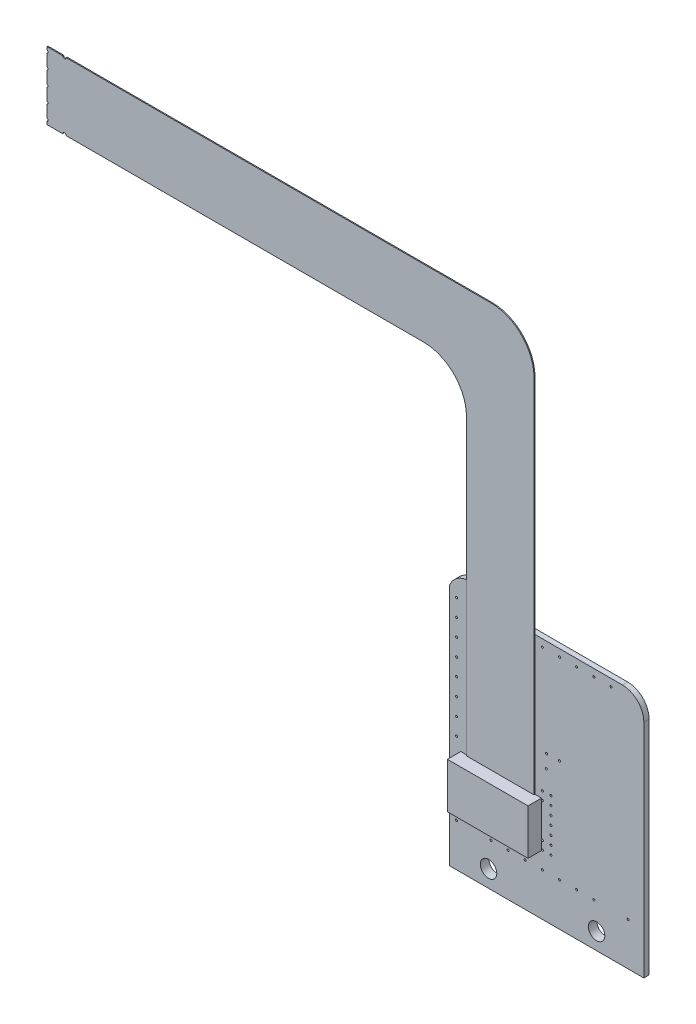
ISO-10303-21;
HEADER;
FILE_DESCRIPTION(('STEP AP214'),'2;1');
FILE_NAME('part.step','',(''),(''),'','','');
FILE_SCHEMA(('AUTOMOTIVE_DESIGN { 1 0 10303 214 1 1 1 1 }'));
ENDSEC;
DATA;
#1=APPLICATION_CONTEXT('core data for automotive mechanical design processes');
#2=APPLICATION_PROTOCOL_DEFINITION('international standard','automotive_design',2000,#1);
#3=PRODUCT_CONTEXT('',#1,'mechanical');
#4=PRODUCT('Part','Part','',(#3));
#5=PRODUCT_RELATED_PRODUCT_CATEGORY('part','',(#4));
#6=PRODUCT_DEFINITION_FORMATION('','',#4);
#7=PRODUCT_DEFINITION_CONTEXT('part definition',#1,'design');
#8=PRODUCT_DEFINITION('design','',#6,#7);
#9=PRODUCT_DEFINITION_SHAPE('','',#8);
#10=(LENGTH_UNIT() NAMED_UNIT(*) SI_UNIT(.MILLI.,.METRE.));
#11=(NAMED_UNIT(*) PLANE_ANGLE_UNIT() SI_UNIT($,.RADIAN.));
#12=(NAMED_UNIT(*) SI_UNIT($,.STERADIAN.) SOLID_ANGLE_UNIT());
#13=UNCERTAINTY_MEASURE_WITH_UNIT(LENGTH_MEASURE(1.E-05),#10,'distance_accuracy_value','');
#14=(GEOMETRIC_REPRESENTATION_CONTEXT(3) GLOBAL_UNCERTAINTY_ASSIGNED_CONTEXT((#13)) GLOBAL_UNIT_ASSIGNED_CONTEXT((#10,
#11,#12)) REPRESENTATION_CONTEXT('',''));
#15=CARTESIAN_POINT('',(0.,0.,0.));
#16=DIRECTION('',(0.,0.,1.));
#17=DIRECTION('',(1.,0.,0.));
#18=AXIS2_PLACEMENT_3D('',#15,#16,#17);
#19=CARTESIAN_POINT('',(12.62376952,9.8298,0.7747));
#20=DIRECTION('',(-1.,0.,0.));
#21=DIRECTION('',(0.,0.,-1.));
#22=AXIS2_PLACEMENT_3D('',#19,#20,#21);
#23=PLANE('',#22);
#24=DIRECTION('',(0.,0.,1.));
#25=VECTOR('',#24,1.);
#26=CARTESIAN_POINT('',(12.62376952,12.174270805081,0.7747));
#27=LINE('',#26,#25);
#28=CARTESIAN_POINT('',(12.62376952,12.174270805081,0.91948));
#29=VERTEX_POINT('',#28);
#30=CARTESIAN_POINT('',(12.62376952,12.174270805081,0.7747));
#31=VERTEX_POINT('',#30);
#32=EDGE_CURVE('P0_E462',#29,#31,#27,.F.);
#33=ORIENTED_EDGE('',*,*,#32,.F.);
#34=DIRECTION('',(0.,-1.,0.));
#35=VECTOR('',#34,1.);
#36=CARTESIAN_POINT('',(12.62376952,9.8298,0.91948));
#37=LINE('',#36,#35);
#38=CARTESIAN_POINT('',(12.62376952,9.8298,0.91948));
#39=VERTEX_POINT('',#38);
#40=EDGE_CURVE('P0_E346',#29,#39,#37,.T.);
#41=ORIENTED_EDGE('',*,*,#40,.T.);
#42=DIRECTION('',(0.,0.,1.));
#43=VECTOR('',#42,1.);
#44=CARTESIAN_POINT('',(12.62376952,9.8298,0.7747));
#45=LINE('',#44,#43);
#46=CARTESIAN_POINT('',(12.62376952,9.8298,0.7747));
#47=VERTEX_POINT('',#46);
#48=EDGE_CURVE('P0_E393',#47,#39,#45,.T.);
#49=ORIENTED_EDGE('',*,*,#48,.F.);
#50=DIRECTION('',(0.,-1.,0.));
#51=VECTOR('',#50,1.);
#52=CARTESIAN_POINT('',(12.62376952,9.8298,0.7747));
#53=LINE('',#52,#51);
#54=EDGE_CURVE('P0_E487',#31,#47,#53,.T.);
#55=ORIENTED_EDGE('',*,*,#54,.F.);
#56=EDGE_LOOP('',(#33,#41,#49,#55));
#57=FACE_BOUND('',#56,.T.);
#58=ADVANCED_FACE('P0_F55',(#57),#23,.F.);
#59=DIRECTION('',(0.,0.,1.));
#60=VECTOR('',#59,1.);
#61=CARTESIAN_POINT('',(12.62376952,12.682169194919,0.7747));
#62=LINE('',#61,#60);
#63=CARTESIAN_POINT('',(12.62376952,12.682169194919,0.7747));
#64=VERTEX_POINT('',#63);
#65=CARTESIAN_POINT('',(12.62376952,12.682169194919,0.91948));
#66=VERTEX_POINT('',#65);
#67=EDGE_CURVE('P0_E70',#64,#66,#62,.T.);
#68=ORIENTED_EDGE('',*,*,#67,.F.);
#69=CARTESIAN_POINT('',(12.62376952,69.0626,0.7747));
#70=VERTEX_POINT('',#69);
#71=EDGE_CURVE('P0_E316',#70,#64,#53,.T.);
#72=ORIENTED_EDGE('',*,*,#71,.F.);
#73=DIRECTION('',(0.,0.,1.));
#74=VECTOR('',#73,1.);
#75=CARTESIAN_POINT('',(12.62376952,69.0626,0.7747));
#76=LINE('',#75,#74);
#77=CARTESIAN_POINT('',(12.62376952,69.0626,0.91948));
#78=VERTEX_POINT('',#77);
#79=EDGE_CURVE('P0_E396',#70,#78,#76,.T.);
#80=ORIENTED_EDGE('',*,*,#79,.T.);
#81=EDGE_CURVE('P0_E348',#78,#66,#37,.T.);
#82=ORIENTED_EDGE('',*,*,#81,.T.);
#83=EDGE_LOOP('',(#68,#72,#80,#82));
#84=FACE_BOUND('',#83,.T.);
#85=ADVANCED_FACE('P0_F496',(#84),#23,.F.);
#86=CARTESIAN_POINT('',(2.61616952,9.8298,0.7747));
#87=DIRECTION('',(0.,1.,0.));
#88=DIRECTION('',(0.,0.,-1.));
#89=AXIS2_PLACEMENT_3D('',#86,#87,#88);
#90=PLANE('',#89);
#91=DIRECTION('',(0.,0.,1.));
#92=VECTOR('',#91,1.);
#93=CARTESIAN_POINT('',(9.61386952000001,9.8298,0.7747));
#94=LINE('',#93,#92);
#95=CARTESIAN_POINT('',(9.61386952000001,9.8298,0.91948));
#96=VERTEX_POINT('',#95);
#97=CARTESIAN_POINT('',(9.61386952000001,9.8298,0.7747));
#98=VERTEX_POINT('',#97);
#99=EDGE_CURVE('P0_E482',#96,#98,#94,.F.);
#100=ORIENTED_EDGE('',*,*,#99,.F.);
#101=DIRECTION('',(-1.,0.,0.));
#102=VECTOR('',#101,1.);
#103=CARTESIAN_POINT('',(2.61616952,9.8298,0.91948));
#104=LINE('',#103,#102);
#105=CARTESIAN_POINT('',(7.80792952,9.8298,0.91948));
#106=VERTEX_POINT('',#105);
#107=EDGE_CURVE('P0_E530',#96,#106,#104,.T.);
#108=ORIENTED_EDGE('',*,*,#107,.T.);
#109=DIRECTION('',(0.,0.,1.));
#110=VECTOR('',#109,1.);
#111=CARTESIAN_POINT('',(7.80792952,9.8298,0.7747));
#112=LINE('',#111,#110);
#113=CARTESIAN_POINT('',(7.80792952,9.8298,0.7747));
#114=VERTEX_POINT('',#113);
#115=EDGE_CURVE('P0_E473',#114,#106,#112,.T.);
#116=ORIENTED_EDGE('',*,*,#115,.F.);
#117=DIRECTION('',(-1.,0.,0.));
#118=VECTOR('',#117,1.);
#119=CARTESIAN_POINT('',(2.61616952,9.8298,0.7747));
#120=LINE('',#119,#118);
#121=EDGE_CURVE('P0_E315',#98,#114,#120,.T.);
#122=ORIENTED_EDGE('',*,*,#121,.F.);
#123=EDGE_LOOP('',(#100,#108,#116,#122));
#124=FACE_BOUND('',#123,.T.);
#125=ADVANCED_FACE('P0_F527',(#124),#90,.F.);
#126=DIRECTION('',(0.,0.,1.));
#127=VECTOR('',#126,1.);
#128=CARTESIAN_POINT('',(9.99486952,9.8298,0.7747));
#129=LINE('',#128,#127);
#130=CARTESIAN_POINT('',(9.99486952,9.8298,0.7747));
#131=VERTEX_POINT('',#130);
#132=CARTESIAN_POINT('',(9.99486952,9.8298,0.91948));
#133=VERTEX_POINT('',#132);
#134=EDGE_CURVE('P0_E480',#131,#133,#129,.T.);
#135=ORIENTED_EDGE('',*,*,#134,.F.);
#136=CARTESIAN_POINT('',(11.80080952,9.8298,0.7747));
#137=VERTEX_POINT('',#136);
#138=EDGE_CURVE('P0_E322',#137,#131,#120,.T.);
#139=ORIENTED_EDGE('',*,*,#138,.F.);
#140=DIRECTION('',(0.,0.,1.));
#141=VECTOR('',#140,1.);
#142=CARTESIAN_POINT('',(11.80080952,9.8298,0.7747));
#143=LINE('',#142,#141);
#144=CARTESIAN_POINT('',(11.80080952,9.8298,0.91948));
#145=VERTEX_POINT('',#144);
#146=EDGE_CURVE('P0_E471',#145,#137,#143,.F.);
#147=ORIENTED_EDGE('',*,*,#146,.F.);
#148=EDGE_CURVE('P0_E356',#145,#133,#104,.T.);
#149=ORIENTED_EDGE('',*,*,#148,.T.);
#150=EDGE_LOOP('',(#135,#139,#147,#149));
#151=FACE_BOUND('',#150,.T.);
#152=ADVANCED_FACE('P0_F517',(#151),#90,.F.);
#153=DIRECTION('',(0.,0.,1.));
#154=VECTOR('',#153,1.);
#155=CARTESIAN_POINT('',(7.42692952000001,9.8298,0.7747));
#156=LINE('',#155,#154);
#157=CARTESIAN_POINT('',(7.42692952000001,9.8298,0.91948));
#158=VERTEX_POINT('',#157);
#159=CARTESIAN_POINT('',(7.42692952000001,9.8298,0.7747));
#160=VERTEX_POINT('',#159);
#161=EDGE_CURVE('P0_E475',#158,#160,#156,.F.);
#162=ORIENTED_EDGE('',*,*,#161,.F.);
#163=CARTESIAN_POINT('',(5.62098952,9.8298,0.91948));
#164=VERTEX_POINT('',#163);
#165=EDGE_CURVE('P0_E539',#158,#164,#104,.T.);
#166=ORIENTED_EDGE('',*,*,#165,.T.);
#167=DIRECTION('',(0.,0.,1.));
#168=VECTOR('',#167,1.);
#169=CARTESIAN_POINT('',(5.62098952,9.8298,0.7747));
#170=LINE('',#169,#168);
#171=CARTESIAN_POINT('',(5.62098952,9.8298,0.7747));
#172=VERTEX_POINT('',#171);
#173=EDGE_CURVE('P0_E299',#172,#164,#170,.T.);
#174=ORIENTED_EDGE('',*,*,#173,.F.);
#175=EDGE_CURVE('P0_E310',#160,#172,#120,.T.);
#176=ORIENTED_EDGE('',*,*,#175,.F.);
#177=EDGE_LOOP('',(#162,#166,#174,#176));
#178=FACE_BOUND('',#177,.T.);
#179=ADVANCED_FACE('P0_F727',(#178),#90,.F.);
#180=DIRECTION('',(0.,0.,1.));
#181=VECTOR('',#180,1.);
#182=CARTESIAN_POINT('',(12.18180952,9.8298,0.7747));
#183=LINE('',#182,#181);
#184=CARTESIAN_POINT('',(12.18180952,9.8298,0.7747));
#185=VERTEX_POINT('',#184);
#186=CARTESIAN_POINT('',(12.18180952,9.8298,0.91948));
#187=VERTEX_POINT('',#186);
#188=EDGE_CURVE('P0_E469',#185,#187,#183,.T.);
#189=ORIENTED_EDGE('',*,*,#188,.F.);
#190=EDGE_CURVE('P0_E317',#47,#185,#120,.T.);
#191=ORIENTED_EDGE('',*,*,#190,.F.);
#192=ORIENTED_EDGE('',*,*,#48,.T.);
#193=EDGE_CURVE('P0_E352',#39,#187,#104,.T.);
#194=ORIENTED_EDGE('',*,*,#193,.T.);
#195=EDGE_LOOP('',(#189,#191,#192,#194));
#196=FACE_BOUND('',#195,.T.);
#197=ADVANCED_FACE('P0_F505',(#196),#90,.F.);
#198=DIRECTION('',(0.,0.,1.));
#199=VECTOR('',#198,1.);
#200=CARTESIAN_POINT('',(3.05304952,9.8298,0.7747));
#201=LINE('',#200,#199);
#202=CARTESIAN_POINT('',(3.05304952,9.8298,0.91948));
#203=VERTEX_POINT('',#202);
#204=CARTESIAN_POINT('',(3.05304952,9.8298,0.7747));
#205=VERTEX_POINT('',#204);
#206=EDGE_CURVE('P0_E573',#203,#205,#201,.F.);
#207=ORIENTED_EDGE('',*,*,#206,.F.);
#208=CARTESIAN_POINT('',(2.61616952,9.8298,0.91948));
#209=VERTEX_POINT('',#208);
#210=EDGE_CURVE('P0_E351',#203,#209,#104,.T.);
#211=ORIENTED_EDGE('',*,*,#210,.T.);
#212=DIRECTION('',(0.,0.,1.));
#213=VECTOR('',#212,1.);
#214=CARTESIAN_POINT('',(2.61616952,9.8298,0.7747));
#215=LINE('',#214,#213);
#216=CARTESIAN_POINT('',(2.61616952,9.8298,0.7747));
#217=VERTEX_POINT('',#216);
#218=EDGE_CURVE('P0_E390',#217,#209,#215,.T.);
#219=ORIENTED_EDGE('',*,*,#218,.F.);
#220=EDGE_CURVE('P0_E313',#205,#217,#120,.T.);
#221=ORIENTED_EDGE('',*,*,#220,.F.);
#222=EDGE_LOOP('',(#207,#211,#219,#221));
#223=FACE_BOUND('',#222,.T.);
#224=ADVANCED_FACE('P0_F724',(#223),#90,.F.);
#225=DIRECTION('',(0.,0.,1.));
#226=VECTOR('',#225,1.);
#227=CARTESIAN_POINT('',(3.43404952,9.8298,0.7747));
#228=LINE('',#227,#226);
#229=CARTESIAN_POINT('',(3.43404952,9.8298,0.7747));
#230=VERTEX_POINT('',#229);
#231=CARTESIAN_POINT('',(3.43404952,9.8298,0.91948));
#232=VERTEX_POINT('',#231);
#233=EDGE_CURVE('P0_E78',#230,#232,#228,.T.);
#234=ORIENTED_EDGE('',*,*,#233,.F.);
#235=CARTESIAN_POINT('',(5.23998952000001,9.8298,0.7747));
#236=VERTEX_POINT('',#235);
#237=EDGE_CURVE('P0_E307',#236,#230,#120,.T.);
#238=ORIENTED_EDGE('',*,*,#237,.F.);
#239=DIRECTION('',(0.,0.,1.));
#240=VECTOR('',#239,1.);
#241=CARTESIAN_POINT('',(5.23998952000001,9.8298,0.7747));
#242=LINE('',#241,#240);
#243=CARTESIAN_POINT('',(5.23998952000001,9.8298,0.91948));
#244=VERTEX_POINT('',#243);
#245=EDGE_CURVE('P0_E287',#244,#236,#242,.F.);
#246=ORIENTED_EDGE('',*,*,#245,.F.);
#247=EDGE_CURVE('P0_E725',#244,#232,#104,.T.);
#248=ORIENTED_EDGE('',*,*,#247,.T.);
#249=EDGE_LOOP('',(#234,#238,#246,#248));
#250=FACE_BOUND('',#249,.T.);
#251=ADVANCED_FACE('P0_F312',(#250),#90,.F.);
#252=CARTESIAN_POINT('',(2.61616952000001,59.055,0.7747));
#253=DIRECTION('',(1.,0.,0.));
#254=DIRECTION('',(0.,0.,1.));
#255=AXIS2_PLACEMENT_3D('',#252,#253,#254);
#256=PLANE('',#255);
#257=DIRECTION('',(0.,0.,1.));
#258=VECTOR('',#257,1.);
#259=CARTESIAN_POINT('',(2.61616952,12.68222,0.7747));
#260=LINE('',#259,#258);
#261=CARTESIAN_POINT('',(2.61616952,12.68222,0.91948));
#262=VERTEX_POINT('',#261);
#263=CARTESIAN_POINT('',(2.61616952,12.68222,0.7747));
#264=VERTEX_POINT('',#263);
#265=EDGE_CURVE('P0_E570',#262,#264,#260,.F.);
#266=ORIENTED_EDGE('',*,*,#265,.F.);
#267=DIRECTION('',(0.,1.,0.));
#268=VECTOR('',#267,1.);
#269=CARTESIAN_POINT('',(2.61616952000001,59.055,0.91948));
#270=LINE('',#269,#268);
#271=CARTESIAN_POINT('',(2.61616952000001,59.055,0.91948));
#272=VERTEX_POINT('',#271);
#273=EDGE_CURVE('P0_E355',#262,#272,#270,.T.);
#274=ORIENTED_EDGE('',*,*,#273,.T.);
#275=DIRECTION('',(0.,0.,1.));
#276=VECTOR('',#275,1.);
#277=CARTESIAN_POINT('',(2.61616952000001,59.055,0.7747));
#278=LINE('',#277,#276);
#279=CARTESIAN_POINT('',(2.61616952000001,59.055,0.7747));
#280=VERTEX_POINT('',#279);
#281=EDGE_CURVE('P0_E387',#280,#272,#278,.T.);
#282=ORIENTED_EDGE('',*,*,#281,.F.);
#283=DIRECTION('',(0.,1.,0.));
#284=VECTOR('',#283,1.);
#285=CARTESIAN_POINT('',(2.61616952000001,59.055,0.7747));
#286=LINE('',#285,#284);
#287=EDGE_CURVE('P0_E321',#264,#280,#286,.T.);
#288=ORIENTED_EDGE('',*,*,#287,.F.);
#289=EDGE_LOOP('',(#266,#274,#282,#288));
#290=FACE_BOUND('',#289,.T.);
#291=ADVANCED_FACE('P0_F657',(#290),#256,.F.);
#292=DIRECTION('',(0.,0.,1.));
#293=VECTOR('',#292,1.);
#294=CARTESIAN_POINT('',(2.61616952,12.17422,0.7747));
#295=LINE('',#294,#293);
#296=CARTESIAN_POINT('',(2.61616952,12.17422,0.7747));
#297=VERTEX_POINT('',#296);
#298=CARTESIAN_POINT('',(2.61616952,12.17422,0.91948));
#299=VERTEX_POINT('',#298);
#300=EDGE_CURVE('P0_E568',#297,#299,#295,.T.);
#301=ORIENTED_EDGE('',*,*,#300,.F.);
#302=EDGE_CURVE('P0_E324',#217,#297,#286,.T.);
#303=ORIENTED_EDGE('',*,*,#302,.F.);
#304=ORIENTED_EDGE('',*,*,#218,.T.);
#305=EDGE_CURVE('P0_E357',#209,#299,#270,.T.);
#306=ORIENTED_EDGE('',*,*,#305,.T.);
#307=EDGE_LOOP('',(#301,#303,#304,#306));
#308=FACE_BOUND('',#307,.T.);
#309=ADVANCED_FACE('P0_F660',(#308),#256,.F.);
#310=CARTESIAN_POINT('',(-59.51477048,65.405,0.7747));
#311=DIRECTION('',(0.,1.,0.));
#312=DIRECTION('',(0.,0.,-1.));
#313=AXIS2_PLACEMENT_3D('',#310,#311,#312);
#314=PLANE('',#313);
#315=DIRECTION('',(0.,0.,1.));
#316=VECTOR('',#315,1.);
#317=CARTESIAN_POINT('',(-57.170299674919,65.405,0.7747));
#318=LINE('',#317,#316);
#319=CARTESIAN_POINT('',(-57.170299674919,65.405,0.91948));
#320=VERTEX_POINT('',#319);
#321=CARTESIAN_POINT('',(-57.170299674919,65.405,0.7747));
#322=VERTEX_POINT('',#321);
#323=EDGE_CURVE('P0_E566',#320,#322,#318,.F.);
#324=ORIENTED_EDGE('',*,*,#323,.F.);
#325=DIRECTION('',(-1.,0.,0.));
#326=VECTOR('',#325,1.);
#327=CARTESIAN_POINT('',(-59.51477048,65.405,0.91948));
#328=LINE('',#327,#326);
#329=CARTESIAN_POINT('',(-59.51477048,65.405,0.91948));
#330=VERTEX_POINT('',#329);
#331=EDGE_CURVE('P0_E362',#320,#330,#328,.T.);
#332=ORIENTED_EDGE('',*,*,#331,.T.);
#333=DIRECTION('',(0.,0.,1.));
#334=VECTOR('',#333,1.);
#335=CARTESIAN_POINT('',(-59.51477048,65.405,0.7747));
#336=LINE('',#335,#334);
#337=CARTESIAN_POINT('',(-59.51477048,65.405,0.7747));
#338=VERTEX_POINT('',#337);
#339=EDGE_CURVE('P0_E381',#338,#330,#336,.T.);
#340=ORIENTED_EDGE('',*,*,#339,.F.);
#341=DIRECTION('',(-1.,0.,0.));
#342=VECTOR('',#341,1.);
#343=CARTESIAN_POINT('',(-59.51477048,65.405,0.7747));
#344=LINE('',#343,#342);
#345=EDGE_CURVE('P0_E329',#322,#338,#344,.T.);
#346=ORIENTED_EDGE('',*,*,#345,.F.);
#347=EDGE_LOOP('',(#324,#332,#340,#346));
#348=FACE_BOUND('',#347,.T.);
#349=ADVANCED_FACE('P0_F630',(#348),#314,.F.);
#350=DIRECTION('',(0.,0.,1.));
#351=VECTOR('',#350,1.);
#352=CARTESIAN_POINT('',(-56.662401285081,65.405,0.7747));
#353=LINE('',#352,#351);
#354=CARTESIAN_POINT('',(-56.662401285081,65.405,0.7747));
#355=VERTEX_POINT('',#354);
#356=CARTESIAN_POINT('',(-56.662401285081,65.405,0.91948));
#357=VERTEX_POINT('',#356);
#358=EDGE_CURVE('P0_E564',#355,#357,#353,.T.);
#359=ORIENTED_EDGE('',*,*,#358,.F.);
#360=CARTESIAN_POINT('',(-3.73383047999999,65.405,0.7747));
#361=VERTEX_POINT('',#360);
#362=EDGE_CURVE('P0_E330',#361,#355,#344,.T.);
#363=ORIENTED_EDGE('',*,*,#362,.F.);
#364=DIRECTION('',(0.,0.,1.));
#365=VECTOR('',#364,1.);
#366=CARTESIAN_POINT('',(-3.73383047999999,65.405,0.7747));
#367=LINE('',#366,#365);
#368=CARTESIAN_POINT('',(-3.73383047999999,65.405,0.91948));
#369=VERTEX_POINT('',#368);
#370=EDGE_CURVE('P0_E384',#361,#369,#367,.T.);
#371=ORIENTED_EDGE('',*,*,#370,.T.);
#372=EDGE_CURVE('P0_E363',#369,#357,#328,.T.);
#373=ORIENTED_EDGE('',*,*,#372,.T.);
#374=EDGE_LOOP('',(#359,#363,#371,#373));
#375=FACE_BOUND('',#374,.T.);
#376=ADVANCED_FACE('P0_F668',(#375),#314,.F.);
#377=CARTESIAN_POINT('',(-59.51477048,75.4126,0.7747));
#378=DIRECTION('',(1.,0.,0.));
#379=DIRECTION('',(0.,0.,1.));
#380=AXIS2_PLACEMENT_3D('',#377,#378,#379);
#381=PLANE('',#380);
#382=DIRECTION('',(0.,0.,1.));
#383=VECTOR('',#382,1.);
#384=CARTESIAN_POINT('',(-59.51477048,74.97572,0.7747));
#385=LINE('',#384,#383);
#386=CARTESIAN_POINT('',(-59.51477048,74.97572,0.91948));
#387=VERTEX_POINT('',#386);
#388=CARTESIAN_POINT('',(-59.51477048,74.97572,0.7747));
#389=VERTEX_POINT('',#388);
#390=EDGE_CURVE('P0_E347',#387,#389,#385,.F.);
#391=ORIENTED_EDGE('',*,*,#390,.F.);
#392=DIRECTION('',(0.,1.,0.));
#393=VECTOR('',#392,1.);
#394=CARTESIAN_POINT('',(-59.51477048,75.4126,0.91948));
#395=LINE('',#394,#393);
#396=CARTESIAN_POINT('',(-59.51477048,75.4126,0.91948));
#397=VERTEX_POINT('',#396);
#398=EDGE_CURVE('P0_E366',#387,#397,#395,.T.);
#399=ORIENTED_EDGE('',*,*,#398,.T.);
#400=DIRECTION('',(0.,0.,1.));
#401=VECTOR('',#400,1.);
#402=CARTESIAN_POINT('',(-59.51477048,75.4126,0.7747));
#403=LINE('',#402,#401);
#404=CARTESIAN_POINT('',(-59.51477048,75.4126,0.7747));
#405=VERTEX_POINT('',#404);
#406=EDGE_CURVE('P0_E378',#405,#397,#403,.T.);
#407=ORIENTED_EDGE('',*,*,#406,.F.);
#408=DIRECTION('',(0.,1.,0.));
#409=VECTOR('',#408,1.);
#410=CARTESIAN_POINT('',(-59.51477048,75.4126,0.7747));
#411=LINE('',#410,#409);
#412=EDGE_CURVE('P0_E333',#389,#405,#411,.T.);
#413=ORIENTED_EDGE('',*,*,#412,.F.);
#414=EDGE_LOOP('',(#391,#399,#407,#413));
#415=FACE_BOUND('',#414,.T.);
#416=ADVANCED_FACE('P0_F442',(#415),#381,.F.);
#417=DIRECTION('',(0.,0.,1.));
#418=VECTOR('',#417,1.);
#419=CARTESIAN_POINT('',(-59.51477048,74.59472,0.7747));
#420=LINE('',#419,#418);
#421=CARTESIAN_POINT('',(-59.51477048,74.59472,0.7747));
#422=VERTEX_POINT('',#421);
#423=CARTESIAN_POINT('',(-59.51477048,74.59472,0.91948));
#424=VERTEX_POINT('',#423);
#425=EDGE_CURVE('P0_E484',#422,#424,#420,.T.);
#426=ORIENTED_EDGE('',*,*,#425,.F.);
#427=CARTESIAN_POINT('',(-59.51477048,72.78878,0.7747));
#428=VERTEX_POINT('',#427);
#429=EDGE_CURVE('P0_E597',#428,#422,#411,.T.);
#430=ORIENTED_EDGE('',*,*,#429,.F.);
#431=DIRECTION('',(0.,0.,1.));
#432=VECTOR('',#431,1.);
#433=CARTESIAN_POINT('',(-59.51477048,72.78878,0.7747));
#434=LINE('',#433,#432);
#435=CARTESIAN_POINT('',(-59.51477048,72.78878,0.91948));
#436=VERTEX_POINT('',#435);
#437=EDGE_CURVE('P0_E478',#436,#428,#434,.F.);
#438=ORIENTED_EDGE('',*,*,#437,.F.);
#439=EDGE_CURVE('P0_E424',#436,#424,#395,.T.);
#440=ORIENTED_EDGE('',*,*,#439,.T.);
#441=EDGE_LOOP('',(#426,#430,#438,#440));
#442=FACE_BOUND('',#441,.T.);
#443=ADVANCED_FACE('P0_F603',(#442),#381,.F.);
#444=DIRECTION('',(0.,0.,1.));
#445=VECTOR('',#444,1.);
#446=CARTESIAN_POINT('',(-59.51477048,72.40778,0.7747));
#447=LINE('',#446,#445);
#448=CARTESIAN_POINT('',(-59.51477048,72.40778,0.7747));
#449=VERTEX_POINT('',#448);
#450=CARTESIAN_POINT('',(-59.51477048,72.40778,0.91948));
#451=VERTEX_POINT('',#450);
#452=EDGE_CURVE('P0_E432',#449,#451,#447,.T.);
#453=ORIENTED_EDGE('',*,*,#452,.F.);
#454=CARTESIAN_POINT('',(-59.51477048,70.60184,0.7747));
#455=VERTEX_POINT('',#454);
#456=EDGE_CURVE('P0_E596',#455,#449,#411,.T.);
#457=ORIENTED_EDGE('',*,*,#456,.F.);
#458=DIRECTION('',(0.,0.,1.));
#459=VECTOR('',#458,1.);
#460=CARTESIAN_POINT('',(-59.51477048,70.60184,0.7747));
#461=LINE('',#460,#459);
#462=CARTESIAN_POINT('',(-59.51477048,70.60184,0.91948));
#463=VERTEX_POINT('',#462);
#464=EDGE_CURVE('P0_E434',#463,#455,#461,.F.);
#465=ORIENTED_EDGE('',*,*,#464,.F.);
#466=EDGE_CURVE('P0_E422',#463,#451,#395,.T.);
#467=ORIENTED_EDGE('',*,*,#466,.T.);
#468=EDGE_LOOP('',(#453,#457,#465,#467));
#469=FACE_BOUND('',#468,.T.);
#470=ADVANCED_FACE('P0_F430',(#469),#381,.F.);
#471=DIRECTION('',(0.,0.,1.));
#472=VECTOR('',#471,1.);
#473=CARTESIAN_POINT('',(-59.51477048,68.4149,0.7747));
#474=LINE('',#473,#472);
#475=CARTESIAN_POINT('',(-59.51477048,68.4149,0.91948));
#476=VERTEX_POINT('',#475);
#477=CARTESIAN_POINT('',(-59.51477048,68.4149,0.7747));
#478=VERTEX_POINT('',#477);
#479=EDGE_CURVE('P0_E464',#476,#478,#474,.F.);
#480=ORIENTED_EDGE('',*,*,#479,.F.);
#481=CARTESIAN_POINT('',(-59.51477048,70.22084,0.91948));
#482=VERTEX_POINT('',#481);
#483=EDGE_CURVE('P0_E435',#476,#482,#395,.T.);
#484=ORIENTED_EDGE('',*,*,#483,.T.);
#485=DIRECTION('',(0.,0.,1.));
#486=VECTOR('',#485,1.);
#487=CARTESIAN_POINT('',(-59.51477048,70.22084,0.7747));
#488=LINE('',#487,#486);
#489=CARTESIAN_POINT('',(-59.51477048,70.22084,0.7747));
#490=VERTEX_POINT('',#489);
#491=EDGE_CURVE('P0_E298',#490,#482,#488,.T.);
#492=ORIENTED_EDGE('',*,*,#491,.F.);
#493=EDGE_CURVE('P0_E591',#478,#490,#411,.T.);
#494=ORIENTED_EDGE('',*,*,#493,.F.);
#495=EDGE_LOOP('',(#480,#484,#492,#494));
#496=FACE_BOUND('',#495,.T.);
#497=ADVANCED_FACE('P0_F595',(#496),#381,.F.);
#498=DIRECTION('',(0.,0.,1.));
#499=VECTOR('',#498,1.);
#500=CARTESIAN_POINT('',(-59.51477048,68.0339,0.7747));
#501=LINE('',#500,#499);
#502=CARTESIAN_POINT('',(-59.51477048,68.0339,0.7747));
#503=VERTEX_POINT('',#502);
#504=CARTESIAN_POINT('',(-59.51477048,68.0339,0.91948));
#505=VERTEX_POINT('',#504);
#506=EDGE_CURVE('P0_E579',#503,#505,#501,.T.);
#507=ORIENTED_EDGE('',*,*,#506,.F.);
#508=CARTESIAN_POINT('',(-59.51477048,66.22796,0.7747));
#509=VERTEX_POINT('',#508);
#510=EDGE_CURVE('P0_E338',#509,#503,#411,.T.);
#511=ORIENTED_EDGE('',*,*,#510,.F.);
#512=DIRECTION('',(0.,0.,1.));
#513=VECTOR('',#512,1.);
#514=CARTESIAN_POINT('',(-59.51477048,66.22796,0.7747));
#515=LINE('',#514,#513);
#516=CARTESIAN_POINT('',(-59.51477048,66.22796,0.91948));
#517=VERTEX_POINT('',#516);
#518=EDGE_CURVE('P0_E577',#517,#509,#515,.F.);
#519=ORIENTED_EDGE('',*,*,#518,.F.);
#520=EDGE_CURVE('P0_E371',#517,#505,#395,.T.);
#521=ORIENTED_EDGE('',*,*,#520,.T.);
#522=EDGE_LOOP('',(#507,#511,#519,#521));
#523=FACE_BOUND('',#522,.T.);
#524=ADVANCED_FACE('P0_F635',(#523),#381,.F.);
#525=DIRECTION('',(0.,0.,1.));
#526=VECTOR('',#525,1.);
#527=CARTESIAN_POINT('',(-59.51477048,65.84696,0.7747));
#528=LINE('',#527,#526);
#529=CARTESIAN_POINT('',(-59.51477048,65.84696,0.7747));
#530=VERTEX_POINT('',#529);
#531=CARTESIAN_POINT('',(-59.51477048,65.84696,0.91948));
#532=VERTEX_POINT('',#531);
#533=EDGE_CURVE('P0_E575',#530,#532,#528,.T.);
#534=ORIENTED_EDGE('',*,*,#533,.F.);
#535=EDGE_CURVE('P0_E334',#338,#530,#411,.T.);
#536=ORIENTED_EDGE('',*,*,#535,.F.);
#537=ORIENTED_EDGE('',*,*,#339,.T.);
#538=EDGE_CURVE('P0_E367',#330,#532,#395,.T.);
#539=ORIENTED_EDGE('',*,*,#538,.T.);
#540=EDGE_LOOP('',(#534,#536,#537,#539));
#541=FACE_BOUND('',#540,.T.);
#542=ADVANCED_FACE('P0_F623',(#541),#381,.F.);
#543=CARTESIAN_POINT('',(6.27376952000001,75.4126,0.7747));
#544=DIRECTION('',(0.,-1.,0.));
#545=DIRECTION('',(0.,0.,1.));
#546=AXIS2_PLACEMENT_3D('',#543,#544,#545);
#547=PLANE('',#546);
#548=DIRECTION('',(0.,0.,1.));
#549=VECTOR('',#548,1.);
#550=CARTESIAN_POINT('',(-56.66235048,75.4126,0.7747));
#551=LINE('',#550,#549);
#552=CARTESIAN_POINT('',(-56.66235048,75.4126,0.91948));
#553=VERTEX_POINT('',#552);
#554=CARTESIAN_POINT('',(-56.66235048,75.4126,0.7747));
#555=VERTEX_POINT('',#554);
#556=EDGE_CURVE('P0_E454',#553,#555,#551,.F.);
#557=ORIENTED_EDGE('',*,*,#556,.F.);
#558=DIRECTION('',(1.,0.,0.));
#559=VECTOR('',#558,1.);
#560=CARTESIAN_POINT('',(6.27376952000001,75.4126,0.91948));
#561=LINE('',#560,#559);
#562=CARTESIAN_POINT('',(6.27376952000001,75.4126,0.91948));
#563=VERTEX_POINT('',#562);
#564=EDGE_CURVE('P0_E370',#553,#563,#561,.T.);
#565=ORIENTED_EDGE('',*,*,#564,.T.);
#566=DIRECTION('',(0.,0.,1.));
#567=VECTOR('',#566,1.);
#568=CARTESIAN_POINT('',(6.27376952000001,75.4126,0.7747));
#569=LINE('',#568,#567);
#570=CARTESIAN_POINT('',(6.27376952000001,75.4126,0.7747));
#571=VERTEX_POINT('',#570);
#572=EDGE_CURVE('P0_E342',#571,#563,#569,.T.);
#573=ORIENTED_EDGE('',*,*,#572,.F.);
#574=DIRECTION('',(1.,0.,0.));
#575=VECTOR('',#574,1.);
#576=CARTESIAN_POINT('',(6.27376952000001,75.4126,0.7747));
#577=LINE('',#576,#575);
#578=EDGE_CURVE('P0_E337',#555,#571,#577,.T.);
#579=ORIENTED_EDGE('',*,*,#578,.F.);
#580=EDGE_LOOP('',(#557,#565,#573,#579));
#581=FACE_BOUND('',#580,.T.);
#582=ADVANCED_FACE('P0_F459',(#581),#547,.F.);
#583=DIRECTION('',(0.,0.,1.));
#584=VECTOR('',#583,1.);
#585=CARTESIAN_POINT('',(-57.17035048,75.4126,0.7747));
#586=LINE('',#585,#584);
#587=CARTESIAN_POINT('',(-57.17035048,75.4126,0.7747));
#588=VERTEX_POINT('',#587);
#589=CARTESIAN_POINT('',(-57.17035048,75.4126,0.91948));
#590=VERTEX_POINT('',#589);
#591=EDGE_CURVE('P0_E456',#588,#590,#586,.T.);
#592=ORIENTED_EDGE('',*,*,#591,.F.);
#593=EDGE_CURVE('P0_E339',#405,#588,#577,.T.);
#594=ORIENTED_EDGE('',*,*,#593,.F.);
#595=ORIENTED_EDGE('',*,*,#406,.T.);
#596=EDGE_CURVE('P0_E372',#397,#590,#561,.T.);
#597=ORIENTED_EDGE('',*,*,#596,.T.);
#598=EDGE_LOOP('',(#592,#594,#595,#597));
#599=FACE_BOUND('',#598,.T.);
#600=ADVANCED_FACE('P0_F448',(#599),#547,.F.);
#601=CARTESIAN_POINT('',(6.27376952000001,69.0626,0.7747));
#602=DIRECTION('',(0.,0.,1.));
#603=DIRECTION('',(0.,1.,0.));
#604=AXIS2_PLACEMENT_3D('',#601,#602,#603);
#605=CYLINDRICAL_SURFACE('',#604,6.35);
#606=CARTESIAN_POINT('',(6.27376952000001,69.0626,0.91948));
#607=DIRECTION('',(0.,0.,-1.));
#608=DIRECTION('',(0.,1.,0.));
#609=AXIS2_PLACEMENT_3D('',#606,#607,#608);
#610=CIRCLE('',#609,6.35);
#611=EDGE_CURVE('P0_E343',#563,#78,#610,.T.);
#612=ORIENTED_EDGE('',*,*,#611,.T.);
#613=ORIENTED_EDGE('',*,*,#79,.F.);
#614=CARTESIAN_POINT('',(6.27376952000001,69.0626,0.7747));
#615=DIRECTION('',(0.,0.,-1.));
#616=DIRECTION('',(0.,1.,0.));
#617=AXIS2_PLACEMENT_3D('',#614,#615,#616);
#618=CIRCLE('',#617,6.35);
#619=EDGE_CURVE('P0_E375',#571,#70,#618,.T.);
#620=ORIENTED_EDGE('',*,*,#619,.F.);
#621=ORIENTED_EDGE('',*,*,#572,.T.);
#622=EDGE_LOOP('',(#612,#613,#620,#621));
#623=FACE_BOUND('',#622,.T.);
#624=ADVANCED_FACE('P0_F57',(#623),#605,.T.);
#625=CARTESIAN_POINT('',(-3.73383047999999,59.055,0.7747));
#626=DIRECTION('',(0.,0.,1.));
#627=DIRECTION('',(0.,1.,0.));
#628=AXIS2_PLACEMENT_3D('',#625,#626,#627);
#629=CYLINDRICAL_SURFACE('',#628,6.35);
#630=CARTESIAN_POINT('',(-3.73383047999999,59.055,0.91948));
#631=DIRECTION('',(0.,0.,1.));
#632=DIRECTION('',(0.,-1.,0.));
#633=AXIS2_PLACEMENT_3D('',#630,#631,#632);
#634=CIRCLE('',#633,6.35);
#635=EDGE_CURVE('P0_E360',#272,#369,#634,.T.);
#636=ORIENTED_EDGE('',*,*,#635,.T.);
#637=ORIENTED_EDGE('',*,*,#370,.F.);
#638=CARTESIAN_POINT('',(-3.73383047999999,59.055,0.7747));
#639=DIRECTION('',(0.,0.,1.));
#640=DIRECTION('',(0.,-1.,0.));
#641=AXIS2_PLACEMENT_3D('',#638,#639,#640);
#642=CIRCLE('',#641,6.35);
#643=EDGE_CURVE('P0_E327',#280,#361,#642,.T.);
#644=ORIENTED_EDGE('',*,*,#643,.F.);
#645=ORIENTED_EDGE('',*,*,#281,.T.);
#646=EDGE_LOOP('',(#636,#637,#644,#645));
#647=FACE_BOUND('',#646,.T.);
#648=ADVANCED_FACE('P0_F662',(#647),#629,.F.);
#649=CARTESIAN_POINT('',(6.27376952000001,69.0626,0.7747));
#650=DIRECTION('',(0.,0.,1.));
#651=DIRECTION('',(0.,1.,0.));
#652=AXIS2_PLACEMENT_3D('',#649,#650,#651);
#653=PLANE('',#652);
#654=CARTESIAN_POINT('',(-59.51477048,74.78522,0.7747));
#655=DIRECTION('',(0.,0.,-1.));
#656=DIRECTION('',(0.,-1.,0.));
#657=AXIS2_PLACEMENT_3D('',#654,#655,#656);
#658=CIRCLE('',#657,0.1905);
#659=EDGE_CURVE('P0_E548',#389,#422,#658,.T.);
#660=ORIENTED_EDGE('',*,*,#659,.F.);
#661=ORIENTED_EDGE('',*,*,#412,.T.);
#662=ORIENTED_EDGE('',*,*,#593,.T.);
#663=CARTESIAN_POINT('',(-56.91635048,75.4126,0.7747));
#664=DIRECTION('',(0.,0.,-1.));
#665=DIRECTION('',(0.,-1.,0.));
#666=AXIS2_PLACEMENT_3D('',#663,#664,#665);
#667=CIRCLE('',#666,0.254);
#668=EDGE_CURVE('P0_E555',#555,#588,#667,.T.);
#669=ORIENTED_EDGE('',*,*,#668,.F.);
#670=ORIENTED_EDGE('',*,*,#578,.T.);
#671=ORIENTED_EDGE('',*,*,#619,.T.);
#672=ORIENTED_EDGE('',*,*,#71,.T.);
#673=CARTESIAN_POINT('',(12.61868952,12.42822,0.7747));
#674=DIRECTION('',(0.,0.,-1.));
#675=DIRECTION('',(0.,-1.,0.));
#676=AXIS2_PLACEMENT_3D('',#673,#674,#675);
#677=CIRCLE('',#676,0.254000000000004);
#678=EDGE_CURVE('P0_E494',#31,#64,#677,.T.);
#679=ORIENTED_EDGE('',*,*,#678,.F.);
#680=ORIENTED_EDGE('',*,*,#54,.T.);
#681=ORIENTED_EDGE('',*,*,#190,.T.);
#682=CARTESIAN_POINT('',(11.99130952,9.8298,0.7747));
#683=DIRECTION('',(0.,0.,-1.));
#684=DIRECTION('',(0.,-1.,0.));
#685=AXIS2_PLACEMENT_3D('',#682,#683,#684);
#686=CIRCLE('',#685,0.190499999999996);
#687=EDGE_CURVE('P0_E508',#137,#185,#686,.T.);
#688=ORIENTED_EDGE('',*,*,#687,.F.);
#689=ORIENTED_EDGE('',*,*,#138,.T.);
#690=CARTESIAN_POINT('',(9.80436952,9.8298,0.7747));
#691=DIRECTION('',(0.,0.,-1.));
#692=DIRECTION('',(0.,-1.,0.));
#693=AXIS2_PLACEMENT_3D('',#690,#691,#692);
#694=CIRCLE('',#693,0.190499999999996);
#695=EDGE_CURVE('P0_E523',#98,#131,#694,.T.);
#696=ORIENTED_EDGE('',*,*,#695,.F.);
#697=ORIENTED_EDGE('',*,*,#121,.T.);
#698=CARTESIAN_POINT('',(7.61742952,9.8298,0.7747));
#699=DIRECTION('',(0.,0.,-1.));
#700=DIRECTION('',(0.,-1.,0.));
#701=AXIS2_PLACEMENT_3D('',#698,#699,#700);
#702=CIRCLE('',#701,0.190499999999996);
#703=EDGE_CURVE('P0_E522',#160,#114,#702,.T.);
#704=ORIENTED_EDGE('',*,*,#703,.F.);
#705=ORIENTED_EDGE('',*,*,#175,.T.);
#706=CARTESIAN_POINT('',(5.43048952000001,9.8298,0.7747));
#707=DIRECTION('',(0.,0.,-1.));
#708=DIRECTION('',(0.,-1.,0.));
#709=AXIS2_PLACEMENT_3D('',#706,#707,#708);
#710=CIRCLE('',#709,0.190499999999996);
#711=EDGE_CURVE('P0_E290',#236,#172,#710,.T.);
#712=ORIENTED_EDGE('',*,*,#711,.F.);
#713=ORIENTED_EDGE('',*,*,#237,.T.);
#714=CARTESIAN_POINT('',(3.24354952,9.8298,0.7747));
#715=DIRECTION('',(0.,0.,-1.));
#716=DIRECTION('',(0.,-1.,0.));
#717=AXIS2_PLACEMENT_3D('',#714,#715,#716);
#718=CIRCLE('',#717,0.190499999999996);
#719=EDGE_CURVE('P0_E608',#205,#230,#718,.T.);
#720=ORIENTED_EDGE('',*,*,#719,.F.);
#721=ORIENTED_EDGE('',*,*,#220,.T.);
#722=ORIENTED_EDGE('',*,*,#302,.T.);
#723=CARTESIAN_POINT('',(2.61616952,12.42822,0.7747));
#724=DIRECTION('',(0.,0.,-1.));
#725=DIRECTION('',(0.,-1.,0.));
#726=AXIS2_PLACEMENT_3D('',#723,#724,#725);
#727=CIRCLE('',#726,0.254000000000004);
#728=EDGE_CURVE('P0_E611',#264,#297,#727,.T.);
#729=ORIENTED_EDGE('',*,*,#728,.F.);
#730=ORIENTED_EDGE('',*,*,#287,.T.);
#731=ORIENTED_EDGE('',*,*,#643,.T.);
#732=ORIENTED_EDGE('',*,*,#362,.T.);
#733=CARTESIAN_POINT('',(-56.91635048,65.41008,0.7747));
#734=DIRECTION('',(0.,0.,-1.));
#735=DIRECTION('',(0.,-1.,0.));
#736=AXIS2_PLACEMENT_3D('',#733,#734,#735);
#737=CIRCLE('',#736,0.254000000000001);
#738=EDGE_CURVE('P0_E544',#322,#355,#737,.T.);
#739=ORIENTED_EDGE('',*,*,#738,.F.);
#740=ORIENTED_EDGE('',*,*,#345,.T.);
#741=ORIENTED_EDGE('',*,*,#535,.T.);
#742=CARTESIAN_POINT('',(-59.51477048,66.03746,0.7747));
#743=DIRECTION('',(0.,0.,-1.));
#744=DIRECTION('',(0.,-1.,0.));
#745=AXIS2_PLACEMENT_3D('',#742,#743,#744);
#746=CIRCLE('',#745,0.1905);
#747=EDGE_CURVE('P0_E609',#509,#530,#746,.T.);
#748=ORIENTED_EDGE('',*,*,#747,.F.);
#749=ORIENTED_EDGE('',*,*,#510,.T.);
#750=CARTESIAN_POINT('',(-59.51477048,68.2244,0.7747));
#751=DIRECTION('',(0.,0.,-1.));
#752=DIRECTION('',(0.,-1.,0.));
#753=AXIS2_PLACEMENT_3D('',#750,#751,#752);
#754=CIRCLE('',#753,0.1905);
#755=EDGE_CURVE('P0_E553',#478,#503,#754,.T.);
#756=ORIENTED_EDGE('',*,*,#755,.F.);
#757=ORIENTED_EDGE('',*,*,#493,.T.);
#758=CARTESIAN_POINT('',(-59.51477048,70.41134,0.7747));
#759=DIRECTION('',(0.,0.,-1.));
#760=DIRECTION('',(0.,-1.,0.));
#761=AXIS2_PLACEMENT_3D('',#758,#759,#760);
#762=CIRCLE('',#761,0.1905);
#763=EDGE_CURVE('P0_E540',#455,#490,#762,.T.);
#764=ORIENTED_EDGE('',*,*,#763,.F.);
#765=ORIENTED_EDGE('',*,*,#456,.T.);
#766=CARTESIAN_POINT('',(-59.51477048,72.59828,0.7747));
#767=DIRECTION('',(0.,0.,-1.));
#768=DIRECTION('',(0.,-1.,0.));
#769=AXIS2_PLACEMENT_3D('',#766,#767,#768);
#770=CIRCLE('',#769,0.1905);
#771=EDGE_CURVE('P0_E542',#428,#449,#770,.T.);
#772=ORIENTED_EDGE('',*,*,#771,.F.);
#773=ORIENTED_EDGE('',*,*,#429,.T.);
#774=EDGE_LOOP('',(#660,#661,#662,#669,#670,#671,#672,#679,#680,#681,#688,#689,#696,#697,#704,
#705,#712,#713,#720,#721,#722,#729,#730,#731,#732,#739,#740,#741,#748,#749,#756,#757,#764,#765,
#772,#773));
#775=FACE_BOUND('',#774,.T.);
#776=ADVANCED_FACE('P0_F305',(#775),#653,.F.);
#777=CARTESIAN_POINT('',(6.27376952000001,69.0626,0.91948));
#778=DIRECTION('',(0.,0.,1.));
#779=DIRECTION('',(0.,1.,0.));
#780=AXIS2_PLACEMENT_3D('',#777,#778,#779);
#781=PLANE('',#780);
#782=ORIENTED_EDGE('',*,*,#398,.F.);
#783=CARTESIAN_POINT('',(-59.51477048,74.78522,0.91948));
#784=DIRECTION('',(0.,0.,1.));
#785=DIRECTION('',(0.,1.,0.));
#786=AXIS2_PLACEMENT_3D('',#783,#784,#785);
#787=CIRCLE('',#786,0.1905);
#788=EDGE_CURVE('P0_E12',#387,#424,#787,.F.);
#789=ORIENTED_EDGE('',*,*,#788,.T.);
#790=ORIENTED_EDGE('',*,*,#439,.F.);
#791=CARTESIAN_POINT('',(-59.51477048,72.59828,0.91948));
#792=DIRECTION('',(0.,0.,1.));
#793=DIRECTION('',(0.,1.,0.));
#794=AXIS2_PLACEMENT_3D('',#791,#792,#793);
#795=CIRCLE('',#794,0.1905);
#796=EDGE_CURVE('P0_E63',#436,#451,#795,.F.);
#797=ORIENTED_EDGE('',*,*,#796,.T.);
#798=ORIENTED_EDGE('',*,*,#466,.F.);
#799=CARTESIAN_POINT('',(-59.51477048,70.41134,0.91948));
#800=DIRECTION('',(0.,0.,1.));
#801=DIRECTION('',(0.,1.,0.));
#802=AXIS2_PLACEMENT_3D('',#799,#800,#801);
#803=CIRCLE('',#802,0.1905);
#804=EDGE_CURVE('P0_E399',#463,#482,#803,.F.);
#805=ORIENTED_EDGE('',*,*,#804,.T.);
#806=ORIENTED_EDGE('',*,*,#483,.F.);
#807=CARTESIAN_POINT('',(-59.51477048,68.2244,0.91948));
#808=DIRECTION('',(0.,0.,1.));
#809=DIRECTION('',(0.,1.,0.));
#810=AXIS2_PLACEMENT_3D('',#807,#808,#809);
#811=CIRCLE('',#810,0.1905);
#812=EDGE_CURVE('P0_E408',#476,#505,#811,.F.);
#813=ORIENTED_EDGE('',*,*,#812,.T.);
#814=ORIENTED_EDGE('',*,*,#520,.F.);
#815=CARTESIAN_POINT('',(-59.51477048,66.03746,0.91948));
#816=DIRECTION('',(0.,0.,1.));
#817=DIRECTION('',(0.,1.,0.));
#818=AXIS2_PLACEMENT_3D('',#815,#816,#817);
#819=CIRCLE('',#818,0.1905);
#820=EDGE_CURVE('P0_E405',#517,#532,#819,.F.);
#821=ORIENTED_EDGE('',*,*,#820,.T.);
#822=ORIENTED_EDGE('',*,*,#538,.F.);
#823=ORIENTED_EDGE('',*,*,#331,.F.);
#824=CARTESIAN_POINT('',(-56.91635048,65.41008,0.91948));
#825=DIRECTION('',(0.,0.,-1.));
#826=DIRECTION('',(0.,-1.,0.));
#827=AXIS2_PLACEMENT_3D('',#824,#825,#826);
#828=CIRCLE('',#827,0.254000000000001);
#829=EDGE_CURVE('P0_E613',#320,#357,#828,.T.);
#830=ORIENTED_EDGE('',*,*,#829,.T.);
#831=ORIENTED_EDGE('',*,*,#372,.F.);
#832=ORIENTED_EDGE('',*,*,#635,.F.);
#833=ORIENTED_EDGE('',*,*,#273,.F.);
#834=CARTESIAN_POINT('',(2.61616952,12.42822,0.91948));
#835=DIRECTION('',(0.,0.,1.));
#836=DIRECTION('',(0.,1.,0.));
#837=AXIS2_PLACEMENT_3D('',#834,#835,#836);
#838=CIRCLE('',#837,0.254000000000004);
#839=EDGE_CURVE('P0_E402',#262,#299,#838,.F.);
#840=ORIENTED_EDGE('',*,*,#839,.T.);
#841=ORIENTED_EDGE('',*,*,#305,.F.);
#842=ORIENTED_EDGE('',*,*,#210,.F.);
#843=CARTESIAN_POINT('',(3.24354952,9.8298,0.91948));
#844=DIRECTION('',(0.,0.,-1.));
#845=DIRECTION('',(0.,-1.,0.));
#846=AXIS2_PLACEMENT_3D('',#843,#844,#845);
#847=CIRCLE('',#846,0.190499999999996);
#848=EDGE_CURVE('P0_E606',#203,#232,#847,.T.);
#849=ORIENTED_EDGE('',*,*,#848,.T.);
#850=ORIENTED_EDGE('',*,*,#247,.F.);
#851=CARTESIAN_POINT('',(5.43048952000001,9.8298,0.91948));
#852=DIRECTION('',(0.,0.,-1.));
#853=DIRECTION('',(0.,-1.,0.));
#854=AXIS2_PLACEMENT_3D('',#851,#852,#853);
#855=CIRCLE('',#854,0.190499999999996);
#856=EDGE_CURVE('P0_E293',#244,#164,#855,.T.);
#857=ORIENTED_EDGE('',*,*,#856,.T.);
#858=ORIENTED_EDGE('',*,*,#165,.F.);
#859=CARTESIAN_POINT('',(7.61742952,9.8298,0.91948));
#860=DIRECTION('',(0.,0.,-1.));
#861=DIRECTION('',(0.,-1.,0.));
#862=AXIS2_PLACEMENT_3D('',#859,#860,#861);
#863=CIRCLE('',#862,0.190499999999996);
#864=EDGE_CURVE('P0_E534',#158,#106,#863,.T.);
#865=ORIENTED_EDGE('',*,*,#864,.T.);
#866=ORIENTED_EDGE('',*,*,#107,.F.);
#867=CARTESIAN_POINT('',(9.80436952,9.8298,0.91948));
#868=DIRECTION('',(0.,0.,-1.));
#869=DIRECTION('',(0.,-1.,0.));
#870=AXIS2_PLACEMENT_3D('',#867,#868,#869);
#871=CIRCLE('',#870,0.190499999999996);
#872=EDGE_CURVE('P0_E551',#96,#133,#871,.T.);
#873=ORIENTED_EDGE('',*,*,#872,.T.);
#874=ORIENTED_EDGE('',*,*,#148,.F.);
#875=CARTESIAN_POINT('',(11.99130952,9.8298,0.91948));
#876=DIRECTION('',(0.,0.,-1.));
#877=DIRECTION('',(0.,-1.,0.));
#878=AXIS2_PLACEMENT_3D('',#875,#876,#877);
#879=CIRCLE('',#878,0.190499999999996);
#880=EDGE_CURVE('P0_E512',#145,#187,#879,.T.);
#881=ORIENTED_EDGE('',*,*,#880,.T.);
#882=ORIENTED_EDGE('',*,*,#193,.F.);
#883=ORIENTED_EDGE('',*,*,#40,.F.);
#884=CARTESIAN_POINT('',(12.61868952,12.42822,0.91948));
#885=DIRECTION('',(0.,0.,1.));
#886=DIRECTION('',(0.,1.,0.));
#887=AXIS2_PLACEMENT_3D('',#884,#885,#886);
#888=CIRCLE('',#887,0.254000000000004);
#889=EDGE_CURVE('P0_E414',#29,#66,#888,.F.);
#890=ORIENTED_EDGE('',*,*,#889,.T.);
#891=ORIENTED_EDGE('',*,*,#81,.F.);
#892=ORIENTED_EDGE('',*,*,#611,.F.);
#893=ORIENTED_EDGE('',*,*,#564,.F.);
#894=CARTESIAN_POINT('',(-56.91635048,75.4126,0.91948));
#895=DIRECTION('',(0.,0.,1.));
#896=DIRECTION('',(0.,1.,0.));
#897=AXIS2_PLACEMENT_3D('',#894,#895,#896);
#898=CIRCLE('',#897,0.254);
#899=EDGE_CURVE('P0_E411',#553,#590,#898,.F.);
#900=ORIENTED_EDGE('',*,*,#899,.T.);
#901=ORIENTED_EDGE('',*,*,#596,.F.);
#902=EDGE_LOOP('',(#782,#789,#790,#797,#798,#805,#806,#813,#814,#821,#822,#823,#830,#831,#832,
#833,#840,#841,#842,#849,#850,#857,#858,#865,#866,#873,#874,#881,#882,#883,#890,#891,#892,#893,
#900,#901));
#903=FACE_BOUND('',#902,.T.);
#904=ADVANCED_FACE('P0_F421',(#903),#781,.T.);
#905=CARTESIAN_POINT('',(5.43048952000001,9.8298,0.7747));
#906=DIRECTION('',(0.,0.,1.));
#907=DIRECTION('',(0.,1.,0.));
#908=AXIS2_PLACEMENT_3D('',#905,#906,#907);
#909=CYLINDRICAL_SURFACE('',#908,0.190499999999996);
#910=ORIENTED_EDGE('',*,*,#245,.T.);
#911=ORIENTED_EDGE('',*,*,#711,.T.);
#912=ORIENTED_EDGE('',*,*,#173,.T.);
#913=ORIENTED_EDGE('',*,*,#856,.F.);
#914=EDGE_LOOP('',(#910,#911,#912,#913));
#915=FACE_BOUND('',#914,.T.);
#916=ADVANCED_FACE('P0_F289',(#915),#909,.F.);
#917=CARTESIAN_POINT('',(-59.51477048,70.41134,0.7747));
#918=DIRECTION('',(0.,0.,1.));
#919=DIRECTION('',(0.,1.,0.));
#920=AXIS2_PLACEMENT_3D('',#917,#918,#919);
#921=CYLINDRICAL_SURFACE('',#920,0.1905);
#922=ORIENTED_EDGE('',*,*,#464,.T.);
#923=ORIENTED_EDGE('',*,*,#763,.T.);
#924=ORIENTED_EDGE('',*,*,#491,.T.);
#925=ORIENTED_EDGE('',*,*,#804,.F.);
#926=EDGE_LOOP('',(#922,#923,#924,#925));
#927=FACE_BOUND('',#926,.T.);
#928=ADVANCED_FACE('P0_F637',(#927),#921,.F.);
#929=CARTESIAN_POINT('',(-56.91635048,65.41008,0.7747));
#930=DIRECTION('',(0.,0.,1.));
#931=DIRECTION('',(0.,1.,0.));
#932=AXIS2_PLACEMENT_3D('',#929,#930,#931);
#933=CYLINDRICAL_SURFACE('',#932,0.254000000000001);
#934=ORIENTED_EDGE('',*,*,#323,.T.);
#935=ORIENTED_EDGE('',*,*,#738,.T.);
#936=ORIENTED_EDGE('',*,*,#358,.T.);
#937=ORIENTED_EDGE('',*,*,#829,.F.);
#938=EDGE_LOOP('',(#934,#935,#936,#937));
#939=FACE_BOUND('',#938,.T.);
#940=ADVANCED_FACE('P0_F639',(#939),#933,.F.);
#941=CARTESIAN_POINT('',(2.61616952,12.42822,0.7747));
#942=DIRECTION('',(0.,0.,1.));
#943=DIRECTION('',(0.,1.,0.));
#944=AXIS2_PLACEMENT_3D('',#941,#942,#943);
#945=CYLINDRICAL_SURFACE('',#944,0.254000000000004);
#946=ORIENTED_EDGE('',*,*,#265,.T.);
#947=ORIENTED_EDGE('',*,*,#728,.T.);
#948=ORIENTED_EDGE('',*,*,#300,.T.);
#949=ORIENTED_EDGE('',*,*,#839,.F.);
#950=EDGE_LOOP('',(#946,#947,#948,#949));
#951=FACE_BOUND('',#950,.T.);
#952=ADVANCED_FACE('P0_F645',(#951),#945,.F.);
#953=CARTESIAN_POINT('',(3.24354952,9.8298,0.7747));
#954=DIRECTION('',(0.,0.,1.));
#955=DIRECTION('',(0.,1.,0.));
#956=AXIS2_PLACEMENT_3D('',#953,#954,#955);
#957=CYLINDRICAL_SURFACE('',#956,0.190499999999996);
#958=ORIENTED_EDGE('',*,*,#206,.T.);
#959=ORIENTED_EDGE('',*,*,#719,.T.);
#960=ORIENTED_EDGE('',*,*,#233,.T.);
#961=ORIENTED_EDGE('',*,*,#848,.F.);
#962=EDGE_LOOP('',(#958,#959,#960,#961));
#963=FACE_BOUND('',#962,.T.);
#964=ADVANCED_FACE('P0_F696',(#963),#957,.F.);
#965=CARTESIAN_POINT('',(-59.51477048,66.03746,0.7747));
#966=DIRECTION('',(0.,0.,1.));
#967=DIRECTION('',(0.,1.,0.));
#968=AXIS2_PLACEMENT_3D('',#965,#966,#967);
#969=CYLINDRICAL_SURFACE('',#968,0.1905);
#970=ORIENTED_EDGE('',*,*,#518,.T.);
#971=ORIENTED_EDGE('',*,*,#747,.T.);
#972=ORIENTED_EDGE('',*,*,#533,.T.);
#973=ORIENTED_EDGE('',*,*,#820,.F.);
#974=EDGE_LOOP('',(#970,#971,#972,#973));
#975=FACE_BOUND('',#974,.T.);
#976=ADVANCED_FACE('P0_F619',(#975),#969,.F.);
#977=CARTESIAN_POINT('',(-59.51477048,68.2244,0.7747));
#978=DIRECTION('',(0.,0.,1.));
#979=DIRECTION('',(0.,1.,0.));
#980=AXIS2_PLACEMENT_3D('',#977,#978,#979);
#981=CYLINDRICAL_SURFACE('',#980,0.1905);
#982=ORIENTED_EDGE('',*,*,#479,.T.);
#983=ORIENTED_EDGE('',*,*,#755,.T.);
#984=ORIENTED_EDGE('',*,*,#506,.T.);
#985=ORIENTED_EDGE('',*,*,#812,.F.);
#986=EDGE_LOOP('',(#982,#983,#984,#985));
#987=FACE_BOUND('',#986,.T.);
#988=ADVANCED_FACE('P0_F583',(#987),#981,.F.);
#989=CARTESIAN_POINT('',(-56.91635048,75.4126,0.7747));
#990=DIRECTION('',(0.,0.,1.));
#991=DIRECTION('',(0.,1.,0.));
#992=AXIS2_PLACEMENT_3D('',#989,#990,#991);
#993=CYLINDRICAL_SURFACE('',#992,0.254);
#994=ORIENTED_EDGE('',*,*,#556,.T.);
#995=ORIENTED_EDGE('',*,*,#668,.T.);
#996=ORIENTED_EDGE('',*,*,#591,.T.);
#997=ORIENTED_EDGE('',*,*,#899,.F.);
#998=EDGE_LOOP('',(#994,#995,#996,#997));
#999=FACE_BOUND('',#998,.T.);
#1000=ADVANCED_FACE('P0_F453',(#999),#993,.F.);
#1001=CARTESIAN_POINT('',(12.61868952,12.42822,0.7747));
#1002=DIRECTION('',(0.,0.,1.));
#1003=DIRECTION('',(0.,1.,0.));
#1004=AXIS2_PLACEMENT_3D('',#1001,#1002,#1003);
#1005=CYLINDRICAL_SURFACE('',#1004,0.254000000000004);
#1006=ORIENTED_EDGE('',*,*,#32,.T.);
#1007=ORIENTED_EDGE('',*,*,#678,.T.);
#1008=ORIENTED_EDGE('',*,*,#67,.T.);
#1009=ORIENTED_EDGE('',*,*,#889,.F.);
#1010=EDGE_LOOP('',(#1006,#1007,#1008,#1009));
#1011=FACE_BOUND('',#1010,.T.);
#1012=ADVANCED_FACE('P0_F500',(#1011),#1005,.F.);
#1013=CARTESIAN_POINT('',(11.99130952,9.8298,0.7747));
#1014=DIRECTION('',(0.,0.,1.));
#1015=DIRECTION('',(0.,1.,0.));
#1016=AXIS2_PLACEMENT_3D('',#1013,#1014,#1015);
#1017=CYLINDRICAL_SURFACE('',#1016,0.190499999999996);
#1018=ORIENTED_EDGE('',*,*,#146,.T.);
#1019=ORIENTED_EDGE('',*,*,#687,.T.);
#1020=ORIENTED_EDGE('',*,*,#188,.T.);
#1021=ORIENTED_EDGE('',*,*,#880,.F.);
#1022=EDGE_LOOP('',(#1018,#1019,#1020,#1021));
#1023=FACE_BOUND('',#1022,.T.);
#1024=ADVANCED_FACE('P0_F677',(#1023),#1017,.F.);
#1025=CARTESIAN_POINT('',(7.61742952,9.8298,0.7747));
#1026=DIRECTION('',(0.,0.,1.));
#1027=DIRECTION('',(0.,1.,0.));
#1028=AXIS2_PLACEMENT_3D('',#1025,#1026,#1027);
#1029=CYLINDRICAL_SURFACE('',#1028,0.190499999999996);
#1030=ORIENTED_EDGE('',*,*,#161,.T.);
#1031=ORIENTED_EDGE('',*,*,#703,.T.);
#1032=ORIENTED_EDGE('',*,*,#115,.T.);
#1033=ORIENTED_EDGE('',*,*,#864,.F.);
#1034=EDGE_LOOP('',(#1030,#1031,#1032,#1033));
#1035=FACE_BOUND('',#1034,.T.);
#1036=ADVANCED_FACE('P0_F533',(#1035),#1029,.F.);
#1037=CARTESIAN_POINT('',(-59.51477048,72.59828,0.7747));
#1038=DIRECTION('',(0.,0.,1.));
#1039=DIRECTION('',(0.,1.,0.));
#1040=AXIS2_PLACEMENT_3D('',#1037,#1038,#1039);
#1041=CYLINDRICAL_SURFACE('',#1040,0.1905);
#1042=ORIENTED_EDGE('',*,*,#437,.T.);
#1043=ORIENTED_EDGE('',*,*,#771,.T.);
#1044=ORIENTED_EDGE('',*,*,#452,.T.);
#1045=ORIENTED_EDGE('',*,*,#796,.F.);
#1046=EDGE_LOOP('',(#1042,#1043,#1044,#1045));
#1047=FACE_BOUND('',#1046,.T.);
#1048=ADVANCED_FACE('P0_F604',(#1047),#1041,.F.);
#1049=CARTESIAN_POINT('',(9.80436952,9.8298,0.7747));
#1050=DIRECTION('',(0.,0.,1.));
#1051=DIRECTION('',(0.,1.,0.));
#1052=AXIS2_PLACEMENT_3D('',#1049,#1050,#1051);
#1053=CYLINDRICAL_SURFACE('',#1052,0.190499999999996);
#1054=ORIENTED_EDGE('',*,*,#99,.T.);
#1055=ORIENTED_EDGE('',*,*,#695,.T.);
#1056=ORIENTED_EDGE('',*,*,#134,.T.);
#1057=ORIENTED_EDGE('',*,*,#872,.F.);
#1058=EDGE_LOOP('',(#1054,#1055,#1056,#1057));
#1059=FACE_BOUND('',#1058,.T.);
#1060=ADVANCED_FACE('P0_F686',(#1059),#1053,.F.);
#1061=CARTESIAN_POINT('',(-59.51477048,74.78522,0.7747));
#1062=DIRECTION('',(0.,0.,1.));
#1063=DIRECTION('',(0.,1.,0.));
#1064=AXIS2_PLACEMENT_3D('',#1061,#1062,#1063);
#1065=CYLINDRICAL_SURFACE('',#1064,0.1905);
#1066=ORIENTED_EDGE('',*,*,#390,.T.);
#1067=ORIENTED_EDGE('',*,*,#659,.T.);
#1068=ORIENTED_EDGE('',*,*,#425,.T.);
#1069=ORIENTED_EDGE('',*,*,#788,.F.);
#1070=EDGE_LOOP('',(#1066,#1067,#1068,#1069));
#1071=FACE_BOUND('',#1070,.T.);
#1072=ADVANCED_FACE('P0_F602',(#1071),#1065,.F.);
#1073=CLOSED_SHELL('',(#58,#85,#125,#152,#179,#197,#224,#251,#291,#309,#349,#376,#416,#443,#470,
#497,#524,#542,#582,#600,#624,#648,#776,#904,#916,#928,#940,#952,#964,#976,#988,#1000,#1012,
#1024,#1036,#1048,#1060,#1072));
#1074=MANIFOLD_SOLID_BREP('P0_B2',#1073);
#1075=CARTESIAN_POINT('',(2.92100587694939,34.8250038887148,0.));
#1076=DIRECTION('',(0.,0.,-1.));
#1077=DIRECTION('',(-1.,0.,0.));
#1078=AXIS2_PLACEMENT_3D('',#1075,#1076,#1077);
#1079=PLANE('',#1078);
#1080=CARTESIAN_POINT('',(14.351,21.5646,0.));
#1081=DIRECTION('',(0.,0.,1.));
#1082=DIRECTION('',(1.,0.,0.));
#1083=AXIS2_PLACEMENT_3D('',#1080,#1081,#1082);
#1084=CIRCLE('',#1083,0.1524);
#1085=CARTESIAN_POINT('',(14.5034,21.5646,0.));
#1086=VERTEX_POINT('',#1085);
#1087=EDGE_CURVE('P0_E1225',#1086,#1086,#1084,.T.);
#1088=ORIENTED_EDGE('',*,*,#1087,.T.);
#1089=EDGE_LOOP('',(#1088));
#1090=FACE_BOUND('',#1089,.T.);
#1091=CARTESIAN_POINT('',(26.416,6.35,0.));
#1092=DIRECTION('',(0.,0.,1.));
#1093=DIRECTION('',(1.,0.,0.));
#1094=AXIS2_PLACEMENT_3D('',#1091,#1092,#1093);
#1095=CIRCLE('',#1094,0.1524);
#1096=CARTESIAN_POINT('',(26.5684,6.35,0.));
#1097=VERTEX_POINT('',#1096);
#1098=EDGE_CURVE('P0_E1423',#1097,#1097,#1095,.T.);
#1099=ORIENTED_EDGE('',*,*,#1098,.T.);
#1100=EDGE_LOOP('',(#1099));
#1101=FACE_BOUND('',#1100,.T.);
#1102=CARTESIAN_POINT('',(21.336,6.35,0.));
#1103=DIRECTION('',(0.,0.,1.));
#1104=DIRECTION('',(1.,0.,0.));
#1105=AXIS2_PLACEMENT_3D('',#1102,#1103,#1104);
#1106=CIRCLE('',#1105,0.1524);
#1107=CARTESIAN_POINT('',(21.4884,6.35,0.));
#1108=VERTEX_POINT('',#1107);
#1109=EDGE_CURVE('P0_E1430',#1108,#1108,#1106,.T.);
#1110=ORIENTED_EDGE('',*,*,#1109,.T.);
#1111=EDGE_LOOP('',(#1110));
#1112=FACE_BOUND('',#1111,.T.);
#1113=CARTESIAN_POINT('',(18.796,6.35,0.));
#1114=DIRECTION('',(0.,0.,1.));
#1115=DIRECTION('',(1.,0.,0.));
#1116=AXIS2_PLACEMENT_3D('',#1113,#1114,#1115);
#1117=CIRCLE('',#1116,0.1524);
#1118=CARTESIAN_POINT('',(18.9484,6.35,0.));
#1119=VERTEX_POINT('',#1118);
#1120=EDGE_CURVE('P0_E1436',#1119,#1119,#1117,.T.);
#1121=ORIENTED_EDGE('',*,*,#1120,.T.);
#1122=EDGE_LOOP('',(#1121));
#1123=FACE_BOUND('',#1122,.T.);
#1124=CARTESIAN_POINT('',(16.256,6.35,0.));
#1125=DIRECTION('',(0.,0.,1.));
#1126=DIRECTION('',(1.,0.,0.));
#1127=AXIS2_PLACEMENT_3D('',#1124,#1125,#1126);
#1128=CIRCLE('',#1127,0.1524);
#1129=CARTESIAN_POINT('',(16.4084,6.35,0.));
#1130=VERTEX_POINT('',#1129);
#1131=EDGE_CURVE('P0_E1442',#1130,#1130,#1128,.T.);
#1132=ORIENTED_EDGE('',*,*,#1131,.T.);
#1133=EDGE_LOOP('',(#1132));
#1134=FACE_BOUND('',#1133,.T.);
#1135=CARTESIAN_POINT('',(13.716,6.35,0.));
#1136=DIRECTION('',(0.,0.,1.));
#1137=DIRECTION('',(1.,0.,0.));
#1138=AXIS2_PLACEMENT_3D('',#1135,#1136,#1137);
#1139=CIRCLE('',#1138,0.1524);
#1140=CARTESIAN_POINT('',(13.8684,6.35,0.));
#1141=VERTEX_POINT('',#1140);
#1142=EDGE_CURVE('P0_E1448',#1141,#1141,#1139,.T.);
#1143=ORIENTED_EDGE('',*,*,#1142,.T.);
#1144=EDGE_LOOP('',(#1143));
#1145=FACE_BOUND('',#1144,.T.);
#1146=CARTESIAN_POINT('',(11.176,6.35,0.));
#1147=DIRECTION('',(0.,0.,1.));
#1148=DIRECTION('',(1.,0.,0.));
#1149=AXIS2_PLACEMENT_3D('',#1146,#1147,#1148);
#1150=CIRCLE('',#1149,0.1524);
#1151=CARTESIAN_POINT('',(11.3284,6.35,0.));
#1152=VERTEX_POINT('',#1151);
#1153=EDGE_CURVE('P0_E1454',#1152,#1152,#1150,.T.);
#1154=ORIENTED_EDGE('',*,*,#1153,.T.);
#1155=EDGE_LOOP('',(#1154));
#1156=FACE_BOUND('',#1155,.T.);
#1157=CARTESIAN_POINT('',(8.636,6.35,0.));
#1158=DIRECTION('',(0.,0.,1.));
#1159=DIRECTION('',(1.,0.,0.));
#1160=AXIS2_PLACEMENT_3D('',#1157,#1158,#1159);
#1161=CIRCLE('',#1160,0.1524);
#1162=CARTESIAN_POINT('',(8.7884,6.35,0.));
#1163=VERTEX_POINT('',#1162);
#1164=EDGE_CURVE('P0_E1460',#1163,#1163,#1161,.T.);
#1165=ORIENTED_EDGE('',*,*,#1164,.T.);
#1166=EDGE_LOOP('',(#1165));
#1167=FACE_BOUND('',#1166,.T.);
#1168=CARTESIAN_POINT('',(6.096,6.35,0.));
#1169=DIRECTION('',(0.,0.,1.));
#1170=DIRECTION('',(1.,0.,0.));
#1171=AXIS2_PLACEMENT_3D('',#1168,#1169,#1170);
#1172=CIRCLE('',#1171,0.1524);
#1173=CARTESIAN_POINT('',(6.2484,6.35,0.));
#1174=VERTEX_POINT('',#1173);
#1175=EDGE_CURVE('P0_E1466',#1174,#1174,#1172,.T.);
#1176=ORIENTED_EDGE('',*,*,#1175,.T.);
#1177=EDGE_LOOP('',(#1176));
#1178=FACE_BOUND('',#1177,.T.);
#1179=CARTESIAN_POINT('',(1.016,6.35,0.));
#1180=DIRECTION('',(0.,0.,1.));
#1181=DIRECTION('',(1.,0.,0.));
#1182=AXIS2_PLACEMENT_3D('',#1179,#1180,#1181);
#1183=CIRCLE('',#1182,0.1524);
#1184=CARTESIAN_POINT('',(1.1684,6.35,0.));
#1185=VERTEX_POINT('',#1184);
#1186=EDGE_CURVE('P0_E1472',#1185,#1185,#1183,.T.);
#1187=ORIENTED_EDGE('',*,*,#1186,.T.);
#1188=EDGE_LOOP('',(#1187));
#1189=FACE_BOUND('',#1188,.T.);
#1190=CARTESIAN_POINT('',(1.016,14.605,0.));
#1191=DIRECTION('',(0.,0.,1.));
#1192=DIRECTION('',(1.,0.,0.));
#1193=AXIS2_PLACEMENT_3D('',#1190,#1191,#1192);
#1194=CIRCLE('',#1193,0.1524);
#1195=CARTESIAN_POINT('',(1.1684,14.605,0.));
#1196=VERTEX_POINT('',#1195);
#1197=EDGE_CURVE('P0_E1478',#1196,#1196,#1194,.T.);
#1198=ORIENTED_EDGE('',*,*,#1197,.T.);
#1199=EDGE_LOOP('',(#1198));
#1200=FACE_BOUND('',#1199,.T.);
#1201=CARTESIAN_POINT('',(13.716,15.24,0.));
#1202=DIRECTION('',(0.,0.,1.));
#1203=DIRECTION('',(1.,0.,0.));
#1204=AXIS2_PLACEMENT_3D('',#1201,#1202,#1203);
#1205=CIRCLE('',#1204,0.1524);
#1206=CARTESIAN_POINT('',(13.8684,15.24,0.));
#1207=VERTEX_POINT('',#1206);
#1208=EDGE_CURVE('P0_E1291',#1207,#1207,#1205,.T.);
#1209=ORIENTED_EDGE('',*,*,#1208,.T.);
#1210=EDGE_LOOP('',(#1209));
#1211=FACE_BOUND('',#1210,.T.);
#1212=CARTESIAN_POINT('',(13.716,16.51,0.));
#1213=DIRECTION('',(0.,0.,1.));
#1214=DIRECTION('',(1.,0.,0.));
#1215=AXIS2_PLACEMENT_3D('',#1212,#1213,#1214);
#1216=CIRCLE('',#1215,0.1524);
#1217=CARTESIAN_POINT('',(13.8684,16.51,0.));
#1218=VERTEX_POINT('',#1217);
#1219=EDGE_CURVE('P0_E1298',#1218,#1218,#1216,.T.);
#1220=ORIENTED_EDGE('',*,*,#1219,.T.);
#1221=EDGE_LOOP('',(#1220));
#1222=FACE_BOUND('',#1221,.T.);
#1223=CARTESIAN_POINT('',(14.986,16.51,0.));
#1224=DIRECTION('',(0.,0.,1.));
#1225=DIRECTION('',(1.,0.,0.));
#1226=AXIS2_PLACEMENT_3D('',#1223,#1224,#1225);
#1227=CIRCLE('',#1226,0.1524);
#1228=CARTESIAN_POINT('',(15.1384,16.51,0.));
#1229=VERTEX_POINT('',#1228);
#1230=EDGE_CURVE('P0_E1279',#1229,#1229,#1227,.T.);
#1231=ORIENTED_EDGE('',*,*,#1230,.T.);
#1232=EDGE_LOOP('',(#1231));
#1233=FACE_BOUND('',#1232,.T.);
#1234=CARTESIAN_POINT('',(12.446,21.59,0.));
#1235=DIRECTION('',(0.,0.,1.));
#1236=DIRECTION('',(1.,0.,0.));
#1237=AXIS2_PLACEMENT_3D('',#1234,#1235,#1236);
#1238=CIRCLE('',#1237,0.1524);
#1239=CARTESIAN_POINT('',(12.5984,21.59,0.));
#1240=VERTEX_POINT('',#1239);
#1241=EDGE_CURVE('P0_E1286',#1240,#1240,#1238,.T.);
#1242=ORIENTED_EDGE('',*,*,#1241,.T.);
#1243=EDGE_LOOP('',(#1242));
#1244=FACE_BOUND('',#1243,.T.);
#1245=CARTESIAN_POINT('',(14.986,15.24,0.));
#1246=DIRECTION('',(0.,0.,1.));
#1247=DIRECTION('',(1.,0.,0.));
#1248=AXIS2_PLACEMENT_3D('',#1245,#1246,#1247);
#1249=CIRCLE('',#1248,0.1524);
#1250=CARTESIAN_POINT('',(15.1384,15.24,0.));
#1251=VERTEX_POINT('',#1250);
#1252=EDGE_CURVE('P0_E1322',#1251,#1251,#1249,.T.);
#1253=ORIENTED_EDGE('',*,*,#1252,.T.);
#1254=EDGE_LOOP('',(#1253));
#1255=FACE_BOUND('',#1254,.T.);
#1256=CARTESIAN_POINT('',(14.986,13.97,0.));
#1257=DIRECTION('',(0.,0.,1.));
#1258=DIRECTION('',(1.,0.,0.));
#1259=AXIS2_PLACEMENT_3D('',#1256,#1257,#1258);
#1260=CIRCLE('',#1259,0.1524);
#1261=CARTESIAN_POINT('',(15.1384,13.97,0.));
#1262=VERTEX_POINT('',#1261);
#1263=EDGE_CURVE('P0_E1316',#1262,#1262,#1260,.T.);
#1264=ORIENTED_EDGE('',*,*,#1263,.T.);
#1265=EDGE_LOOP('',(#1264));
#1266=FACE_BOUND('',#1265,.T.);
#1267=CARTESIAN_POINT('',(14.986,12.7,0.));
#1268=DIRECTION('',(0.,0.,1.));
#1269=DIRECTION('',(1.,0.,0.));
#1270=AXIS2_PLACEMENT_3D('',#1267,#1268,#1269);
#1271=CIRCLE('',#1270,0.1524);
#1272=CARTESIAN_POINT('',(15.1384,12.7,0.));
#1273=VERTEX_POINT('',#1272);
#1274=EDGE_CURVE('P0_E1310',#1273,#1273,#1271,.T.);
#1275=ORIENTED_EDGE('',*,*,#1274,.T.);
#1276=EDGE_LOOP('',(#1275));
#1277=FACE_BOUND('',#1276,.T.);
#1278=CARTESIAN_POINT('',(14.986,11.43,0.));
#1279=DIRECTION('',(0.,0.,1.));
#1280=DIRECTION('',(1.,0.,0.));
#1281=AXIS2_PLACEMENT_3D('',#1278,#1279,#1280);
#1282=CIRCLE('',#1281,0.1524);
#1283=CARTESIAN_POINT('',(15.1384,11.43,0.));
#1284=VERTEX_POINT('',#1283);
#1285=EDGE_CURVE('P0_E1303',#1284,#1284,#1282,.T.);
#1286=ORIENTED_EDGE('',*,*,#1285,.T.);
#1287=EDGE_LOOP('',(#1286));
#1288=FACE_BOUND('',#1287,.T.);
#1289=CARTESIAN_POINT('',(14.3002,19.6342,0.));
#1290=DIRECTION('',(0.,0.,1.));
#1291=DIRECTION('',(1.,0.,0.));
#1292=AXIS2_PLACEMENT_3D('',#1289,#1290,#1291);
#1293=CIRCLE('',#1292,0.1524);
#1294=CARTESIAN_POINT('',(14.4526,19.6342,0.));
#1295=VERTEX_POINT('',#1294);
#1296=EDGE_CURVE('P0_E1250',#1295,#1295,#1293,.T.);
#1297=ORIENTED_EDGE('',*,*,#1296,.T.);
#1298=EDGE_LOOP('',(#1297));
#1299=FACE_BOUND('',#1298,.T.);
#1300=CARTESIAN_POINT('',(11.176,34.925,0.));
#1301=DIRECTION('',(0.,0.,1.));
#1302=DIRECTION('',(1.,0.,0.));
#1303=AXIS2_PLACEMENT_3D('',#1300,#1301,#1302);
#1304=CIRCLE('',#1303,0.1524);
#1305=CARTESIAN_POINT('',(11.3284,34.925,0.));
#1306=VERTEX_POINT('',#1305);
#1307=EDGE_CURVE('P0_E1244',#1306,#1306,#1304,.T.);
#1308=ORIENTED_EDGE('',*,*,#1307,.T.);
#1309=EDGE_LOOP('',(#1308));
#1310=FACE_BOUND('',#1309,.T.);
#1311=CARTESIAN_POINT('',(23.876,34.925,0.));
#1312=DIRECTION('',(0.,0.,1.));
#1313=DIRECTION('',(1.,0.,0.));
#1314=AXIS2_PLACEMENT_3D('',#1311,#1312,#1313);
#1315=CIRCLE('',#1314,0.1524);
#1316=CARTESIAN_POINT('',(24.0284,34.925,0.));
#1317=VERTEX_POINT('',#1316);
#1318=EDGE_CURVE('P0_E1238',#1317,#1317,#1315,.T.);
#1319=ORIENTED_EDGE('',*,*,#1318,.T.);
#1320=EDGE_LOOP('',(#1319));
#1321=FACE_BOUND('',#1320,.T.);
#1322=CARTESIAN_POINT('',(21.336,34.925,0.));
#1323=DIRECTION('',(0.,0.,1.));
#1324=DIRECTION('',(1.,0.,0.));
#1325=AXIS2_PLACEMENT_3D('',#1322,#1323,#1324);
#1326=CIRCLE('',#1325,0.1524);
#1327=CARTESIAN_POINT('',(21.4884,34.925,0.));
#1328=VERTEX_POINT('',#1327);
#1329=EDGE_CURVE('P0_E1231',#1328,#1328,#1326,.T.);
#1330=ORIENTED_EDGE('',*,*,#1329,.T.);
#1331=EDGE_LOOP('',(#1330));
#1332=FACE_BOUND('',#1331,.T.);
#1333=CARTESIAN_POINT('',(16.256,21.59,0.));
#1334=DIRECTION('',(0.,0.,1.));
#1335=DIRECTION('',(1.,0.,0.));
#1336=AXIS2_PLACEMENT_3D('',#1333,#1334,#1335);
#1337=CIRCLE('',#1336,0.1524);
#1338=CARTESIAN_POINT('',(16.4084,21.59,0.));
#1339=VERTEX_POINT('',#1338);
#1340=EDGE_CURVE('P0_E1267',#1339,#1339,#1337,.T.);
#1341=ORIENTED_EDGE('',*,*,#1340,.T.);
#1342=EDGE_LOOP('',(#1341));
#1343=FACE_BOUND('',#1342,.T.);
#1344=CARTESIAN_POINT('',(13.716,34.925,0.));
#1345=DIRECTION('',(0.,0.,1.));
#1346=DIRECTION('',(1.,0.,0.));
#1347=AXIS2_PLACEMENT_3D('',#1344,#1345,#1346);
#1348=CIRCLE('',#1347,0.1524);
#1349=CARTESIAN_POINT('',(13.8684,34.925,0.));
#1350=VERTEX_POINT('',#1349);
#1351=EDGE_CURVE('P0_E1274',#1350,#1350,#1348,.T.);
#1352=ORIENTED_EDGE('',*,*,#1351,.T.);
#1353=EDGE_LOOP('',(#1352));
#1354=FACE_BOUND('',#1353,.T.);
#1355=CARTESIAN_POINT('',(16.256,34.925,0.));
#1356=DIRECTION('',(0.,0.,1.));
#1357=DIRECTION('',(1.,0.,0.));
#1358=AXIS2_PLACEMENT_3D('',#1355,#1356,#1357);
#1359=CIRCLE('',#1358,0.1524);
#1360=CARTESIAN_POINT('',(16.4084,34.925,0.));
#1361=VERTEX_POINT('',#1360);
#1362=EDGE_CURVE('P0_E1255',#1361,#1361,#1359,.T.);
#1363=ORIENTED_EDGE('',*,*,#1362,.T.);
#1364=EDGE_LOOP('',(#1363));
#1365=FACE_BOUND('',#1364,.T.);
#1366=CARTESIAN_POINT('',(18.796,34.925,0.));
#1367=DIRECTION('',(0.,0.,1.));
#1368=DIRECTION('',(1.,0.,0.));
#1369=AXIS2_PLACEMENT_3D('',#1366,#1367,#1368);
#1370=CIRCLE('',#1369,0.1524);
#1371=CARTESIAN_POINT('',(18.9484,34.925,0.));
#1372=VERTEX_POINT('',#1371);
#1373=EDGE_CURVE('P0_E1262',#1372,#1372,#1370,.T.);
#1374=ORIENTED_EDGE('',*,*,#1373,.T.);
#1375=EDGE_LOOP('',(#1374));
#1376=FACE_BOUND('',#1375,.T.);
#1377=CARTESIAN_POINT('',(1.016,17.145,0.));
#1378=DIRECTION('',(0.,0.,1.));
#1379=DIRECTION('',(1.,0.,0.));
#1380=AXIS2_PLACEMENT_3D('',#1377,#1378,#1379);
#1381=CIRCLE('',#1380,0.1524);
#1382=CARTESIAN_POINT('',(1.1684,17.145,0.));
#1383=VERTEX_POINT('',#1382);
#1384=EDGE_CURVE('P0_E1375',#1383,#1383,#1381,.T.);
#1385=ORIENTED_EDGE('',*,*,#1384,.T.);
#1386=EDGE_LOOP('',(#1385));
#1387=FACE_BOUND('',#1386,.T.);
#1388=CARTESIAN_POINT('',(1.016,19.685,0.));
#1389=DIRECTION('',(0.,0.,1.));
#1390=DIRECTION('',(1.,0.,0.));
#1391=AXIS2_PLACEMENT_3D('',#1388,#1389,#1390);
#1392=CIRCLE('',#1391,0.1524);
#1393=CARTESIAN_POINT('',(1.1684,19.685,0.));
#1394=VERTEX_POINT('',#1393);
#1395=EDGE_CURVE('P0_E1382',#1394,#1394,#1392,.T.);
#1396=ORIENTED_EDGE('',*,*,#1395,.T.);
#1397=EDGE_LOOP('',(#1396));
#1398=FACE_BOUND('',#1397,.T.);
#1399=CARTESIAN_POINT('',(1.016,22.225,0.));
#1400=DIRECTION('',(0.,0.,1.));
#1401=DIRECTION('',(1.,0.,0.));
#1402=AXIS2_PLACEMENT_3D('',#1399,#1400,#1401);
#1403=CIRCLE('',#1402,0.1524);
#1404=CARTESIAN_POINT('',(1.1684,22.225,0.));
#1405=VERTEX_POINT('',#1404);
#1406=EDGE_CURVE('P0_E1388',#1405,#1405,#1403,.T.);
#1407=ORIENTED_EDGE('',*,*,#1406,.T.);
#1408=EDGE_LOOP('',(#1407));
#1409=FACE_BOUND('',#1408,.T.);
#1410=CARTESIAN_POINT('',(1.016,24.765,0.));
#1411=DIRECTION('',(0.,0.,1.));
#1412=DIRECTION('',(1.,0.,0.));
#1413=AXIS2_PLACEMENT_3D('',#1410,#1411,#1412);
#1414=CIRCLE('',#1413,0.1524);
#1415=CARTESIAN_POINT('',(1.1684,24.765,0.));
#1416=VERTEX_POINT('',#1415);
#1417=EDGE_CURVE('P0_E1394',#1416,#1416,#1414,.T.);
#1418=ORIENTED_EDGE('',*,*,#1417,.T.);
#1419=EDGE_LOOP('',(#1418));
#1420=FACE_BOUND('',#1419,.T.);
#1421=CARTESIAN_POINT('',(1.016,27.305,0.));
#1422=DIRECTION('',(0.,0.,1.));
#1423=DIRECTION('',(1.,0.,0.));
#1424=AXIS2_PLACEMENT_3D('',#1421,#1422,#1423);
#1425=CIRCLE('',#1424,0.1524);
#1426=CARTESIAN_POINT('',(1.1684,27.305,0.));
#1427=VERTEX_POINT('',#1426);
#1428=EDGE_CURVE('P0_E1400',#1427,#1427,#1425,.T.);
#1429=ORIENTED_EDGE('',*,*,#1428,.T.);
#1430=EDGE_LOOP('',(#1429));
#1431=FACE_BOUND('',#1430,.T.);
#1432=CARTESIAN_POINT('',(1.016,29.845,0.));
#1433=DIRECTION('',(0.,0.,1.));
#1434=DIRECTION('',(1.,0.,0.));
#1435=AXIS2_PLACEMENT_3D('',#1432,#1433,#1434);
#1436=CIRCLE('',#1435,0.1524);
#1437=CARTESIAN_POINT('',(1.1684,29.845,0.));
#1438=VERTEX_POINT('',#1437);
#1439=EDGE_CURVE('P0_E1406',#1438,#1438,#1436,.T.);
#1440=ORIENTED_EDGE('',*,*,#1439,.T.);
#1441=EDGE_LOOP('',(#1440));
#1442=FACE_BOUND('',#1441,.T.);
#1443=CARTESIAN_POINT('',(1.016,32.385,0.));
#1444=DIRECTION('',(0.,0.,1.));
#1445=DIRECTION('',(1.,0.,0.));
#1446=AXIS2_PLACEMENT_3D('',#1443,#1444,#1445);
#1447=CIRCLE('',#1446,0.1524);
#1448=CARTESIAN_POINT('',(1.1684,32.385,0.));
#1449=VERTEX_POINT('',#1448);
#1450=EDGE_CURVE('P0_E1412',#1449,#1449,#1447,.T.);
#1451=ORIENTED_EDGE('',*,*,#1450,.T.);
#1452=EDGE_LOOP('',(#1451));
#1453=FACE_BOUND('',#1452,.T.);
#1454=CARTESIAN_POINT('',(6.096,34.925,0.));
#1455=DIRECTION('',(0.,0.,1.));
#1456=DIRECTION('',(1.,0.,0.));
#1457=AXIS2_PLACEMENT_3D('',#1454,#1455,#1456);
#1458=CIRCLE('',#1457,0.1524);
#1459=CARTESIAN_POINT('',(6.2484,34.925,0.));
#1460=VERTEX_POINT('',#1459);
#1461=EDGE_CURVE('P0_E1418',#1460,#1460,#1458,.T.);
#1462=ORIENTED_EDGE('',*,*,#1461,.T.);
#1463=EDGE_LOOP('',(#1462));
#1464=FACE_BOUND('',#1463,.T.);
#1465=CARTESIAN_POINT('',(8.636,34.925,0.));
#1466=DIRECTION('',(0.,0.,1.));
#1467=DIRECTION('',(1.,0.,0.));
#1468=AXIS2_PLACEMENT_3D('',#1465,#1466,#1467);
#1469=CIRCLE('',#1468,0.1524);
#1470=CARTESIAN_POINT('',(8.7884,34.925,0.));
#1471=VERTEX_POINT('',#1470);
#1472=EDGE_CURVE('P0_E1327',#1471,#1471,#1469,.T.);
#1473=ORIENTED_EDGE('',*,*,#1472,.T.);
#1474=EDGE_LOOP('',(#1473));
#1475=FACE_BOUND('',#1474,.T.);
#1476=CARTESIAN_POINT('',(1.016,34.925,0.));
#1477=DIRECTION('',(0.,0.,1.));
#1478=DIRECTION('',(1.,0.,0.));
#1479=AXIS2_PLACEMENT_3D('',#1476,#1477,#1478);
#1480=CIRCLE('',#1479,0.1524);
#1481=CARTESIAN_POINT('',(1.1684,34.925,0.));
#1482=VERTEX_POINT('',#1481);
#1483=EDGE_CURVE('P0_E1334',#1482,#1482,#1480,.T.);
#1484=ORIENTED_EDGE('',*,*,#1483,.T.);
#1485=EDGE_LOOP('',(#1484));
#1486=FACE_BOUND('',#1485,.T.);
#1487=CARTESIAN_POINT('',(1.016,9.525,0.));
#1488=DIRECTION('',(0.,0.,1.));
#1489=DIRECTION('',(1.,0.,0.));
#1490=AXIS2_PLACEMENT_3D('',#1487,#1488,#1489);
#1491=CIRCLE('',#1490,0.1524);
#1492=CARTESIAN_POINT('',(1.1684,9.525,0.));
#1493=VERTEX_POINT('',#1492);
#1494=EDGE_CURVE('P0_E1340',#1493,#1493,#1491,.T.);
#1495=ORIENTED_EDGE('',*,*,#1494,.T.);
#1496=EDGE_LOOP('',(#1495));
#1497=FACE_BOUND('',#1496,.T.);
#1498=CARTESIAN_POINT('',(1.016,12.065,0.));
#1499=DIRECTION('',(0.,0.,1.));
#1500=DIRECTION('',(1.,0.,0.));
#1501=AXIS2_PLACEMENT_3D('',#1498,#1499,#1500);
#1502=CIRCLE('',#1501,0.1524);
#1503=CARTESIAN_POINT('',(1.1684,12.065,0.));
#1504=VERTEX_POINT('',#1503);
#1505=EDGE_CURVE('P0_E1346',#1504,#1504,#1502,.T.);
#1506=ORIENTED_EDGE('',*,*,#1505,.T.);
#1507=EDGE_LOOP('',(#1506));
#1508=FACE_BOUND('',#1507,.T.);
#1509=CARTESIAN_POINT('',(13.716,8.89,0.));
#1510=DIRECTION('',(0.,0.,1.));
#1511=DIRECTION('',(1.,0.,0.));
#1512=AXIS2_PLACEMENT_3D('',#1509,#1510,#1511);
#1513=CIRCLE('',#1512,0.1524);
#1514=CARTESIAN_POINT('',(13.8684,8.89,0.));
#1515=VERTEX_POINT('',#1514);
#1516=EDGE_CURVE('P0_E1352',#1515,#1515,#1513,.T.);
#1517=ORIENTED_EDGE('',*,*,#1516,.T.);
#1518=EDGE_LOOP('',(#1517));
#1519=FACE_BOUND('',#1518,.T.);
#1520=CARTESIAN_POINT('',(13.716,10.16,0.));
#1521=DIRECTION('',(0.,0.,1.));
#1522=DIRECTION('',(1.,0.,0.));
#1523=AXIS2_PLACEMENT_3D('',#1520,#1521,#1522);
#1524=CIRCLE('',#1523,0.1524);
#1525=CARTESIAN_POINT('',(13.8684,10.16,0.));
#1526=VERTEX_POINT('',#1525);
#1527=EDGE_CURVE('P0_E1358',#1526,#1526,#1524,.T.);
#1528=ORIENTED_EDGE('',*,*,#1527,.T.);
#1529=EDGE_LOOP('',(#1528));
#1530=FACE_BOUND('',#1529,.T.);
#1531=CARTESIAN_POINT('',(14.986,10.16,0.));
#1532=DIRECTION('',(0.,0.,1.));
#1533=DIRECTION('',(1.,0.,0.));
#1534=AXIS2_PLACEMENT_3D('',#1531,#1532,#1533);
#1535=CIRCLE('',#1534,0.1524);
#1536=CARTESIAN_POINT('',(15.1384,10.16,0.));
#1537=VERTEX_POINT('',#1536);
#1538=EDGE_CURVE('P0_E1364',#1537,#1537,#1535,.T.);
#1539=ORIENTED_EDGE('',*,*,#1538,.T.);
#1540=EDGE_LOOP('',(#1539));
#1541=FACE_BOUND('',#1540,.T.);
#1542=CARTESIAN_POINT('',(14.986,8.89,0.));
#1543=DIRECTION('',(0.,0.,1.));
#1544=DIRECTION('',(1.,0.,0.));
#1545=AXIS2_PLACEMENT_3D('',#1542,#1543,#1544);
#1546=CIRCLE('',#1545,0.1524);
#1547=CARTESIAN_POINT('',(15.1384,8.89,0.));
#1548=VERTEX_POINT('',#1547);
#1549=EDGE_CURVE('P0_E1370',#1548,#1548,#1546,.T.);
#1550=ORIENTED_EDGE('',*,*,#1549,.T.);
#1551=EDGE_LOOP('',(#1550));
#1552=FACE_BOUND('',#1551,.T.);
#1553=DIRECTION('',(1.,0.,0.));
#1554=VECTOR('',#1553,1.);
#1555=CARTESIAN_POINT('',(28.74600042,0.,0.));
#1556=LINE('',#1555,#1554);
#1557=CARTESIAN_POINT('',(26.162,0.,0.));
#1558=VERTEX_POINT('',#1557);
#1559=CARTESIAN_POINT('',(28.74600042,0.,0.));
#1560=VERTEX_POINT('',#1559);
#1561=EDGE_CURVE('P0_E1163',#1558,#1560,#1556,.T.);
#1562=ORIENTED_EDGE('',*,*,#1561,.F.);
#1563=DIRECTION('',(0.,-1.,0.));
#1564=VECTOR('',#1563,1.);
#1565=CARTESIAN_POINT('',(26.162,4.572,0.));
#1566=LINE('',#1565,#1564);
#1567=CARTESIAN_POINT('',(26.162,4.572,0.));
#1568=VERTEX_POINT('',#1567);
#1569=EDGE_CURVE('P0_E1498',#1568,#1558,#1566,.T.);
#1570=ORIENTED_EDGE('',*,*,#1569,.F.);
#1571=DIRECTION('',(1.,0.,0.));
#1572=VECTOR('',#1571,1.);
#1573=CARTESIAN_POINT('',(26.162,4.572,0.));
#1574=LINE('',#1573,#1572);
#1575=CARTESIAN_POINT('',(2.54000000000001,4.57200000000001,0.));
#1576=VERTEX_POINT('',#1575);
#1577=EDGE_CURVE('P0_E1493',#1576,#1568,#1574,.T.);
#1578=ORIENTED_EDGE('',*,*,#1577,.F.);
#1579=DIRECTION('',(0.,1.,0.));
#1580=VECTOR('',#1579,1.);
#1581=CARTESIAN_POINT('',(2.54000000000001,4.57200000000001,0.));
#1582=LINE('',#1581,#1580);
#1583=CARTESIAN_POINT('',(2.54000000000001,0.,0.));
#1584=VERTEX_POINT('',#1583);
#1585=EDGE_CURVE('P0_E1496',#1584,#1576,#1582,.T.);
#1586=ORIENTED_EDGE('',*,*,#1585,.F.);
#1587=CARTESIAN_POINT('',(0.,0.,0.));
#1588=VERTEX_POINT('',#1587);
#1589=EDGE_CURVE('P0_E1159',#1588,#1584,#1556,.T.);
#1590=ORIENTED_EDGE('',*,*,#1589,.F.);
#1591=DIRECTION('',(0.,-1.,0.));
#1592=VECTOR('',#1591,1.);
#1593=CARTESIAN_POINT('',(0.,0.,0.));
#1594=LINE('',#1593,#1592);
#1595=CARTESIAN_POINT('',(0.,36.06934112,0.));
#1596=VERTEX_POINT('',#1595);
#1597=EDGE_CURVE('P0_E1104',#1596,#1588,#1594,.T.);
#1598=ORIENTED_EDGE('',*,*,#1597,.F.);
#1599=CARTESIAN_POINT('',(2.92100587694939,34.8250038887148,0.));
#1600=DIRECTION('',(0.,0.,1.));
#1601=DIRECTION('',(-1.,0.,0.));
#1602=AXIS2_PLACEMENT_3D('',#1599,#1600,#1601);
#1603=CIRCLE('',#1602,3.17500401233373);
#1604=CARTESIAN_POINT('',(2.92099237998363,38.0000040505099,0.));
#1605=VERTEX_POINT('',#1604);
#1606=EDGE_CURVE('P0_E1174',#1605,#1596,#1603,.T.);
#1607=ORIENTED_EDGE('',*,*,#1606,.F.);
#1608=DIRECTION('',(-1.,0.,0.));
#1609=VECTOR('',#1608,1.);
#1610=CARTESIAN_POINT('',(2.92099238,38.0000002,0.));
#1611=LINE('',#1610,#1609);
#1612=CARTESIAN_POINT('',(8.2964274,38.0000002,0.));
#1613=VERTEX_POINT('',#1612);
#1614=EDGE_CURVE('P0_E1148',#1613,#1605,#1611,.T.);
#1615=ORIENTED_EDGE('',*,*,#1614,.F.);
#1616=CARTESIAN_POINT('',(8.29642160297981,34.8249990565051,0.));
#1617=DIRECTION('',(0.,0.,1.));
#1618=DIRECTION('',(-1.,0.,0.));
#1619=AXIS2_PLACEMENT_3D('',#1616,#1617,#1618);
#1620=CIRCLE('',#1619,3.17500114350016);
#1621=CARTESIAN_POINT('',(11.05323164,36.40000086,0.));
#1622=VERTEX_POINT('',#1621);
#1623=EDGE_CURVE('P0_E1171',#1622,#1613,#1620,.T.);
#1624=ORIENTED_EDGE('',*,*,#1623,.F.);
#1625=CARTESIAN_POINT('',(11.7438561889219,36.7987316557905,0.));
#1626=DIRECTION('',(0.,0.,-1.));
#1627=DIRECTION('',(1.,0.,0.));
#1628=AXIS2_PLACEMENT_3D('',#1625,#1626,#1627);
#1629=CIRCLE('',#1628,0.797463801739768);
#1630=CARTESIAN_POINT('',(11.74243524,36.00126912,0.));
#1631=VERTEX_POINT('',#1630);
#1632=EDGE_CURVE('P0_E1169',#1631,#1622,#1629,.T.);
#1633=ORIENTED_EDGE('',*,*,#1632,.F.);
#1634=DIRECTION('',(-1.,0.,0.));
#1635=VECTOR('',#1634,1.);
#1636=CARTESIAN_POINT('',(11.74243524,36.00126912,0.));
#1637=LINE('',#1636,#1635);
#1638=CARTESIAN_POINT('',(25.57100042,36.00126912,0.));
#1639=VERTEX_POINT('',#1638);
#1640=EDGE_CURVE('P0_E1167',#1639,#1631,#1637,.T.);
#1641=ORIENTED_EDGE('',*,*,#1640,.F.);
#1642=CARTESIAN_POINT('',(25.57100042,32.82626912,0.));
#1643=DIRECTION('',(0.,0.,1.));
#1644=DIRECTION('',(-1.,0.,0.));
#1645=AXIS2_PLACEMENT_3D('',#1642,#1643,#1644);
#1646=CIRCLE('',#1645,3.175);
#1647=CARTESIAN_POINT('',(28.74600042,32.82626912,0.));
#1648=VERTEX_POINT('',#1647);
#1649=EDGE_CURVE('P0_E1165',#1648,#1639,#1646,.T.);
#1650=ORIENTED_EDGE('',*,*,#1649,.F.);
#1651=DIRECTION('',(0.,1.,0.));
#1652=VECTOR('',#1651,1.);
#1653=CARTESIAN_POINT('',(28.74600042,32.82626912,0.));
#1654=LINE('',#1653,#1652);
#1655=EDGE_CURVE('P0_E1162',#1560,#1648,#1654,.T.);
#1656=ORIENTED_EDGE('',*,*,#1655,.F.);
#1657=EDGE_LOOP('',(#1562,#1570,#1578,#1586,#1590,#1598,#1607,#1615,#1624,#1633,#1641,#1650,#1656));
#1658=FACE_BOUND('',#1657,.T.);
#1659=ADVANCED_FACE('P0_F1044',(#1090,#1101,#1112,#1123,#1134,#1145,#1156,#1167,#1178,#1189,
#1200,#1211,#1222,#1233,#1244,#1255,#1266,#1277,#1288,#1299,#1310,#1321,#1332,#1343,#1354,#1365,
#1376,#1387,#1398,#1409,#1420,#1431,#1442,#1453,#1464,#1475,#1486,#1497,#1508,#1519,#1530,#1541,
#1552,#1658),#1079,.T.);
#1660=CARTESIAN_POINT('',(28.74600042,0.,0.7747));
#1661=DIRECTION('',(0.,1.,0.));
#1662=DIRECTION('',(0.,0.,1.));
#1663=AXIS2_PLACEMENT_3D('',#1660,#1661,#1662);
#1664=PLANE('',#1663);
#1665=ORIENTED_EDGE('',*,*,#1589,.T.);
#1666=DIRECTION('',(0.,0.,1.));
#1667=VECTOR('',#1666,1.);
#1668=CARTESIAN_POINT('',(2.54000000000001,0.,-0.508));
#1669=LINE('',#1668,#1667);
#1670=CARTESIAN_POINT('',(2.54000000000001,0.,-0.508));
#1671=VERTEX_POINT('',#1670);
#1672=EDGE_CURVE('P0_E1485',#1671,#1584,#1669,.T.);
#1673=ORIENTED_EDGE('',*,*,#1672,.F.);
#1674=DIRECTION('',(-1.,0.,0.));
#1675=VECTOR('',#1674,1.);
#1676=CARTESIAN_POINT('',(26.162,0.,-0.508));
#1677=LINE('',#1676,#1675);
#1678=CARTESIAN_POINT('',(26.162,0.,-0.508));
#1679=VERTEX_POINT('',#1678);
#1680=EDGE_CURVE('P0_E1507',#1679,#1671,#1677,.T.);
#1681=ORIENTED_EDGE('',*,*,#1680,.F.);
#1682=DIRECTION('',(0.,0.,1.));
#1683=VECTOR('',#1682,1.);
#1684=CARTESIAN_POINT('',(26.162,0.,-0.508));
#1685=LINE('',#1684,#1683);
#1686=EDGE_CURVE('P0_E1427',#1679,#1558,#1685,.T.);
#1687=ORIENTED_EDGE('',*,*,#1686,.T.);
#1688=ORIENTED_EDGE('',*,*,#1561,.T.);
#1689=DIRECTION('',(0.,0.,-1.));
#1690=VECTOR('',#1689,1.);
#1691=CARTESIAN_POINT('',(28.74600042,0.,0.7747));
#1692=LINE('',#1691,#1690);
#1693=CARTESIAN_POINT('',(28.74600042,0.,0.7747));
#1694=VERTEX_POINT('',#1693);
#1695=EDGE_CURVE('P0_E53',#1694,#1560,#1692,.T.);
#1696=ORIENTED_EDGE('',*,*,#1695,.F.);
#1697=DIRECTION('',(1.,0.,0.));
#1698=VECTOR('',#1697,1.);
#1699=CARTESIAN_POINT('',(28.74600042,0.,0.7747));
#1700=LINE('',#1699,#1698);
#1701=CARTESIAN_POINT('',(0.,0.,0.7747));
#1702=VERTEX_POINT('',#1701);
#1703=EDGE_CURVE('P0_E1177',#1702,#1694,#1700,.T.);
#1704=ORIENTED_EDGE('',*,*,#1703,.F.);
#1705=DIRECTION('',(0.,0.,-1.));
#1706=VECTOR('',#1705,1.);
#1707=CARTESIAN_POINT('',(0.,0.,0.7747));
#1708=LINE('',#1707,#1706);
#1709=EDGE_CURVE('P0_E1155',#1702,#1588,#1708,.T.);
#1710=ORIENTED_EDGE('',*,*,#1709,.T.);
#1711=EDGE_LOOP('',(#1665,#1673,#1681,#1687,#1688,#1696,#1704,#1710));
#1712=FACE_BOUND('',#1711,.T.);
#1713=ADVANCED_FACE('P0_F1046',(#1712),#1664,.F.);
#1714=CARTESIAN_POINT('',(28.74600042,32.82626912,0.7747));
#1715=DIRECTION('',(-1.,0.,0.));
#1716=DIRECTION('',(0.,0.,1.));
#1717=AXIS2_PLACEMENT_3D('',#1714,#1715,#1716);
#1718=PLANE('',#1717);
#1719=ORIENTED_EDGE('',*,*,#1655,.T.);
#1720=DIRECTION('',(0.,0.,-1.));
#1721=VECTOR('',#1720,1.);
#1722=CARTESIAN_POINT('',(28.74600042,32.82626912,0.7747));
#1723=LINE('',#1722,#1721);
#1724=CARTESIAN_POINT('',(28.74600042,32.82626912,0.7747));
#1725=VERTEX_POINT('',#1724);
#1726=EDGE_CURVE('P0_E1052',#1725,#1648,#1723,.T.);
#1727=ORIENTED_EDGE('',*,*,#1726,.F.);
#1728=DIRECTION('',(0.,1.,0.));
#1729=VECTOR('',#1728,1.);
#1730=CARTESIAN_POINT('',(28.74600042,32.82626912,0.7747));
#1731=LINE('',#1730,#1729);
#1732=EDGE_CURVE('P0_E1112',#1694,#1725,#1731,.T.);
#1733=ORIENTED_EDGE('',*,*,#1732,.F.);
#1734=ORIENTED_EDGE('',*,*,#1695,.T.);
#1735=EDGE_LOOP('',(#1719,#1727,#1733,#1734));
#1736=FACE_BOUND('',#1735,.T.);
#1737=ADVANCED_FACE('P0_F1545',(#1736),#1718,.F.);
#1738=CARTESIAN_POINT('',(25.57100042,32.82626912,0.7747));
#1739=DIRECTION('',(0.,0.,-1.));
#1740=DIRECTION('',(-1.,0.,0.));
#1741=AXIS2_PLACEMENT_3D('',#1738,#1739,#1740);
#1742=CYLINDRICAL_SURFACE('',#1741,3.175);
#1743=ORIENTED_EDGE('',*,*,#1649,.T.);
#1744=DIRECTION('',(0.,0.,-1.));
#1745=VECTOR('',#1744,1.);
#1746=CARTESIAN_POINT('',(25.57100042,36.00126912,0.7747));
#1747=LINE('',#1746,#1745);
#1748=CARTESIAN_POINT('',(25.57100042,36.00126912,0.7747));
#1749=VERTEX_POINT('',#1748);
#1750=EDGE_CURVE('P0_E1187',#1749,#1639,#1747,.T.);
#1751=ORIENTED_EDGE('',*,*,#1750,.F.);
#1752=CARTESIAN_POINT('',(25.57100042,32.82626912,0.7747));
#1753=DIRECTION('',(0.,0.,1.));
#1754=DIRECTION('',(-1.,0.,0.));
#1755=AXIS2_PLACEMENT_3D('',#1752,#1753,#1754);
#1756=CIRCLE('',#1755,3.175);
#1757=EDGE_CURVE('P0_E1195',#1725,#1749,#1756,.T.);
#1758=ORIENTED_EDGE('',*,*,#1757,.F.);
#1759=ORIENTED_EDGE('',*,*,#1726,.T.);
#1760=EDGE_LOOP('',(#1743,#1751,#1758,#1759));
#1761=FACE_BOUND('',#1760,.T.);
#1762=ADVANCED_FACE('P0_F1193',(#1761),#1742,.T.);
#1763=CARTESIAN_POINT('',(11.74243524,36.00126912,0.7747));
#1764=DIRECTION('',(0.,-1.,0.));
#1765=DIRECTION('',(0.,0.,-1.));
#1766=AXIS2_PLACEMENT_3D('',#1763,#1764,#1765);
#1767=PLANE('',#1766);
#1768=ORIENTED_EDGE('',*,*,#1640,.T.);
#1769=DIRECTION('',(0.,0.,-1.));
#1770=VECTOR('',#1769,1.);
#1771=CARTESIAN_POINT('',(11.74243524,36.00126912,0.7747));
#1772=LINE('',#1771,#1770);
#1773=CARTESIAN_POINT('',(11.74243524,36.00126912,0.7747));
#1774=VERTEX_POINT('',#1773);
#1775=EDGE_CURVE('P0_E1184',#1774,#1631,#1772,.T.);
#1776=ORIENTED_EDGE('',*,*,#1775,.F.);
#1777=DIRECTION('',(-1.,0.,0.));
#1778=VECTOR('',#1777,1.);
#1779=CARTESIAN_POINT('',(11.74243524,36.00126912,0.7747));
#1780=LINE('',#1779,#1778);
#1781=EDGE_CURVE('P0_E1211',#1749,#1774,#1780,.T.);
#1782=ORIENTED_EDGE('',*,*,#1781,.F.);
#1783=ORIENTED_EDGE('',*,*,#1750,.T.);
#1784=EDGE_LOOP('',(#1768,#1776,#1782,#1783));
#1785=FACE_BOUND('',#1784,.T.);
#1786=ADVANCED_FACE('P0_F1204',(#1785),#1767,.F.);
#1787=CARTESIAN_POINT('',(11.7438561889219,36.7987316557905,0.7747));
#1788=DIRECTION('',(0.,0.,-1.));
#1789=DIRECTION('',(-1.,0.,0.));
#1790=AXIS2_PLACEMENT_3D('',#1787,#1788,#1789);
#1791=CYLINDRICAL_SURFACE('',#1790,0.797463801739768);
#1792=ORIENTED_EDGE('',*,*,#1632,.T.);
#1793=DIRECTION('',(0.,0.,-1.));
#1794=VECTOR('',#1793,1.);
#1795=CARTESIAN_POINT('',(11.05323164,36.40000086,0.7747));
#1796=LINE('',#1795,#1794);
#1797=CARTESIAN_POINT('',(11.05323164,36.40000086,0.7747));
#1798=VERTEX_POINT('',#1797);
#1799=EDGE_CURVE('P0_E1181',#1798,#1622,#1796,.T.);
#1800=ORIENTED_EDGE('',*,*,#1799,.F.);
#1801=CARTESIAN_POINT('',(11.7438561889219,36.7987316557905,0.7747));
#1802=DIRECTION('',(0.,0.,-1.));
#1803=DIRECTION('',(1.,0.,0.));
#1804=AXIS2_PLACEMENT_3D('',#1801,#1802,#1803);
#1805=CIRCLE('',#1804,0.797463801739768);
#1806=EDGE_CURVE('P0_E1210',#1774,#1798,#1805,.T.);
#1807=ORIENTED_EDGE('',*,*,#1806,.F.);
#1808=ORIENTED_EDGE('',*,*,#1775,.T.);
#1809=EDGE_LOOP('',(#1792,#1800,#1807,#1808));
#1810=FACE_BOUND('',#1809,.T.);
#1811=ADVANCED_FACE('P0_F1208',(#1810),#1791,.F.);
#1812=CARTESIAN_POINT('',(8.29642160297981,34.8249990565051,0.7747));
#1813=DIRECTION('',(0.,0.,-1.));
#1814=DIRECTION('',(-1.,0.,0.));
#1815=AXIS2_PLACEMENT_3D('',#1812,#1813,#1814);
#1816=CYLINDRICAL_SURFACE('',#1815,3.17500114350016);
#1817=ORIENTED_EDGE('',*,*,#1623,.T.);
#1818=DIRECTION('',(0.,0.,-1.));
#1819=VECTOR('',#1818,1.);
#1820=CARTESIAN_POINT('',(8.2964274,38.0000002,0.7747));
#1821=LINE('',#1820,#1819);
#1822=CARTESIAN_POINT('',(8.2964274,38.0000002,0.7747));
#1823=VERTEX_POINT('',#1822);
#1824=EDGE_CURVE('P0_E1150',#1823,#1613,#1821,.T.);
#1825=ORIENTED_EDGE('',*,*,#1824,.F.);
#1826=CARTESIAN_POINT('',(8.29642160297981,34.8249990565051,0.7747));
#1827=DIRECTION('',(0.,0.,1.));
#1828=DIRECTION('',(-1.,0.,0.));
#1829=AXIS2_PLACEMENT_3D('',#1826,#1827,#1828);
#1830=CIRCLE('',#1829,3.17500114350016);
#1831=EDGE_CURVE('P0_E1138',#1798,#1823,#1830,.T.);
#1832=ORIENTED_EDGE('',*,*,#1831,.F.);
#1833=ORIENTED_EDGE('',*,*,#1799,.T.);
#1834=EDGE_LOOP('',(#1817,#1825,#1832,#1833));
#1835=FACE_BOUND('',#1834,.T.);
#1836=ADVANCED_FACE('P0_F1558',(#1835),#1816,.T.);
#1837=CARTESIAN_POINT('',(2.92099238,38.0000002,0.7747));
#1838=DIRECTION('',(0.,-1.,0.));
#1839=DIRECTION('',(0.,0.,-1.));
#1840=AXIS2_PLACEMENT_3D('',#1837,#1838,#1839);
#1841=PLANE('',#1840);
#1842=ORIENTED_EDGE('',*,*,#1614,.T.);
#1843=DIRECTION('',(0.,0.,-1.));
#1844=VECTOR('',#1843,1.);
#1845=CARTESIAN_POINT('',(2.92099237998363,38.0000040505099,0.7747));
#1846=LINE('',#1845,#1844);
#1847=CARTESIAN_POINT('',(2.92099237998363,38.0000040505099,0.7747));
#1848=VERTEX_POINT('',#1847);
#1849=EDGE_CURVE('P0_E1145',#1848,#1605,#1846,.T.);
#1850=ORIENTED_EDGE('',*,*,#1849,.F.);
#1851=DIRECTION('',(-1.,0.,0.));
#1852=VECTOR('',#1851,1.);
#1853=CARTESIAN_POINT('',(2.92099238,38.0000002,0.7747));
#1854=LINE('',#1853,#1852);
#1855=EDGE_CURVE('P0_E1131',#1823,#1848,#1854,.T.);
#1856=ORIENTED_EDGE('',*,*,#1855,.F.);
#1857=ORIENTED_EDGE('',*,*,#1824,.T.);
#1858=EDGE_LOOP('',(#1842,#1850,#1856,#1857));
#1859=FACE_BOUND('',#1858,.T.);
#1860=ADVANCED_FACE('P0_F1146',(#1859),#1841,.F.);
#1861=CARTESIAN_POINT('',(2.92100587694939,34.8250038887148,0.7747));
#1862=DIRECTION('',(0.,0.,-1.));
#1863=DIRECTION('',(-1.,0.,0.));
#1864=AXIS2_PLACEMENT_3D('',#1861,#1862,#1863);
#1865=CYLINDRICAL_SURFACE('',#1864,3.17500401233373);
#1866=ORIENTED_EDGE('',*,*,#1606,.T.);
#1867=DIRECTION('',(0.,0.,-1.));
#1868=VECTOR('',#1867,1.);
#1869=CARTESIAN_POINT('',(0.,36.06934112,0.7747));
#1870=LINE('',#1869,#1868);
#1871=CARTESIAN_POINT('',(0.,36.06934112,0.7747));
#1872=VERTEX_POINT('',#1871);
#1873=EDGE_CURVE('P0_E1151',#1872,#1596,#1870,.T.);
#1874=ORIENTED_EDGE('',*,*,#1873,.F.);
#1875=CARTESIAN_POINT('',(2.92100587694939,34.8250038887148,0.7747));
#1876=DIRECTION('',(0.,0.,1.));
#1877=DIRECTION('',(-1.,0.,0.));
#1878=AXIS2_PLACEMENT_3D('',#1875,#1876,#1877);
#1879=CIRCLE('',#1878,3.1750001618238);
#1880=EDGE_CURVE('P0_E1135',#1848,#1872,#1879,.T.);
#1881=ORIENTED_EDGE('',*,*,#1880,.F.);
#1882=ORIENTED_EDGE('',*,*,#1849,.T.);
#1883=EDGE_LOOP('',(#1866,#1874,#1881,#1882));
#1884=FACE_BOUND('',#1883,.T.);
#1885=ADVANCED_FACE('P0_F1153',(#1884),#1865,.T.);
#1886=CARTESIAN_POINT('',(0.,0.,0.7747));
#1887=DIRECTION('',(1.,0.,0.));
#1888=DIRECTION('',(0.,0.,-1.));
#1889=AXIS2_PLACEMENT_3D('',#1886,#1887,#1888);
#1890=PLANE('',#1889);
#1891=ORIENTED_EDGE('',*,*,#1597,.T.);
#1892=ORIENTED_EDGE('',*,*,#1709,.F.);
#1893=DIRECTION('',(0.,-1.,0.));
#1894=VECTOR('',#1893,1.);
#1895=CARTESIAN_POINT('',(0.,0.,0.7747));
#1896=LINE('',#1895,#1894);
#1897=EDGE_CURVE('P0_E1068',#1872,#1702,#1896,.T.);
#1898=ORIENTED_EDGE('',*,*,#1897,.F.);
#1899=ORIENTED_EDGE('',*,*,#1873,.T.);
#1900=EDGE_LOOP('',(#1891,#1892,#1898,#1899));
#1901=FACE_BOUND('',#1900,.T.);
#1902=ADVANCED_FACE('P0_F1551',(#1901),#1890,.F.);
#1903=CARTESIAN_POINT('',(2.92100587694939,34.8250038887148,0.7747));
#1904=DIRECTION('',(0.,0.,-1.));
#1905=DIRECTION('',(-1.,0.,0.));
#1906=AXIS2_PLACEMENT_3D('',#1903,#1904,#1905);
#1907=PLANE('',#1906);
#1908=CARTESIAN_POINT('',(14.986,8.89,0.7747));
#1909=DIRECTION('',(0.,0.,1.));
#1910=DIRECTION('',(1.,0.,0.));
#1911=AXIS2_PLACEMENT_3D('',#1908,#1909,#1910);
#1912=CIRCLE('',#1911,0.1524);
#1913=CARTESIAN_POINT('',(15.1384,8.89,0.7747));
#1914=VERTEX_POINT('',#1913);
#1915=EDGE_CURVE('P0_E1307',#1914,#1914,#1912,.T.);
#1916=ORIENTED_EDGE('',*,*,#1915,.F.);
#1917=EDGE_LOOP('',(#1916));
#1918=FACE_BOUND('',#1917,.T.);
#1919=CARTESIAN_POINT('',(14.986,10.16,0.7747));
#1920=DIRECTION('',(0.,0.,1.));
#1921=DIRECTION('',(1.,0.,0.));
#1922=AXIS2_PLACEMENT_3D('',#1919,#1920,#1921);
#1923=CIRCLE('',#1922,0.1524);
#1924=CARTESIAN_POINT('',(15.1384,10.16,0.7747));
#1925=VERTEX_POINT('',#1924);
#1926=EDGE_CURVE('P0_E1367',#1925,#1925,#1923,.T.);
#1927=ORIENTED_EDGE('',*,*,#1926,.F.);
#1928=EDGE_LOOP('',(#1927));
#1929=FACE_BOUND('',#1928,.T.);
#1930=CARTESIAN_POINT('',(13.716,10.16,0.7747));
#1931=DIRECTION('',(0.,0.,1.));
#1932=DIRECTION('',(1.,0.,0.));
#1933=AXIS2_PLACEMENT_3D('',#1930,#1931,#1932);
#1934=CIRCLE('',#1933,0.1524);
#1935=CARTESIAN_POINT('',(13.8684,10.16,0.7747));
#1936=VERTEX_POINT('',#1935);
#1937=EDGE_CURVE('P0_E1361',#1936,#1936,#1934,.T.);
#1938=ORIENTED_EDGE('',*,*,#1937,.F.);
#1939=EDGE_LOOP('',(#1938));
#1940=FACE_BOUND('',#1939,.T.);
#1941=CARTESIAN_POINT('',(13.716,8.89,0.7747));
#1942=DIRECTION('',(0.,0.,1.));
#1943=DIRECTION('',(1.,0.,0.));
#1944=AXIS2_PLACEMENT_3D('',#1941,#1942,#1943);
#1945=CIRCLE('',#1944,0.1524);
#1946=CARTESIAN_POINT('',(13.8684,8.89,0.7747));
#1947=VERTEX_POINT('',#1946);
#1948=EDGE_CURVE('P0_E1355',#1947,#1947,#1945,.T.);
#1949=ORIENTED_EDGE('',*,*,#1948,.F.);
#1950=EDGE_LOOP('',(#1949));
#1951=FACE_BOUND('',#1950,.T.);
#1952=CARTESIAN_POINT('',(1.016,12.065,0.7747));
#1953=DIRECTION('',(0.,0.,1.));
#1954=DIRECTION('',(1.,0.,0.));
#1955=AXIS2_PLACEMENT_3D('',#1952,#1953,#1954);
#1956=CIRCLE('',#1955,0.1524);
#1957=CARTESIAN_POINT('',(1.1684,12.065,0.7747));
#1958=VERTEX_POINT('',#1957);
#1959=EDGE_CURVE('P0_E1349',#1958,#1958,#1956,.T.);
#1960=ORIENTED_EDGE('',*,*,#1959,.F.);
#1961=EDGE_LOOP('',(#1960));
#1962=FACE_BOUND('',#1961,.T.);
#1963=CARTESIAN_POINT('',(1.016,9.525,0.7747));
#1964=DIRECTION('',(0.,0.,1.));
#1965=DIRECTION('',(1.,0.,0.));
#1966=AXIS2_PLACEMENT_3D('',#1963,#1964,#1965);
#1967=CIRCLE('',#1966,0.1524);
#1968=CARTESIAN_POINT('',(1.1684,9.525,0.7747));
#1969=VERTEX_POINT('',#1968);
#1970=EDGE_CURVE('P0_E1343',#1969,#1969,#1967,.T.);
#1971=ORIENTED_EDGE('',*,*,#1970,.F.);
#1972=EDGE_LOOP('',(#1971));
#1973=FACE_BOUND('',#1972,.T.);
#1974=CARTESIAN_POINT('',(1.016,34.925,0.7747));
#1975=DIRECTION('',(0.,0.,1.));
#1976=DIRECTION('',(1.,0.,0.));
#1977=AXIS2_PLACEMENT_3D('',#1974,#1975,#1976);
#1978=CIRCLE('',#1977,0.1524);
#1979=CARTESIAN_POINT('',(1.1684,34.925,0.7747));
#1980=VERTEX_POINT('',#1979);
#1981=EDGE_CURVE('P0_E1337',#1980,#1980,#1978,.T.);
#1982=ORIENTED_EDGE('',*,*,#1981,.F.);
#1983=EDGE_LOOP('',(#1982));
#1984=FACE_BOUND('',#1983,.T.);
#1985=CARTESIAN_POINT('',(8.636,34.925,0.7747));
#1986=DIRECTION('',(0.,0.,1.));
#1987=DIRECTION('',(1.,0.,0.));
#1988=AXIS2_PLACEMENT_3D('',#1985,#1986,#1987);
#1989=CIRCLE('',#1988,0.1524);
#1990=CARTESIAN_POINT('',(8.7884,34.925,0.7747));
#1991=VERTEX_POINT('',#1990);
#1992=EDGE_CURVE('P0_E1330',#1991,#1991,#1989,.T.);
#1993=ORIENTED_EDGE('',*,*,#1992,.F.);
#1994=EDGE_LOOP('',(#1993));
#1995=FACE_BOUND('',#1994,.T.);
#1996=CARTESIAN_POINT('',(6.096,34.925,0.7747));
#1997=DIRECTION('',(0.,0.,1.));
#1998=DIRECTION('',(1.,0.,0.));
#1999=AXIS2_PLACEMENT_3D('',#1996,#1997,#1998);
#2000=CIRCLE('',#1999,0.1524);
#2001=CARTESIAN_POINT('',(6.2484,34.925,0.7747));
#2002=VERTEX_POINT('',#2001);
#2003=EDGE_CURVE('P0_E1331',#2002,#2002,#2000,.T.);
#2004=ORIENTED_EDGE('',*,*,#2003,.F.);
#2005=EDGE_LOOP('',(#2004));
#2006=FACE_BOUND('',#2005,.T.);
#2007=CARTESIAN_POINT('',(1.016,32.385,0.7747));
#2008=DIRECTION('',(0.,0.,1.));
#2009=DIRECTION('',(1.,0.,0.));
#2010=AXIS2_PLACEMENT_3D('',#2007,#2008,#2009);
#2011=CIRCLE('',#2010,0.1524);
#2012=CARTESIAN_POINT('',(1.1684,32.385,0.7747));
#2013=VERTEX_POINT('',#2012);
#2014=EDGE_CURVE('P0_E1415',#2013,#2013,#2011,.T.);
#2015=ORIENTED_EDGE('',*,*,#2014,.F.);
#2016=EDGE_LOOP('',(#2015));
#2017=FACE_BOUND('',#2016,.T.);
#2018=CARTESIAN_POINT('',(1.016,29.845,0.7747));
#2019=DIRECTION('',(0.,0.,1.));
#2020=DIRECTION('',(1.,0.,0.));
#2021=AXIS2_PLACEMENT_3D('',#2018,#2019,#2020);
#2022=CIRCLE('',#2021,0.1524);
#2023=CARTESIAN_POINT('',(1.1684,29.845,0.7747));
#2024=VERTEX_POINT('',#2023);
#2025=EDGE_CURVE('P0_E1409',#2024,#2024,#2022,.T.);
#2026=ORIENTED_EDGE('',*,*,#2025,.F.);
#2027=EDGE_LOOP('',(#2026));
#2028=FACE_BOUND('',#2027,.T.);
#2029=CARTESIAN_POINT('',(1.016,27.305,0.7747));
#2030=DIRECTION('',(0.,0.,1.));
#2031=DIRECTION('',(1.,0.,0.));
#2032=AXIS2_PLACEMENT_3D('',#2029,#2030,#2031);
#2033=CIRCLE('',#2032,0.1524);
#2034=CARTESIAN_POINT('',(1.1684,27.305,0.7747));
#2035=VERTEX_POINT('',#2034);
#2036=EDGE_CURVE('P0_E1403',#2035,#2035,#2033,.T.);
#2037=ORIENTED_EDGE('',*,*,#2036,.F.);
#2038=EDGE_LOOP('',(#2037));
#2039=FACE_BOUND('',#2038,.T.);
#2040=CARTESIAN_POINT('',(1.016,24.765,0.7747));
#2041=DIRECTION('',(0.,0.,1.));
#2042=DIRECTION('',(1.,0.,0.));
#2043=AXIS2_PLACEMENT_3D('',#2040,#2041,#2042);
#2044=CIRCLE('',#2043,0.1524);
#2045=CARTESIAN_POINT('',(1.1684,24.765,0.7747));
#2046=VERTEX_POINT('',#2045);
#2047=EDGE_CURVE('P0_E1397',#2046,#2046,#2044,.T.);
#2048=ORIENTED_EDGE('',*,*,#2047,.F.);
#2049=EDGE_LOOP('',(#2048));
#2050=FACE_BOUND('',#2049,.T.);
#2051=CARTESIAN_POINT('',(1.016,22.225,0.7747));
#2052=DIRECTION('',(0.,0.,1.));
#2053=DIRECTION('',(1.,0.,0.));
#2054=AXIS2_PLACEMENT_3D('',#2051,#2052,#2053);
#2055=CIRCLE('',#2054,0.1524);
#2056=CARTESIAN_POINT('',(1.1684,22.225,0.7747));
#2057=VERTEX_POINT('',#2056);
#2058=EDGE_CURVE('P0_E1391',#2057,#2057,#2055,.T.);
#2059=ORIENTED_EDGE('',*,*,#2058,.F.);
#2060=EDGE_LOOP('',(#2059));
#2061=FACE_BOUND('',#2060,.T.);
#2062=CARTESIAN_POINT('',(1.016,19.685,0.7747));
#2063=DIRECTION('',(0.,0.,1.));
#2064=DIRECTION('',(1.,0.,0.));
#2065=AXIS2_PLACEMENT_3D('',#2062,#2063,#2064);
#2066=CIRCLE('',#2065,0.1524);
#2067=CARTESIAN_POINT('',(1.1684,19.685,0.7747));
#2068=VERTEX_POINT('',#2067);
#2069=EDGE_CURVE('P0_E1385',#2068,#2068,#2066,.T.);
#2070=ORIENTED_EDGE('',*,*,#2069,.F.);
#2071=EDGE_LOOP('',(#2070));
#2072=FACE_BOUND('',#2071,.T.);
#2073=CARTESIAN_POINT('',(1.016,17.145,0.7747));
#2074=DIRECTION('',(0.,0.,1.));
#2075=DIRECTION('',(1.,0.,0.));
#2076=AXIS2_PLACEMENT_3D('',#2073,#2074,#2075);
#2077=CIRCLE('',#2076,0.1524);
#2078=CARTESIAN_POINT('',(1.1684,17.145,0.7747));
#2079=VERTEX_POINT('',#2078);
#2080=EDGE_CURVE('P0_E1378',#2079,#2079,#2077,.T.);
#2081=ORIENTED_EDGE('',*,*,#2080,.F.);
#2082=EDGE_LOOP('',(#2081));
#2083=FACE_BOUND('',#2082,.T.);
#2084=CARTESIAN_POINT('',(18.796,34.925,0.7747));
#2085=DIRECTION('',(0.,0.,1.));
#2086=DIRECTION('',(1.,0.,0.));
#2087=AXIS2_PLACEMENT_3D('',#2084,#2085,#2086);
#2088=CIRCLE('',#2087,0.1524);
#2089=CARTESIAN_POINT('',(18.9484,34.925,0.7747));
#2090=VERTEX_POINT('',#2089);
#2091=EDGE_CURVE('P0_E1235',#2090,#2090,#2088,.T.);
#2092=ORIENTED_EDGE('',*,*,#2091,.F.);
#2093=EDGE_LOOP('',(#2092));
#2094=FACE_BOUND('',#2093,.T.);
#2095=CARTESIAN_POINT('',(16.256,34.925,0.7747));
#2096=DIRECTION('',(0.,0.,1.));
#2097=DIRECTION('',(1.,0.,0.));
#2098=AXIS2_PLACEMENT_3D('',#2095,#2096,#2097);
#2099=CIRCLE('',#2098,0.1524);
#2100=CARTESIAN_POINT('',(16.4084,34.925,0.7747));
#2101=VERTEX_POINT('',#2100);
#2102=EDGE_CURVE('P0_E1258',#2101,#2101,#2099,.T.);
#2103=ORIENTED_EDGE('',*,*,#2102,.F.);
#2104=EDGE_LOOP('',(#2103));
#2105=FACE_BOUND('',#2104,.T.);
#2106=CARTESIAN_POINT('',(13.716,34.925,0.7747));
#2107=DIRECTION('',(0.,0.,1.));
#2108=DIRECTION('',(1.,0.,0.));
#2109=AXIS2_PLACEMENT_3D('',#2106,#2107,#2108);
#2110=CIRCLE('',#2109,0.1524);
#2111=CARTESIAN_POINT('',(13.8684,34.925,0.7747));
#2112=VERTEX_POINT('',#2111);
#2113=EDGE_CURVE('P0_E1259',#2112,#2112,#2110,.T.);
#2114=ORIENTED_EDGE('',*,*,#2113,.F.);
#2115=EDGE_LOOP('',(#2114));
#2116=FACE_BOUND('',#2115,.T.);
#2117=CARTESIAN_POINT('',(16.256,21.59,0.7747));
#2118=DIRECTION('',(0.,0.,1.));
#2119=DIRECTION('',(1.,0.,0.));
#2120=AXIS2_PLACEMENT_3D('',#2117,#2118,#2119);
#2121=CIRCLE('',#2120,0.1524);
#2122=CARTESIAN_POINT('',(16.4084,21.59,0.7747));
#2123=VERTEX_POINT('',#2122);
#2124=EDGE_CURVE('P0_E1270',#2123,#2123,#2121,.T.);
#2125=ORIENTED_EDGE('',*,*,#2124,.F.);
#2126=EDGE_LOOP('',(#2125));
#2127=FACE_BOUND('',#2126,.T.);
#2128=CARTESIAN_POINT('',(21.336,34.925,0.7747));
#2129=DIRECTION('',(0.,0.,1.));
#2130=DIRECTION('',(1.,0.,0.));
#2131=AXIS2_PLACEMENT_3D('',#2128,#2129,#2130);
#2132=CIRCLE('',#2131,0.1524);
#2133=CARTESIAN_POINT('',(21.4884,34.925,0.7747));
#2134=VERTEX_POINT('',#2133);
#2135=EDGE_CURVE('P0_E1234',#2134,#2134,#2132,.T.);
#2136=ORIENTED_EDGE('',*,*,#2135,.F.);
#2137=EDGE_LOOP('',(#2136));
#2138=FACE_BOUND('',#2137,.T.);
#2139=CARTESIAN_POINT('',(23.876,34.925,0.7747));
#2140=DIRECTION('',(0.,0.,1.));
#2141=DIRECTION('',(1.,0.,0.));
#2142=AXIS2_PLACEMENT_3D('',#2139,#2140,#2141);
#2143=CIRCLE('',#2142,0.1524);
#2144=CARTESIAN_POINT('',(24.0284,34.925,0.7747));
#2145=VERTEX_POINT('',#2144);
#2146=EDGE_CURVE('P0_E1241',#2145,#2145,#2143,.T.);
#2147=ORIENTED_EDGE('',*,*,#2146,.F.);
#2148=EDGE_LOOP('',(#2147));
#2149=FACE_BOUND('',#2148,.T.);
#2150=CARTESIAN_POINT('',(11.176,34.925,0.7747));
#2151=DIRECTION('',(0.,0.,1.));
#2152=DIRECTION('',(1.,0.,0.));
#2153=AXIS2_PLACEMENT_3D('',#2150,#2151,#2152);
#2154=CIRCLE('',#2153,0.1524);
#2155=CARTESIAN_POINT('',(11.3284,34.925,0.7747));
#2156=VERTEX_POINT('',#2155);
#2157=EDGE_CURVE('P0_E1247',#2156,#2156,#2154,.T.);
#2158=ORIENTED_EDGE('',*,*,#2157,.F.);
#2159=EDGE_LOOP('',(#2158));
#2160=FACE_BOUND('',#2159,.T.);
#2161=CARTESIAN_POINT('',(14.3002,19.6342,0.7747));
#2162=DIRECTION('',(0.,0.,1.));
#2163=DIRECTION('',(1.,0.,0.));
#2164=AXIS2_PLACEMENT_3D('',#2161,#2162,#2163);
#2165=CIRCLE('',#2164,0.1524);
#2166=CARTESIAN_POINT('',(14.4526,19.6342,0.7747));
#2167=VERTEX_POINT('',#2166);
#2168=EDGE_CURVE('P0_E1228',#2167,#2167,#2165,.T.);
#2169=ORIENTED_EDGE('',*,*,#2168,.F.);
#2170=EDGE_LOOP('',(#2169));
#2171=FACE_BOUND('',#2170,.T.);
#2172=CARTESIAN_POINT('',(14.986,11.43,0.7747));
#2173=DIRECTION('',(0.,0.,1.));
#2174=DIRECTION('',(1.,0.,0.));
#2175=AXIS2_PLACEMENT_3D('',#2172,#2173,#2174);
#2176=CIRCLE('',#2175,0.1524);
#2177=CARTESIAN_POINT('',(15.1384,11.43,0.7747));
#2178=VERTEX_POINT('',#2177);
#2179=EDGE_CURVE('P0_E1306',#2178,#2178,#2176,.T.);
#2180=ORIENTED_EDGE('',*,*,#2179,.F.);
#2181=EDGE_LOOP('',(#2180));
#2182=FACE_BOUND('',#2181,.T.);
#2183=CARTESIAN_POINT('',(14.986,12.7,0.7747));
#2184=DIRECTION('',(0.,0.,1.));
#2185=DIRECTION('',(1.,0.,0.));
#2186=AXIS2_PLACEMENT_3D('',#2183,#2184,#2185);
#2187=CIRCLE('',#2186,0.1524);
#2188=CARTESIAN_POINT('',(15.1384,12.7,0.7747));
#2189=VERTEX_POINT('',#2188);
#2190=EDGE_CURVE('P0_E1313',#2189,#2189,#2187,.T.);
#2191=ORIENTED_EDGE('',*,*,#2190,.F.);
#2192=EDGE_LOOP('',(#2191));
#2193=FACE_BOUND('',#2192,.T.);
#2194=CARTESIAN_POINT('',(14.986,13.97,0.7747));
#2195=DIRECTION('',(0.,0.,1.));
#2196=DIRECTION('',(1.,0.,0.));
#2197=AXIS2_PLACEMENT_3D('',#2194,#2195,#2196);
#2198=CIRCLE('',#2197,0.1524);
#2199=CARTESIAN_POINT('',(15.1384,13.97,0.7747));
#2200=VERTEX_POINT('',#2199);
#2201=EDGE_CURVE('P0_E1319',#2200,#2200,#2198,.T.);
#2202=ORIENTED_EDGE('',*,*,#2201,.F.);
#2203=EDGE_LOOP('',(#2202));
#2204=FACE_BOUND('',#2203,.T.);
#2205=CARTESIAN_POINT('',(14.986,15.24,0.7747));
#2206=DIRECTION('',(0.,0.,1.));
#2207=DIRECTION('',(1.,0.,0.));
#2208=AXIS2_PLACEMENT_3D('',#2205,#2206,#2207);
#2209=CIRCLE('',#2208,0.1524);
#2210=CARTESIAN_POINT('',(15.1384,15.24,0.7747));
#2211=VERTEX_POINT('',#2210);
#2212=EDGE_CURVE('P0_E1295',#2211,#2211,#2209,.T.);
#2213=ORIENTED_EDGE('',*,*,#2212,.F.);
#2214=EDGE_LOOP('',(#2213));
#2215=FACE_BOUND('',#2214,.T.);
#2216=CARTESIAN_POINT('',(12.446,21.59,0.7747));
#2217=DIRECTION('',(0.,0.,1.));
#2218=DIRECTION('',(1.,0.,0.));
#2219=AXIS2_PLACEMENT_3D('',#2216,#2217,#2218);
#2220=CIRCLE('',#2219,0.1524);
#2221=CARTESIAN_POINT('',(12.5984,21.59,0.7747));
#2222=VERTEX_POINT('',#2221);
#2223=EDGE_CURVE('P0_E1271',#2222,#2222,#2220,.T.);
#2224=ORIENTED_EDGE('',*,*,#2223,.F.);
#2225=EDGE_LOOP('',(#2224));
#2226=FACE_BOUND('',#2225,.T.);
#2227=CARTESIAN_POINT('',(14.986,16.51,0.7747));
#2228=DIRECTION('',(0.,0.,1.));
#2229=DIRECTION('',(1.,0.,0.));
#2230=AXIS2_PLACEMENT_3D('',#2227,#2228,#2229);
#2231=CIRCLE('',#2230,0.1524);
#2232=CARTESIAN_POINT('',(15.1384,16.51,0.7747));
#2233=VERTEX_POINT('',#2232);
#2234=EDGE_CURVE('P0_E1282',#2233,#2233,#2231,.T.);
#2235=ORIENTED_EDGE('',*,*,#2234,.F.);
#2236=EDGE_LOOP('',(#2235));
#2237=FACE_BOUND('',#2236,.T.);
#2238=CARTESIAN_POINT('',(13.716,16.51,0.7747));
#2239=DIRECTION('',(0.,0.,1.));
#2240=DIRECTION('',(1.,0.,0.));
#2241=AXIS2_PLACEMENT_3D('',#2238,#2239,#2240);
#2242=CIRCLE('',#2241,0.1524);
#2243=CARTESIAN_POINT('',(13.8684,16.51,0.7747));
#2244=VERTEX_POINT('',#2243);
#2245=EDGE_CURVE('P0_E1283',#2244,#2244,#2242,.T.);
#2246=ORIENTED_EDGE('',*,*,#2245,.F.);
#2247=EDGE_LOOP('',(#2246));
#2248=FACE_BOUND('',#2247,.T.);
#2249=CARTESIAN_POINT('',(13.716,15.24,0.7747));
#2250=DIRECTION('',(0.,0.,1.));
#2251=DIRECTION('',(1.,0.,0.));
#2252=AXIS2_PLACEMENT_3D('',#2249,#2250,#2251);
#2253=CIRCLE('',#2252,0.1524);
#2254=CARTESIAN_POINT('',(13.8684,15.24,0.7747));
#2255=VERTEX_POINT('',#2254);
#2256=EDGE_CURVE('P0_E1294',#2255,#2255,#2253,.T.);
#2257=ORIENTED_EDGE('',*,*,#2256,.F.);
#2258=EDGE_LOOP('',(#2257));
#2259=FACE_BOUND('',#2258,.T.);
#2260=CARTESIAN_POINT('',(1.016,14.605,0.7747));
#2261=DIRECTION('',(0.,0.,1.));
#2262=DIRECTION('',(1.,0.,0.));
#2263=AXIS2_PLACEMENT_3D('',#2260,#2261,#2262);
#2264=CIRCLE('',#2263,0.1524);
#2265=CARTESIAN_POINT('',(1.1684,14.605,0.7747));
#2266=VERTEX_POINT('',#2265);
#2267=EDGE_CURVE('P0_E1379',#2266,#2266,#2264,.T.);
#2268=ORIENTED_EDGE('',*,*,#2267,.F.);
#2269=EDGE_LOOP('',(#2268));
#2270=FACE_BOUND('',#2269,.T.);
#2271=CARTESIAN_POINT('',(1.016,6.35,0.7747));
#2272=DIRECTION('',(0.,0.,1.));
#2273=DIRECTION('',(1.,0.,0.));
#2274=AXIS2_PLACEMENT_3D('',#2271,#2272,#2273);
#2275=CIRCLE('',#2274,0.1524);
#2276=CARTESIAN_POINT('',(1.1684,6.35,0.7747));
#2277=VERTEX_POINT('',#2276);
#2278=EDGE_CURVE('P0_E1475',#2277,#2277,#2275,.T.);
#2279=ORIENTED_EDGE('',*,*,#2278,.F.);
#2280=EDGE_LOOP('',(#2279));
#2281=FACE_BOUND('',#2280,.T.);
#2282=CARTESIAN_POINT('',(6.096,6.35,0.7747));
#2283=DIRECTION('',(0.,0.,1.));
#2284=DIRECTION('',(1.,0.,0.));
#2285=AXIS2_PLACEMENT_3D('',#2282,#2283,#2284);
#2286=CIRCLE('',#2285,0.1524);
#2287=CARTESIAN_POINT('',(6.2484,6.35,0.7747));
#2288=VERTEX_POINT('',#2287);
#2289=EDGE_CURVE('P0_E1469',#2288,#2288,#2286,.T.);
#2290=ORIENTED_EDGE('',*,*,#2289,.F.);
#2291=EDGE_LOOP('',(#2290));
#2292=FACE_BOUND('',#2291,.T.);
#2293=CARTESIAN_POINT('',(8.636,6.35,0.7747));
#2294=DIRECTION('',(0.,0.,1.));
#2295=DIRECTION('',(1.,0.,0.));
#2296=AXIS2_PLACEMENT_3D('',#2293,#2294,#2295);
#2297=CIRCLE('',#2296,0.1524);
#2298=CARTESIAN_POINT('',(8.7884,6.35,0.7747));
#2299=VERTEX_POINT('',#2298);
#2300=EDGE_CURVE('P0_E1463',#2299,#2299,#2297,.T.);
#2301=ORIENTED_EDGE('',*,*,#2300,.F.);
#2302=EDGE_LOOP('',(#2301));
#2303=FACE_BOUND('',#2302,.T.);
#2304=CARTESIAN_POINT('',(11.176,6.35,0.7747));
#2305=DIRECTION('',(0.,0.,1.));
#2306=DIRECTION('',(1.,0.,0.));
#2307=AXIS2_PLACEMENT_3D('',#2304,#2305,#2306);
#2308=CIRCLE('',#2307,0.1524);
#2309=CARTESIAN_POINT('',(11.3284,6.35,0.7747));
#2310=VERTEX_POINT('',#2309);
#2311=EDGE_CURVE('P0_E1457',#2310,#2310,#2308,.T.);
#2312=ORIENTED_EDGE('',*,*,#2311,.F.);
#2313=EDGE_LOOP('',(#2312));
#2314=FACE_BOUND('',#2313,.T.);
#2315=CARTESIAN_POINT('',(13.716,6.35,0.7747));
#2316=DIRECTION('',(0.,0.,1.));
#2317=DIRECTION('',(1.,0.,0.));
#2318=AXIS2_PLACEMENT_3D('',#2315,#2316,#2317);
#2319=CIRCLE('',#2318,0.1524);
#2320=CARTESIAN_POINT('',(13.8684,6.35,0.7747));
#2321=VERTEX_POINT('',#2320);
#2322=EDGE_CURVE('P0_E1451',#2321,#2321,#2319,.T.);
#2323=ORIENTED_EDGE('',*,*,#2322,.F.);
#2324=EDGE_LOOP('',(#2323));
#2325=FACE_BOUND('',#2324,.T.);
#2326=CARTESIAN_POINT('',(16.256,6.35,0.7747));
#2327=DIRECTION('',(0.,0.,1.));
#2328=DIRECTION('',(1.,0.,0.));
#2329=AXIS2_PLACEMENT_3D('',#2326,#2327,#2328);
#2330=CIRCLE('',#2329,0.1524);
#2331=CARTESIAN_POINT('',(16.4084,6.35,0.7747));
#2332=VERTEX_POINT('',#2331);
#2333=EDGE_CURVE('P0_E1445',#2332,#2332,#2330,.T.);
#2334=ORIENTED_EDGE('',*,*,#2333,.F.);
#2335=EDGE_LOOP('',(#2334));
#2336=FACE_BOUND('',#2335,.T.);
#2337=CARTESIAN_POINT('',(18.796,6.35,0.7747));
#2338=DIRECTION('',(0.,0.,1.));
#2339=DIRECTION('',(1.,0.,0.));
#2340=AXIS2_PLACEMENT_3D('',#2337,#2338,#2339);
#2341=CIRCLE('',#2340,0.1524);
#2342=CARTESIAN_POINT('',(18.9484,6.35,0.7747));
#2343=VERTEX_POINT('',#2342);
#2344=EDGE_CURVE('P0_E1439',#2343,#2343,#2341,.T.);
#2345=ORIENTED_EDGE('',*,*,#2344,.F.);
#2346=EDGE_LOOP('',(#2345));
#2347=FACE_BOUND('',#2346,.T.);
#2348=CARTESIAN_POINT('',(21.336,6.35,0.7747));
#2349=DIRECTION('',(0.,0.,1.));
#2350=DIRECTION('',(1.,0.,0.));
#2351=AXIS2_PLACEMENT_3D('',#2348,#2349,#2350);
#2352=CIRCLE('',#2351,0.1524);
#2353=CARTESIAN_POINT('',(21.4884,6.35,0.7747));
#2354=VERTEX_POINT('',#2353);
#2355=EDGE_CURVE('P0_E1433',#2354,#2354,#2352,.T.);
#2356=ORIENTED_EDGE('',*,*,#2355,.F.);
#2357=EDGE_LOOP('',(#2356));
#2358=FACE_BOUND('',#2357,.T.);
#2359=CARTESIAN_POINT('',(26.416,6.35,0.7747));
#2360=DIRECTION('',(0.,0.,1.));
#2361=DIRECTION('',(1.,0.,0.));
#2362=AXIS2_PLACEMENT_3D('',#2359,#2360,#2361);
#2363=CIRCLE('',#2362,0.1524);
#2364=CARTESIAN_POINT('',(26.5684,6.35,0.7747));
#2365=VERTEX_POINT('',#2364);
#2366=EDGE_CURVE('P0_E1426',#2365,#2365,#2363,.T.);
#2367=ORIENTED_EDGE('',*,*,#2366,.F.);
#2368=EDGE_LOOP('',(#2367));
#2369=FACE_BOUND('',#2368,.T.);
#2370=CARTESIAN_POINT('',(14.351,21.5646,0.7747));
#2371=DIRECTION('',(0.,0.,1.));
#2372=DIRECTION('',(1.,0.,0.));
#2373=AXIS2_PLACEMENT_3D('',#2370,#2371,#2372);
#2374=CIRCLE('',#2373,0.1524);
#2375=CARTESIAN_POINT('',(14.5034,21.5646,0.7747));
#2376=VERTEX_POINT('',#2375);
#2377=EDGE_CURVE('P0_E1222',#2376,#2376,#2374,.T.);
#2378=ORIENTED_EDGE('',*,*,#2377,.F.);
#2379=EDGE_LOOP('',(#2378));
#2380=FACE_BOUND('',#2379,.T.);
#2381=CARTESIAN_POINT('',(21.74599918,2.50000008,0.7747));
#2382=DIRECTION('',(0.,0.,1.));
#2383=DIRECTION('',(1.,0.,0.));
#2384=AXIS2_PLACEMENT_3D('',#2381,#2382,#2383);
#2385=CIRCLE('',#2384,1.2192);
#2386=CARTESIAN_POINT('',(22.96519918,2.50000008,0.7747));
#2387=VERTEX_POINT('',#2386);
#2388=EDGE_CURVE('P0_E1221',#2387,#2387,#2385,.T.);
#2389=ORIENTED_EDGE('',*,*,#2388,.F.);
#2390=EDGE_LOOP('',(#2389));
#2391=FACE_BOUND('',#2390,.T.);
#2392=CARTESIAN_POINT('',(5.7460007,2.50000008,0.7747));
#2393=DIRECTION('',(0.,0.,1.));
#2394=DIRECTION('',(1.,0.,0.));
#2395=AXIS2_PLACEMENT_3D('',#2392,#2393,#2394);
#2396=CIRCLE('',#2395,1.2192);
#2397=CARTESIAN_POINT('',(6.9652007,2.50000008,0.7747));
#2398=VERTEX_POINT('',#2397);
#2399=EDGE_CURVE('P0_E1218',#2398,#2398,#2396,.T.);
#2400=ORIENTED_EDGE('',*,*,#2399,.F.);
#2401=EDGE_LOOP('',(#2400));
#2402=FACE_BOUND('',#2401,.T.);
#2403=ORIENTED_EDGE('',*,*,#1703,.T.);
#2404=ORIENTED_EDGE('',*,*,#1732,.T.);
#2405=ORIENTED_EDGE('',*,*,#1757,.T.);
#2406=ORIENTED_EDGE('',*,*,#1781,.T.);
#2407=ORIENTED_EDGE('',*,*,#1806,.T.);
#2408=ORIENTED_EDGE('',*,*,#1831,.T.);
#2409=ORIENTED_EDGE('',*,*,#1855,.T.);
#2410=ORIENTED_EDGE('',*,*,#1880,.T.);
#2411=ORIENTED_EDGE('',*,*,#1897,.T.);
#2412=EDGE_LOOP('',(#2403,#2404,#2405,#2406,#2407,#2408,#2409,#2410,#2411));
#2413=FACE_BOUND('',#2412,.T.);
#2414=ADVANCED_FACE('P0_F1133',(#1918,#1929,#1940,#1951,#1962,#1973,#1984,#1995,#2006,#2017,
#2028,#2039,#2050,#2061,#2072,#2083,#2094,#2105,#2116,#2127,#2138,#2149,#2160,#2171,#2182,#2193,
#2204,#2215,#2226,#2237,#2248,#2259,#2270,#2281,#2292,#2303,#2314,#2325,#2336,#2347,#2358,#2369,
#2380,#2391,#2402,#2413),#1907,.F.);
#2415=CARTESIAN_POINT('',(5.7460007,2.50000008,0.7747));
#2416=DIRECTION('',(0.,0.,-1.));
#2417=DIRECTION('',(-1.,0.,0.));
#2418=AXIS2_PLACEMENT_3D('',#2415,#2416,#2417);
#2419=CYLINDRICAL_SURFACE('',#2418,1.2192);
#2420=ORIENTED_EDGE('',*,*,#2399,.T.);
#2421=EDGE_LOOP('',(#2420));
#2422=FACE_BOUND('',#2421,.T.);
#2423=CARTESIAN_POINT('',(5.7460007,2.50000008,-0.508));
#2424=DIRECTION('',(0.,0.,-1.));
#2425=DIRECTION('',(-1.,0.,0.));
#2426=AXIS2_PLACEMENT_3D('',#2423,#2424,#2425);
#2427=CIRCLE('',#2426,1.2192);
#2428=CARTESIAN_POINT('',(4.5268007,2.50000008,-0.508));
#2429=VERTEX_POINT('',#2428);
#2430=EDGE_CURVE('P0_E1514',#2429,#2429,#2427,.T.);
#2431=ORIENTED_EDGE('',*,*,#2430,.T.);
#2432=EDGE_LOOP('',(#2431));
#2433=FACE_BOUND('',#2432,.T.);
#2434=ADVANCED_FACE('P0_F1518',(#2422,#2433),#2419,.F.);
#2435=CARTESIAN_POINT('',(21.74599918,2.50000008,0.7747));
#2436=DIRECTION('',(0.,0.,-1.));
#2437=DIRECTION('',(-1.,0.,0.));
#2438=AXIS2_PLACEMENT_3D('',#2435,#2436,#2437);
#2439=CYLINDRICAL_SURFACE('',#2438,1.2192);
#2440=ORIENTED_EDGE('',*,*,#2388,.T.);
#2441=EDGE_LOOP('',(#2440));
#2442=FACE_BOUND('',#2441,.T.);
#2443=CARTESIAN_POINT('',(21.74599918,2.50000008,-0.508));
#2444=DIRECTION('',(0.,0.,-1.));
#2445=DIRECTION('',(-1.,0.,0.));
#2446=AXIS2_PLACEMENT_3D('',#2443,#2444,#2445);
#2447=CIRCLE('',#2446,1.2192);
#2448=CARTESIAN_POINT('',(20.52679918,2.50000008,-0.508));
#2449=VERTEX_POINT('',#2448);
#2450=EDGE_CURVE('P0_E1501',#2449,#2449,#2447,.T.);
#2451=ORIENTED_EDGE('',*,*,#2450,.T.);
#2452=EDGE_LOOP('',(#2451));
#2453=FACE_BOUND('',#2452,.T.);
#2454=ADVANCED_FACE('P0_F1766',(#2442,#2453),#2439,.F.);
#2455=CARTESIAN_POINT('',(14.351,21.5646,0.7747));
#2456=DIRECTION('',(0.,0.,-1.));
#2457=DIRECTION('',(-1.,0.,0.));
#2458=AXIS2_PLACEMENT_3D('',#2455,#2456,#2457);
#2459=CYLINDRICAL_SURFACE('',#2458,0.1524);
#2460=ORIENTED_EDGE('',*,*,#2377,.T.);
#2461=EDGE_LOOP('',(#2460));
#2462=FACE_BOUND('',#2461,.T.);
#2463=ORIENTED_EDGE('',*,*,#1087,.F.);
#2464=EDGE_LOOP('',(#2463));
#2465=FACE_BOUND('',#2464,.T.);
#2466=ADVANCED_FACE('P0_F1640',(#2462,#2465),#2459,.F.);
#2467=CARTESIAN_POINT('',(26.416,6.35,0.7747));
#2468=DIRECTION('',(0.,0.,-1.));
#2469=DIRECTION('',(-1.,0.,0.));
#2470=AXIS2_PLACEMENT_3D('',#2467,#2468,#2469);
#2471=CYLINDRICAL_SURFACE('',#2470,0.1524);
#2472=ORIENTED_EDGE('',*,*,#2366,.T.);
#2473=EDGE_LOOP('',(#2472));
#2474=FACE_BOUND('',#2473,.T.);
#2475=ORIENTED_EDGE('',*,*,#1098,.F.);
#2476=EDGE_LOOP('',(#2475));
#2477=FACE_BOUND('',#2476,.T.);
#2478=ADVANCED_FACE('P0_F1636',(#2474,#2477),#2471,.F.);
#2479=CARTESIAN_POINT('',(21.336,6.35,0.7747));
#2480=DIRECTION('',(0.,0.,-1.));
#2481=DIRECTION('',(-1.,0.,0.));
#2482=AXIS2_PLACEMENT_3D('',#2479,#2480,#2481);
#2483=CYLINDRICAL_SURFACE('',#2482,0.1524);
#2484=ORIENTED_EDGE('',*,*,#2355,.T.);
#2485=EDGE_LOOP('',(#2484));
#2486=FACE_BOUND('',#2485,.T.);
#2487=ORIENTED_EDGE('',*,*,#1109,.F.);
#2488=EDGE_LOOP('',(#2487));
#2489=FACE_BOUND('',#2488,.T.);
#2490=ADVANCED_FACE('P0_F1632',(#2486,#2489),#2483,.F.);
#2491=CARTESIAN_POINT('',(18.796,6.35,0.7747));
#2492=DIRECTION('',(0.,0.,-1.));
#2493=DIRECTION('',(-1.,0.,0.));
#2494=AXIS2_PLACEMENT_3D('',#2491,#2492,#2493);
#2495=CYLINDRICAL_SURFACE('',#2494,0.1524);
#2496=ORIENTED_EDGE('',*,*,#2344,.T.);
#2497=EDGE_LOOP('',(#2496));
#2498=FACE_BOUND('',#2497,.T.);
#2499=ORIENTED_EDGE('',*,*,#1120,.F.);
#2500=EDGE_LOOP('',(#2499));
#2501=FACE_BOUND('',#2500,.T.);
#2502=ADVANCED_FACE('P0_F1628',(#2498,#2501),#2495,.F.);
#2503=CARTESIAN_POINT('',(16.256,6.35,0.7747));
#2504=DIRECTION('',(0.,0.,-1.));
#2505=DIRECTION('',(-1.,0.,0.));
#2506=AXIS2_PLACEMENT_3D('',#2503,#2504,#2505);
#2507=CYLINDRICAL_SURFACE('',#2506,0.1524);
#2508=ORIENTED_EDGE('',*,*,#2333,.T.);
#2509=EDGE_LOOP('',(#2508));
#2510=FACE_BOUND('',#2509,.T.);
#2511=ORIENTED_EDGE('',*,*,#1131,.F.);
#2512=EDGE_LOOP('',(#2511));
#2513=FACE_BOUND('',#2512,.T.);
#2514=ADVANCED_FACE('P0_F1624',(#2510,#2513),#2507,.F.);
#2515=CARTESIAN_POINT('',(13.716,6.35,0.7747));
#2516=DIRECTION('',(0.,0.,-1.));
#2517=DIRECTION('',(-1.,0.,0.));
#2518=AXIS2_PLACEMENT_3D('',#2515,#2516,#2517);
#2519=CYLINDRICAL_SURFACE('',#2518,0.1524);
#2520=ORIENTED_EDGE('',*,*,#2322,.T.);
#2521=EDGE_LOOP('',(#2520));
#2522=FACE_BOUND('',#2521,.T.);
#2523=ORIENTED_EDGE('',*,*,#1142,.F.);
#2524=EDGE_LOOP('',(#2523));
#2525=FACE_BOUND('',#2524,.T.);
#2526=ADVANCED_FACE('P0_F1620',(#2522,#2525),#2519,.F.);
#2527=CARTESIAN_POINT('',(11.176,6.35,0.7747));
#2528=DIRECTION('',(0.,0.,-1.));
#2529=DIRECTION('',(-1.,0.,0.));
#2530=AXIS2_PLACEMENT_3D('',#2527,#2528,#2529);
#2531=CYLINDRICAL_SURFACE('',#2530,0.1524);
#2532=ORIENTED_EDGE('',*,*,#2311,.T.);
#2533=EDGE_LOOP('',(#2532));
#2534=FACE_BOUND('',#2533,.T.);
#2535=ORIENTED_EDGE('',*,*,#1153,.F.);
#2536=EDGE_LOOP('',(#2535));
#2537=FACE_BOUND('',#2536,.T.);
#2538=ADVANCED_FACE('P0_F1616',(#2534,#2537),#2531,.F.);
#2539=CARTESIAN_POINT('',(8.636,6.35,0.7747));
#2540=DIRECTION('',(0.,0.,-1.));
#2541=DIRECTION('',(-1.,0.,0.));
#2542=AXIS2_PLACEMENT_3D('',#2539,#2540,#2541);
#2543=CYLINDRICAL_SURFACE('',#2542,0.1524);
#2544=ORIENTED_EDGE('',*,*,#2300,.T.);
#2545=EDGE_LOOP('',(#2544));
#2546=FACE_BOUND('',#2545,.T.);
#2547=ORIENTED_EDGE('',*,*,#1164,.F.);
#2548=EDGE_LOOP('',(#2547));
#2549=FACE_BOUND('',#2548,.T.);
#2550=ADVANCED_FACE('P0_F1612',(#2546,#2549),#2543,.F.);
#2551=CARTESIAN_POINT('',(6.096,6.35,0.7747));
#2552=DIRECTION('',(0.,0.,-1.));
#2553=DIRECTION('',(-1.,0.,0.));
#2554=AXIS2_PLACEMENT_3D('',#2551,#2552,#2553);
#2555=CYLINDRICAL_SURFACE('',#2554,0.1524);
#2556=ORIENTED_EDGE('',*,*,#2289,.T.);
#2557=EDGE_LOOP('',(#2556));
#2558=FACE_BOUND('',#2557,.T.);
#2559=ORIENTED_EDGE('',*,*,#1175,.F.);
#2560=EDGE_LOOP('',(#2559));
#2561=FACE_BOUND('',#2560,.T.);
#2562=ADVANCED_FACE('P0_F1608',(#2558,#2561),#2555,.F.);
#2563=CARTESIAN_POINT('',(1.016,6.35,0.7747));
#2564=DIRECTION('',(0.,0.,-1.));
#2565=DIRECTION('',(-1.,0.,0.));
#2566=AXIS2_PLACEMENT_3D('',#2563,#2564,#2565);
#2567=CYLINDRICAL_SURFACE('',#2566,0.1524);
#2568=ORIENTED_EDGE('',*,*,#2278,.T.);
#2569=EDGE_LOOP('',(#2568));
#2570=FACE_BOUND('',#2569,.T.);
#2571=ORIENTED_EDGE('',*,*,#1186,.F.);
#2572=EDGE_LOOP('',(#2571));
#2573=FACE_BOUND('',#2572,.T.);
#2574=ADVANCED_FACE('P0_F1604',(#2570,#2573),#2567,.F.);
#2575=CARTESIAN_POINT('',(1.016,14.605,0.7747));
#2576=DIRECTION('',(0.,0.,-1.));
#2577=DIRECTION('',(-1.,0.,0.));
#2578=AXIS2_PLACEMENT_3D('',#2575,#2576,#2577);
#2579=CYLINDRICAL_SURFACE('',#2578,0.1524);
#2580=ORIENTED_EDGE('',*,*,#2267,.T.);
#2581=EDGE_LOOP('',(#2580));
#2582=FACE_BOUND('',#2581,.T.);
#2583=ORIENTED_EDGE('',*,*,#1197,.F.);
#2584=EDGE_LOOP('',(#2583));
#2585=FACE_BOUND('',#2584,.T.);
#2586=ADVANCED_FACE('P0_F1600',(#2582,#2585),#2579,.F.);
#2587=CARTESIAN_POINT('',(13.716,15.24,0.7747));
#2588=DIRECTION('',(0.,0.,-1.));
#2589=DIRECTION('',(-1.,0.,0.));
#2590=AXIS2_PLACEMENT_3D('',#2587,#2588,#2589);
#2591=CYLINDRICAL_SURFACE('',#2590,0.1524);
#2592=ORIENTED_EDGE('',*,*,#2256,.T.);
#2593=EDGE_LOOP('',(#2592));
#2594=FACE_BOUND('',#2593,.T.);
#2595=ORIENTED_EDGE('',*,*,#1208,.F.);
#2596=EDGE_LOOP('',(#2595));
#2597=FACE_BOUND('',#2596,.T.);
#2598=ADVANCED_FACE('P0_F1603',(#2594,#2597),#2591,.F.);
#2599=CARTESIAN_POINT('',(13.716,16.51,0.7747));
#2600=DIRECTION('',(0.,0.,-1.));
#2601=DIRECTION('',(-1.,0.,0.));
#2602=AXIS2_PLACEMENT_3D('',#2599,#2600,#2601);
#2603=CYLINDRICAL_SURFACE('',#2602,0.1524);
#2604=ORIENTED_EDGE('',*,*,#2245,.T.);
#2605=EDGE_LOOP('',(#2604));
#2606=FACE_BOUND('',#2605,.T.);
#2607=ORIENTED_EDGE('',*,*,#1219,.F.);
#2608=EDGE_LOOP('',(#2607));
#2609=FACE_BOUND('',#2608,.T.);
#2610=ADVANCED_FACE('P0_F1720',(#2606,#2609),#2603,.F.);
#2611=CARTESIAN_POINT('',(14.986,16.51,0.7747));
#2612=DIRECTION('',(0.,0.,-1.));
#2613=DIRECTION('',(-1.,0.,0.));
#2614=AXIS2_PLACEMENT_3D('',#2611,#2612,#2613);
#2615=CYLINDRICAL_SURFACE('',#2614,0.1524);
#2616=ORIENTED_EDGE('',*,*,#2234,.T.);
#2617=EDGE_LOOP('',(#2616));
#2618=FACE_BOUND('',#2617,.T.);
#2619=ORIENTED_EDGE('',*,*,#1230,.F.);
#2620=EDGE_LOOP('',(#2619));
#2621=FACE_BOUND('',#2620,.T.);
#2622=ADVANCED_FACE('P0_F1723',(#2618,#2621),#2615,.F.);
#2623=CARTESIAN_POINT('',(12.446,21.59,0.7747));
#2624=DIRECTION('',(0.,0.,-1.));
#2625=DIRECTION('',(-1.,0.,0.));
#2626=AXIS2_PLACEMENT_3D('',#2623,#2624,#2625);
#2627=CYLINDRICAL_SURFACE('',#2626,0.1524);
#2628=ORIENTED_EDGE('',*,*,#2223,.T.);
#2629=EDGE_LOOP('',(#2628));
#2630=FACE_BOUND('',#2629,.T.);
#2631=ORIENTED_EDGE('',*,*,#1241,.F.);
#2632=EDGE_LOOP('',(#2631));
#2633=FACE_BOUND('',#2632,.T.);
#2634=ADVANCED_FACE('P0_F1706',(#2630,#2633),#2627,.F.);
#2635=CARTESIAN_POINT('',(14.986,15.24,0.7747));
#2636=DIRECTION('',(0.,0.,-1.));
#2637=DIRECTION('',(-1.,0.,0.));
#2638=AXIS2_PLACEMENT_3D('',#2635,#2636,#2637);
#2639=CYLINDRICAL_SURFACE('',#2638,0.1524);
#2640=ORIENTED_EDGE('',*,*,#2212,.T.);
#2641=EDGE_LOOP('',(#2640));
#2642=FACE_BOUND('',#2641,.T.);
#2643=ORIENTED_EDGE('',*,*,#1252,.F.);
#2644=EDGE_LOOP('',(#2643));
#2645=FACE_BOUND('',#2644,.T.);
#2646=ADVANCED_FACE('P0_F1702',(#2642,#2645),#2639,.F.);
#2647=CARTESIAN_POINT('',(14.986,13.97,0.7747));
#2648=DIRECTION('',(0.,0.,-1.));
#2649=DIRECTION('',(-1.,0.,0.));
#2650=AXIS2_PLACEMENT_3D('',#2647,#2648,#2649);
#2651=CYLINDRICAL_SURFACE('',#2650,0.1524);
#2652=ORIENTED_EDGE('',*,*,#2201,.T.);
#2653=EDGE_LOOP('',(#2652));
#2654=FACE_BOUND('',#2653,.T.);
#2655=ORIENTED_EDGE('',*,*,#1263,.F.);
#2656=EDGE_LOOP('',(#2655));
#2657=FACE_BOUND('',#2656,.T.);
#2658=ADVANCED_FACE('P0_F1705',(#2654,#2657),#2651,.F.);
#2659=CARTESIAN_POINT('',(14.986,12.7,0.7747));
#2660=DIRECTION('',(0.,0.,-1.));
#2661=DIRECTION('',(-1.,0.,0.));
#2662=AXIS2_PLACEMENT_3D('',#2659,#2660,#2661);
#2663=CYLINDRICAL_SURFACE('',#2662,0.1524);
#2664=ORIENTED_EDGE('',*,*,#2190,.T.);
#2665=EDGE_LOOP('',(#2664));
#2666=FACE_BOUND('',#2665,.T.);
#2667=ORIENTED_EDGE('',*,*,#1274,.F.);
#2668=EDGE_LOOP('',(#2667));
#2669=FACE_BOUND('',#2668,.T.);
#2670=ADVANCED_FACE('P0_F1710',(#2666,#2669),#2663,.F.);
#2671=CARTESIAN_POINT('',(14.986,11.43,0.7747));
#2672=DIRECTION('',(0.,0.,-1.));
#2673=DIRECTION('',(-1.,0.,0.));
#2674=AXIS2_PLACEMENT_3D('',#2671,#2672,#2673);
#2675=CYLINDRICAL_SURFACE('',#2674,0.1524);
#2676=ORIENTED_EDGE('',*,*,#2179,.T.);
#2677=EDGE_LOOP('',(#2676));
#2678=FACE_BOUND('',#2677,.T.);
#2679=ORIENTED_EDGE('',*,*,#1285,.F.);
#2680=EDGE_LOOP('',(#2679));
#2681=FACE_BOUND('',#2680,.T.);
#2682=ADVANCED_FACE('P0_F1714',(#2678,#2681),#2675,.F.);
#2683=CARTESIAN_POINT('',(14.3002,19.6342,0.7747));
#2684=DIRECTION('',(0.,0.,-1.));
#2685=DIRECTION('',(-1.,0.,0.));
#2686=AXIS2_PLACEMENT_3D('',#2683,#2684,#2685);
#2687=CYLINDRICAL_SURFACE('',#2686,0.1524);
#2688=ORIENTED_EDGE('',*,*,#2168,.T.);
#2689=EDGE_LOOP('',(#2688));
#2690=FACE_BOUND('',#2689,.T.);
#2691=ORIENTED_EDGE('',*,*,#1296,.F.);
#2692=EDGE_LOOP('',(#2691));
#2693=FACE_BOUND('',#2692,.T.);
#2694=ADVANCED_FACE('P0_F1718',(#2690,#2693),#2687,.F.);
#2695=CARTESIAN_POINT('',(11.176,34.925,0.7747));
#2696=DIRECTION('',(0.,0.,-1.));
#2697=DIRECTION('',(-1.,0.,0.));
#2698=AXIS2_PLACEMENT_3D('',#2695,#2696,#2697);
#2699=CYLINDRICAL_SURFACE('',#2698,0.1524);
#2700=ORIENTED_EDGE('',*,*,#2157,.T.);
#2701=EDGE_LOOP('',(#2700));
#2702=FACE_BOUND('',#2701,.T.);
#2703=ORIENTED_EDGE('',*,*,#1307,.F.);
#2704=EDGE_LOOP('',(#2703));
#2705=FACE_BOUND('',#2704,.T.);
#2706=ADVANCED_FACE('P0_F1752',(#2702,#2705),#2699,.F.);
#2707=CARTESIAN_POINT('',(23.876,34.925,0.7747));
#2708=DIRECTION('',(0.,0.,-1.));
#2709=DIRECTION('',(-1.,0.,0.));
#2710=AXIS2_PLACEMENT_3D('',#2707,#2708,#2709);
#2711=CYLINDRICAL_SURFACE('',#2710,0.1524);
#2712=ORIENTED_EDGE('',*,*,#2146,.T.);
#2713=EDGE_LOOP('',(#2712));
#2714=FACE_BOUND('',#2713,.T.);
#2715=ORIENTED_EDGE('',*,*,#1318,.F.);
#2716=EDGE_LOOP('',(#2715));
#2717=FACE_BOUND('',#2716,.T.);
#2718=ADVANCED_FACE('P0_F1756',(#2714,#2717),#2711,.F.);
#2719=CARTESIAN_POINT('',(21.336,34.925,0.7747));
#2720=DIRECTION('',(0.,0.,-1.));
#2721=DIRECTION('',(-1.,0.,0.));
#2722=AXIS2_PLACEMENT_3D('',#2719,#2720,#2721);
#2723=CYLINDRICAL_SURFACE('',#2722,0.1524);
#2724=ORIENTED_EDGE('',*,*,#2135,.T.);
#2725=EDGE_LOOP('',(#2724));
#2726=FACE_BOUND('',#2725,.T.);
#2727=ORIENTED_EDGE('',*,*,#1329,.F.);
#2728=EDGE_LOOP('',(#2727));
#2729=FACE_BOUND('',#2728,.T.);
#2730=ADVANCED_FACE('P0_F1742',(#2726,#2729),#2723,.F.);
#2731=CARTESIAN_POINT('',(16.256,21.59,0.7747));
#2732=DIRECTION('',(0.,0.,-1.));
#2733=DIRECTION('',(-1.,0.,0.));
#2734=AXIS2_PLACEMENT_3D('',#2731,#2732,#2733);
#2735=CYLINDRICAL_SURFACE('',#2734,0.1524);
#2736=ORIENTED_EDGE('',*,*,#2124,.T.);
#2737=EDGE_LOOP('',(#2736));
#2738=FACE_BOUND('',#2737,.T.);
#2739=ORIENTED_EDGE('',*,*,#1340,.F.);
#2740=EDGE_LOOP('',(#2739));
#2741=FACE_BOUND('',#2740,.T.);
#2742=ADVANCED_FACE('P0_F1738',(#2738,#2741),#2735,.F.);
#2743=CARTESIAN_POINT('',(13.716,34.925,0.7747));
#2744=DIRECTION('',(0.,0.,-1.));
#2745=DIRECTION('',(-1.,0.,0.));
#2746=AXIS2_PLACEMENT_3D('',#2743,#2744,#2745);
#2747=CYLINDRICAL_SURFACE('',#2746,0.1524);
#2748=ORIENTED_EDGE('',*,*,#2113,.T.);
#2749=EDGE_LOOP('',(#2748));
#2750=FACE_BOUND('',#2749,.T.);
#2751=ORIENTED_EDGE('',*,*,#1351,.F.);
#2752=EDGE_LOOP('',(#2751));
#2753=FACE_BOUND('',#2752,.T.);
#2754=ADVANCED_FACE('P0_F1734',(#2750,#2753),#2747,.F.);
#2755=CARTESIAN_POINT('',(16.256,34.925,0.7747));
#2756=DIRECTION('',(0.,0.,-1.));
#2757=DIRECTION('',(-1.,0.,0.));
#2758=AXIS2_PLACEMENT_3D('',#2755,#2756,#2757);
#2759=CYLINDRICAL_SURFACE('',#2758,0.1524);
#2760=ORIENTED_EDGE('',*,*,#2102,.T.);
#2761=EDGE_LOOP('',(#2760));
#2762=FACE_BOUND('',#2761,.T.);
#2763=ORIENTED_EDGE('',*,*,#1362,.F.);
#2764=EDGE_LOOP('',(#2763));
#2765=FACE_BOUND('',#2764,.T.);
#2766=ADVANCED_FACE('P0_F1737',(#2762,#2765),#2759,.F.);
#2767=CARTESIAN_POINT('',(18.796,34.925,0.7747));
#2768=DIRECTION('',(0.,0.,-1.));
#2769=DIRECTION('',(-1.,0.,0.));
#2770=AXIS2_PLACEMENT_3D('',#2767,#2768,#2769);
#2771=CYLINDRICAL_SURFACE('',#2770,0.1524);
#2772=ORIENTED_EDGE('',*,*,#2091,.T.);
#2773=EDGE_LOOP('',(#2772));
#2774=FACE_BOUND('',#2773,.T.);
#2775=ORIENTED_EDGE('',*,*,#1373,.F.);
#2776=EDGE_LOOP('',(#2775));
#2777=FACE_BOUND('',#2776,.T.);
#2778=ADVANCED_FACE('P0_F1673',(#2774,#2777),#2771,.F.);
#2779=CARTESIAN_POINT('',(1.016,17.145,0.7747));
#2780=DIRECTION('',(0.,0.,-1.));
#2781=DIRECTION('',(-1.,0.,0.));
#2782=AXIS2_PLACEMENT_3D('',#2779,#2780,#2781);
#2783=CYLINDRICAL_SURFACE('',#2782,0.1524);
#2784=ORIENTED_EDGE('',*,*,#2080,.T.);
#2785=EDGE_LOOP('',(#2784));
#2786=FACE_BOUND('',#2785,.T.);
#2787=ORIENTED_EDGE('',*,*,#1384,.F.);
#2788=EDGE_LOOP('',(#2787));
#2789=FACE_BOUND('',#2788,.T.);
#2790=ADVANCED_FACE('P0_F1670',(#2786,#2789),#2783,.F.);
#2791=CARTESIAN_POINT('',(1.016,19.685,0.7747));
#2792=DIRECTION('',(0.,0.,-1.));
#2793=DIRECTION('',(-1.,0.,0.));
#2794=AXIS2_PLACEMENT_3D('',#2791,#2792,#2793);
#2795=CYLINDRICAL_SURFACE('',#2794,0.1524);
#2796=ORIENTED_EDGE('',*,*,#2069,.T.);
#2797=EDGE_LOOP('',(#2796));
#2798=FACE_BOUND('',#2797,.T.);
#2799=ORIENTED_EDGE('',*,*,#1395,.F.);
#2800=EDGE_LOOP('',(#2799));
#2801=FACE_BOUND('',#2800,.T.);
#2802=ADVANCED_FACE('P0_F1666',(#2798,#2801),#2795,.F.);
#2803=CARTESIAN_POINT('',(1.016,22.225,0.7747));
#2804=DIRECTION('',(0.,0.,-1.));
#2805=DIRECTION('',(-1.,0.,0.));
#2806=AXIS2_PLACEMENT_3D('',#2803,#2804,#2805);
#2807=CYLINDRICAL_SURFACE('',#2806,0.1524);
#2808=ORIENTED_EDGE('',*,*,#2058,.T.);
#2809=EDGE_LOOP('',(#2808));
#2810=FACE_BOUND('',#2809,.T.);
#2811=ORIENTED_EDGE('',*,*,#1406,.F.);
#2812=EDGE_LOOP('',(#2811));
#2813=FACE_BOUND('',#2812,.T.);
#2814=ADVANCED_FACE('P0_F1662',(#2810,#2813),#2807,.F.);
#2815=CARTESIAN_POINT('',(1.016,24.765,0.7747));
#2816=DIRECTION('',(0.,0.,-1.));
#2817=DIRECTION('',(-1.,0.,0.));
#2818=AXIS2_PLACEMENT_3D('',#2815,#2816,#2817);
#2819=CYLINDRICAL_SURFACE('',#2818,0.1524);
#2820=ORIENTED_EDGE('',*,*,#2047,.T.);
#2821=EDGE_LOOP('',(#2820));
#2822=FACE_BOUND('',#2821,.T.);
#2823=ORIENTED_EDGE('',*,*,#1417,.F.);
#2824=EDGE_LOOP('',(#2823));
#2825=FACE_BOUND('',#2824,.T.);
#2826=ADVANCED_FACE('P0_F1658',(#2822,#2825),#2819,.F.);
#2827=CARTESIAN_POINT('',(1.016,27.305,0.7747));
#2828=DIRECTION('',(0.,0.,-1.));
#2829=DIRECTION('',(-1.,0.,0.));
#2830=AXIS2_PLACEMENT_3D('',#2827,#2828,#2829);
#2831=CYLINDRICAL_SURFACE('',#2830,0.1524);
#2832=ORIENTED_EDGE('',*,*,#2036,.T.);
#2833=EDGE_LOOP('',(#2832));
#2834=FACE_BOUND('',#2833,.T.);
#2835=ORIENTED_EDGE('',*,*,#1428,.F.);
#2836=EDGE_LOOP('',(#2835));
#2837=FACE_BOUND('',#2836,.T.);
#2838=ADVANCED_FACE('P0_F1654',(#2834,#2837),#2831,.F.);
#2839=CARTESIAN_POINT('',(1.016,29.845,0.7747));
#2840=DIRECTION('',(0.,0.,-1.));
#2841=DIRECTION('',(-1.,0.,0.));
#2842=AXIS2_PLACEMENT_3D('',#2839,#2840,#2841);
#2843=CYLINDRICAL_SURFACE('',#2842,0.1524);
#2844=ORIENTED_EDGE('',*,*,#2025,.T.);
#2845=EDGE_LOOP('',(#2844));
#2846=FACE_BOUND('',#2845,.T.);
#2847=ORIENTED_EDGE('',*,*,#1439,.F.);
#2848=EDGE_LOOP('',(#2847));
#2849=FACE_BOUND('',#2848,.T.);
#2850=ADVANCED_FACE('P0_F1650',(#2846,#2849),#2843,.F.);
#2851=CARTESIAN_POINT('',(1.016,32.385,0.7747));
#2852=DIRECTION('',(0.,0.,-1.));
#2853=DIRECTION('',(-1.,0.,0.));
#2854=AXIS2_PLACEMENT_3D('',#2851,#2852,#2853);
#2855=CYLINDRICAL_SURFACE('',#2854,0.1524);
#2856=ORIENTED_EDGE('',*,*,#2014,.T.);
#2857=EDGE_LOOP('',(#2856));
#2858=FACE_BOUND('',#2857,.T.);
#2859=ORIENTED_EDGE('',*,*,#1450,.F.);
#2860=EDGE_LOOP('',(#2859));
#2861=FACE_BOUND('',#2860,.T.);
#2862=ADVANCED_FACE('P0_F1646',(#2858,#2861),#2855,.F.);
#2863=CARTESIAN_POINT('',(6.096,34.925,0.7747));
#2864=DIRECTION('',(0.,0.,-1.));
#2865=DIRECTION('',(-1.,0.,0.));
#2866=AXIS2_PLACEMENT_3D('',#2863,#2864,#2865);
#2867=CYLINDRICAL_SURFACE('',#2866,0.1524);
#2868=ORIENTED_EDGE('',*,*,#2003,.T.);
#2869=EDGE_LOOP('',(#2868));
#2870=FACE_BOUND('',#2869,.T.);
#2871=ORIENTED_EDGE('',*,*,#1461,.F.);
#2872=EDGE_LOOP('',(#2871));
#2873=FACE_BOUND('',#2872,.T.);
#2874=ADVANCED_FACE('P0_F1642',(#2870,#2873),#2867,.F.);
#2875=CARTESIAN_POINT('',(8.636,34.925,0.7747));
#2876=DIRECTION('',(0.,0.,-1.));
#2877=DIRECTION('',(-1.,0.,0.));
#2878=AXIS2_PLACEMENT_3D('',#2875,#2876,#2877);
#2879=CYLINDRICAL_SURFACE('',#2878,0.1524);
#2880=ORIENTED_EDGE('',*,*,#1992,.T.);
#2881=EDGE_LOOP('',(#2880));
#2882=FACE_BOUND('',#2881,.T.);
#2883=ORIENTED_EDGE('',*,*,#1472,.F.);
#2884=EDGE_LOOP('',(#2883));
#2885=FACE_BOUND('',#2884,.T.);
#2886=ADVANCED_FACE('P0_F1645',(#2882,#2885),#2879,.F.);
#2887=CARTESIAN_POINT('',(1.016,34.925,0.7747));
#2888=DIRECTION('',(0.,0.,-1.));
#2889=DIRECTION('',(-1.,0.,0.));
#2890=AXIS2_PLACEMENT_3D('',#2887,#2888,#2889);
#2891=CYLINDRICAL_SURFACE('',#2890,0.1524);
#2892=ORIENTED_EDGE('',*,*,#1981,.T.);
#2893=EDGE_LOOP('',(#2892));
#2894=FACE_BOUND('',#2893,.T.);
#2895=ORIENTED_EDGE('',*,*,#1483,.F.);
#2896=EDGE_LOOP('',(#2895));
#2897=FACE_BOUND('',#2896,.T.);
#2898=ADVANCED_FACE('P0_F1694',(#2894,#2897),#2891,.F.);
#2899=CARTESIAN_POINT('',(1.016,9.525,0.7747));
#2900=DIRECTION('',(0.,0.,-1.));
#2901=DIRECTION('',(-1.,0.,0.));
#2902=AXIS2_PLACEMENT_3D('',#2899,#2900,#2901);
#2903=CYLINDRICAL_SURFACE('',#2902,0.1524);
#2904=ORIENTED_EDGE('',*,*,#1970,.T.);
#2905=EDGE_LOOP('',(#2904));
#2906=FACE_BOUND('',#2905,.T.);
#2907=ORIENTED_EDGE('',*,*,#1494,.F.);
#2908=EDGE_LOOP('',(#2907));
#2909=FACE_BOUND('',#2908,.T.);
#2910=ADVANCED_FACE('P0_F1690',(#2906,#2909),#2903,.F.);
#2911=CARTESIAN_POINT('',(1.016,12.065,0.7747));
#2912=DIRECTION('',(0.,0.,-1.));
#2913=DIRECTION('',(-1.,0.,0.));
#2914=AXIS2_PLACEMENT_3D('',#2911,#2912,#2913);
#2915=CYLINDRICAL_SURFACE('',#2914,0.1524);
#2916=ORIENTED_EDGE('',*,*,#1959,.T.);
#2917=EDGE_LOOP('',(#2916));
#2918=FACE_BOUND('',#2917,.T.);
#2919=ORIENTED_EDGE('',*,*,#1505,.F.);
#2920=EDGE_LOOP('',(#2919));
#2921=FACE_BOUND('',#2920,.T.);
#2922=ADVANCED_FACE('P0_F1686',(#2918,#2921),#2915,.F.);
#2923=CARTESIAN_POINT('',(13.716,8.89,0.7747));
#2924=DIRECTION('',(0.,0.,-1.));
#2925=DIRECTION('',(-1.,0.,0.));
#2926=AXIS2_PLACEMENT_3D('',#2923,#2924,#2925);
#2927=CYLINDRICAL_SURFACE('',#2926,0.1524);
#2928=ORIENTED_EDGE('',*,*,#1948,.T.);
#2929=EDGE_LOOP('',(#2928));
#2930=FACE_BOUND('',#2929,.T.);
#2931=ORIENTED_EDGE('',*,*,#1516,.F.);
#2932=EDGE_LOOP('',(#2931));
#2933=FACE_BOUND('',#2932,.T.);
#2934=ADVANCED_FACE('P0_F1682',(#2930,#2933),#2927,.F.);
#2935=CARTESIAN_POINT('',(13.716,10.16,0.7747));
#2936=DIRECTION('',(0.,0.,-1.));
#2937=DIRECTION('',(-1.,0.,0.));
#2938=AXIS2_PLACEMENT_3D('',#2935,#2936,#2937);
#2939=CYLINDRICAL_SURFACE('',#2938,0.1524);
#2940=ORIENTED_EDGE('',*,*,#1937,.T.);
#2941=EDGE_LOOP('',(#2940));
#2942=FACE_BOUND('',#2941,.T.);
#2943=ORIENTED_EDGE('',*,*,#1527,.F.);
#2944=EDGE_LOOP('',(#2943));
#2945=FACE_BOUND('',#2944,.T.);
#2946=ADVANCED_FACE('P0_F1678',(#2942,#2945),#2939,.F.);
#2947=CARTESIAN_POINT('',(14.986,10.16,0.7747));
#2948=DIRECTION('',(0.,0.,-1.));
#2949=DIRECTION('',(-1.,0.,0.));
#2950=AXIS2_PLACEMENT_3D('',#2947,#2948,#2949);
#2951=CYLINDRICAL_SURFACE('',#2950,0.1524);
#2952=ORIENTED_EDGE('',*,*,#1926,.T.);
#2953=EDGE_LOOP('',(#2952));
#2954=FACE_BOUND('',#2953,.T.);
#2955=ORIENTED_EDGE('',*,*,#1538,.F.);
#2956=EDGE_LOOP('',(#2955));
#2957=FACE_BOUND('',#2956,.T.);
#2958=ADVANCED_FACE('P0_F1533',(#2954,#2957),#2951,.F.);
#2959=CARTESIAN_POINT('',(14.986,8.89,0.7747));
#2960=DIRECTION('',(0.,0.,-1.));
#2961=DIRECTION('',(-1.,0.,0.));
#2962=AXIS2_PLACEMENT_3D('',#2959,#2960,#2961);
#2963=CYLINDRICAL_SURFACE('',#2962,0.1524);
#2964=ORIENTED_EDGE('',*,*,#1915,.T.);
#2965=EDGE_LOOP('',(#2964));
#2966=FACE_BOUND('',#2965,.T.);
#2967=ORIENTED_EDGE('',*,*,#1549,.F.);
#2968=EDGE_LOOP('',(#2967));
#2969=FACE_BOUND('',#2968,.T.);
#2970=ADVANCED_FACE('P0_F1523',(#2966,#2969),#2963,.F.);
#2971=CARTESIAN_POINT('',(0.,0.,-0.508));
#2972=DIRECTION('',(0.,0.,-1.));
#2973=DIRECTION('',(-1.,0.,0.));
#2974=AXIS2_PLACEMENT_3D('',#2971,#2972,#2973);
#2975=PLANE('',#2974);
#2976=ORIENTED_EDGE('',*,*,#2450,.F.);
#2977=EDGE_LOOP('',(#2976));
#2978=FACE_BOUND('',#2977,.T.);
#2979=DIRECTION('',(0.,-1.,0.));
#2980=VECTOR('',#2979,1.);
#2981=CARTESIAN_POINT('',(26.162,4.572,-0.508));
#2982=LINE('',#2981,#2980);
#2983=CARTESIAN_POINT('',(26.162,4.572,-0.508));
#2984=VERTEX_POINT('',#2983);
#2985=EDGE_CURVE('P0_E1495',#2984,#1679,#2982,.T.);
#2986=ORIENTED_EDGE('',*,*,#2985,.T.);
#2987=ORIENTED_EDGE('',*,*,#1680,.T.);
#2988=DIRECTION('',(0.,1.,0.));
#2989=VECTOR('',#2988,1.);
#2990=CARTESIAN_POINT('',(2.54000000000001,4.57200000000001,-0.508));
#2991=LINE('',#2990,#2989);
#2992=CARTESIAN_POINT('',(2.54000000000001,4.57200000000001,-0.508));
#2993=VERTEX_POINT('',#2992);
#2994=EDGE_CURVE('P0_E1504',#1671,#2993,#2991,.T.);
#2995=ORIENTED_EDGE('',*,*,#2994,.T.);
#2996=DIRECTION('',(1.,0.,0.));
#2997=VECTOR('',#2996,1.);
#2998=CARTESIAN_POINT('',(26.162,4.572,-0.508));
#2999=LINE('',#2998,#2997);
#3000=EDGE_CURVE('P0_E1492',#2993,#2984,#2999,.T.);
#3001=ORIENTED_EDGE('',*,*,#3000,.T.);
#3002=EDGE_LOOP('',(#2986,#2987,#2995,#3001));
#3003=FACE_BOUND('',#3002,.T.);
#3004=ORIENTED_EDGE('',*,*,#2430,.F.);
#3005=EDGE_LOOP('',(#3004));
#3006=FACE_BOUND('',#3005,.T.);
#3007=ADVANCED_FACE('P0_F1520',(#2978,#3003,#3006),#2975,.T.);
#3008=CARTESIAN_POINT('',(26.162,4.572,-0.508));
#3009=DIRECTION('',(-1.,0.,0.));
#3010=DIRECTION('',(0.,0.,1.));
#3011=AXIS2_PLACEMENT_3D('',#3008,#3009,#3010);
#3012=PLANE('',#3011);
#3013=ORIENTED_EDGE('',*,*,#1569,.T.);
#3014=ORIENTED_EDGE('',*,*,#1686,.F.);
#3015=ORIENTED_EDGE('',*,*,#2985,.F.);
#3016=DIRECTION('',(0.,0.,1.));
#3017=VECTOR('',#3016,1.);
#3018=CARTESIAN_POINT('',(26.162,4.572,-0.508));
#3019=LINE('',#3018,#3017);
#3020=EDGE_CURVE('P0_E1489',#2984,#1568,#3019,.T.);
#3021=ORIENTED_EDGE('',*,*,#3020,.T.);
#3022=EDGE_LOOP('',(#3013,#3014,#3015,#3021));
#3023=FACE_BOUND('',#3022,.T.);
#3024=ADVANCED_FACE('P0_F1522',(#3023),#3012,.F.);
#3025=CARTESIAN_POINT('',(2.54000000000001,4.57200000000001,-0.508));
#3026=DIRECTION('',(1.,0.,0.));
#3027=DIRECTION('',(0.,1.,0.));
#3028=AXIS2_PLACEMENT_3D('',#3025,#3026,#3027);
#3029=PLANE('',#3028);
#3030=ORIENTED_EDGE('',*,*,#1585,.T.);
#3031=DIRECTION('',(0.,0.,1.));
#3032=VECTOR('',#3031,1.);
#3033=CARTESIAN_POINT('',(2.54000000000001,4.57200000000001,-0.508));
#3034=LINE('',#3033,#3032);
#3035=EDGE_CURVE('P0_E1059',#2993,#1576,#3034,.T.);
#3036=ORIENTED_EDGE('',*,*,#3035,.F.);
#3037=ORIENTED_EDGE('',*,*,#2994,.F.);
#3038=ORIENTED_EDGE('',*,*,#1672,.T.);
#3039=EDGE_LOOP('',(#3030,#3036,#3037,#3038));
#3040=FACE_BOUND('',#3039,.T.);
#3041=ADVANCED_FACE('P0_F1530',(#3040),#3029,.F.);
#3042=CARTESIAN_POINT('',(26.162,4.572,-0.508));
#3043=DIRECTION('',(0.,-1.,0.));
#3044=DIRECTION('',(1.,0.,0.));
#3045=AXIS2_PLACEMENT_3D('',#3042,#3043,#3044);
#3046=PLANE('',#3045);
#3047=ORIENTED_EDGE('',*,*,#1577,.T.);
#3048=ORIENTED_EDGE('',*,*,#3020,.F.);
#3049=ORIENTED_EDGE('',*,*,#3000,.F.);
#3050=ORIENTED_EDGE('',*,*,#3035,.T.);
#3051=EDGE_LOOP('',(#3047,#3048,#3049,#3050));
#3052=FACE_BOUND('',#3051,.T.);
#3053=ADVANCED_FACE('P0_F1588',(#3052),#3046,.F.);
#3054=CLOSED_SHELL('',(#1659,#1713,#1737,#1762,#1786,#1811,#1836,#1860,#1885,#1902,#2414,#2434,
#2454,#2466,#2478,#2490,#2502,#2514,#2526,#2538,#2550,#2562,#2574,#2586,#2598,#2610,#2622,#2634,
#2646,#2658,#2670,#2682,#2694,#2706,#2718,#2730,#2742,#2754,#2766,#2778,#2790,#2802,#2814,#2826,
#2838,#2850,#2862,#2874,#2886,#2898,#2910,#2922,#2934,#2946,#2958,#2970,#3007,#3024,#3041,#3053));
#3055=MANIFOLD_SOLID_BREP('P0_B6',#3054);
#3056=CARTESIAN_POINT('',(14.73599796,21.06399902,-0.41999916));
#3057=DIRECTION('',(0.,-1.,0.));
#3058=DIRECTION('',(0.,0.,-1.));
#3059=AXIS2_PLACEMENT_3D('',#3056,#3057,#3058);
#3060=PLANE('',#3059);
#3061=DIRECTION('',(1.,0.,0.));
#3062=VECTOR('',#3061,1.);
#3063=CARTESIAN_POINT('',(14.73599796,21.06399902,0.));
#3064=LINE('',#3063,#3062);
#3065=CARTESIAN_POINT('',(13.75599992,21.06399902,0.));
#3066=VERTEX_POINT('',#3065);
#3067=CARTESIAN_POINT('',(14.73599796,21.06399902,0.));
#3068=VERTEX_POINT('',#3067);
#3069=EDGE_CURVE('P1_E79',#3066,#3068,#3064,.T.);
#3070=ORIENTED_EDGE('',*,*,#3069,.T.);
#3071=DIRECTION('',(0.,0.,1.));
#3072=VECTOR('',#3071,1.);
#3073=CARTESIAN_POINT('',(14.73599796,21.06399902,-0.41999916));
#3074=LINE('',#3073,#3072);
#3075=CARTESIAN_POINT('',(14.73599796,21.06399902,-0.41999916));
#3076=VERTEX_POINT('',#3075);
#3077=EDGE_CURVE('P1_E11',#3076,#3068,#3074,.T.);
#3078=ORIENTED_EDGE('',*,*,#3077,.F.);
#3079=DIRECTION('',(1.,0.,0.));
#3080=VECTOR('',#3079,1.);
#3081=CARTESIAN_POINT('',(14.73599796,21.06399902,-0.41999916));
#3082=LINE('',#3081,#3080);
#3083=CARTESIAN_POINT('',(13.75599992,21.06399902,-0.41999916));
#3084=VERTEX_POINT('',#3083);
#3085=EDGE_CURVE('P1_E67',#3084,#3076,#3082,.T.);
#3086=ORIENTED_EDGE('',*,*,#3085,.F.);
#3087=DIRECTION('',(0.,0.,1.));
#3088=VECTOR('',#3087,1.);
#3089=CARTESIAN_POINT('',(13.75599992,21.06399902,-0.41999916));
#3090=LINE('',#3089,#3088);
#3091=EDGE_CURVE('P1_E75',#3084,#3066,#3090,.T.);
#3092=ORIENTED_EDGE('',*,*,#3091,.T.);
#3093=EDGE_LOOP('',(#3070,#3078,#3086,#3092));
#3094=FACE_BOUND('',#3093,.T.);
#3095=ADVANCED_FACE('P1_F16',(#3094),#3060,.F.);
#3096=CARTESIAN_POINT('',(14.73599796,20.08400098,-0.41999916));
#3097=DIRECTION('',(-1.,0.,0.));
#3098=DIRECTION('',(0.,0.,-1.));
#3099=AXIS2_PLACEMENT_3D('',#3096,#3097,#3098);
#3100=PLANE('',#3099);
#3101=DIRECTION('',(0.,-1.,0.));
#3102=VECTOR('',#3101,1.);
#3103=CARTESIAN_POINT('',(14.73599796,20.08400098,0.));
#3104=LINE('',#3103,#3102);
#3105=CARTESIAN_POINT('',(14.73599796,20.08400098,0.));
#3106=VERTEX_POINT('',#3105);
#3107=EDGE_CURVE('P1_E71',#3068,#3106,#3104,.T.);
#3108=ORIENTED_EDGE('',*,*,#3107,.T.);
#3109=DIRECTION('',(0.,0.,1.));
#3110=VECTOR('',#3109,1.);
#3111=CARTESIAN_POINT('',(14.73599796,20.08400098,-0.41999916));
#3112=LINE('',#3111,#3110);
#3113=CARTESIAN_POINT('',(14.73599796,20.08400098,-0.41999916));
#3114=VERTEX_POINT('',#3113);
#3115=EDGE_CURVE('P1_E24',#3114,#3106,#3112,.T.);
#3116=ORIENTED_EDGE('',*,*,#3115,.F.);
#3117=DIRECTION('',(0.,-1.,0.));
#3118=VECTOR('',#3117,1.);
#3119=CARTESIAN_POINT('',(14.73599796,20.08400098,-0.41999916));
#3120=LINE('',#3119,#3118);
#3121=EDGE_CURVE('P1_E62',#3076,#3114,#3120,.T.);
#3122=ORIENTED_EDGE('',*,*,#3121,.F.);
#3123=ORIENTED_EDGE('',*,*,#3077,.T.);
#3124=EDGE_LOOP('',(#3108,#3116,#3122,#3123));
#3125=FACE_BOUND('',#3124,.T.);
#3126=ADVANCED_FACE('P1_F70',(#3125),#3100,.F.);
#3127=CARTESIAN_POINT('',(13.75599992,20.08400098,-0.41999916));
#3128=DIRECTION('',(0.,1.,0.));
#3129=DIRECTION('',(0.,0.,1.));
#3130=AXIS2_PLACEMENT_3D('',#3127,#3128,#3129);
#3131=PLANE('',#3130);
#3132=DIRECTION('',(-1.,0.,0.));
#3133=VECTOR('',#3132,1.);
#3134=CARTESIAN_POINT('',(13.75599992,20.08400098,0.));
#3135=LINE('',#3134,#3133);
#3136=CARTESIAN_POINT('',(13.75599992,20.08400098,0.));
#3137=VERTEX_POINT('',#3136);
#3138=EDGE_CURVE('P1_E49',#3106,#3137,#3135,.T.);
#3139=ORIENTED_EDGE('',*,*,#3138,.T.);
#3140=DIRECTION('',(0.,0.,1.));
#3141=VECTOR('',#3140,1.);
#3142=CARTESIAN_POINT('',(13.75599992,20.08400098,-0.41999916));
#3143=LINE('',#3142,#3141);
#3144=CARTESIAN_POINT('',(13.75599992,20.08400098,-0.41999916));
#3145=VERTEX_POINT('',#3144);
#3146=EDGE_CURVE('P1_E72',#3145,#3137,#3143,.T.);
#3147=ORIENTED_EDGE('',*,*,#3146,.F.);
#3148=DIRECTION('',(-1.,0.,0.));
#3149=VECTOR('',#3148,1.);
#3150=CARTESIAN_POINT('',(13.75599992,20.08400098,-0.41999916));
#3151=LINE('',#3150,#3149);
#3152=EDGE_CURVE('P1_E65',#3114,#3145,#3151,.T.);
#3153=ORIENTED_EDGE('',*,*,#3152,.F.);
#3154=ORIENTED_EDGE('',*,*,#3115,.T.);
#3155=EDGE_LOOP('',(#3139,#3147,#3153,#3154));
#3156=FACE_BOUND('',#3155,.T.);
#3157=ADVANCED_FACE('P1_F73',(#3156),#3131,.F.);
#3158=CARTESIAN_POINT('',(13.75599992,21.06399902,-0.41999916));
#3159=DIRECTION('',(1.,0.,0.));
#3160=DIRECTION('',(0.,0.,1.));
#3161=AXIS2_PLACEMENT_3D('',#3158,#3159,#3160);
#3162=PLANE('',#3161);
#3163=DIRECTION('',(0.,1.,0.));
#3164=VECTOR('',#3163,1.);
#3165=CARTESIAN_POINT('',(13.75599992,21.06399902,0.));
#3166=LINE('',#3165,#3164);
#3167=EDGE_CURVE('P1_E55',#3137,#3066,#3166,.T.);
#3168=ORIENTED_EDGE('',*,*,#3167,.T.);
#3169=ORIENTED_EDGE('',*,*,#3091,.F.);
#3170=DIRECTION('',(0.,1.,0.));
#3171=VECTOR('',#3170,1.);
#3172=CARTESIAN_POINT('',(13.75599992,21.06399902,-0.41999916));
#3173=LINE('',#3172,#3171);
#3174=EDGE_CURVE('P1_E32',#3145,#3084,#3173,.T.);
#3175=ORIENTED_EDGE('',*,*,#3174,.F.);
#3176=ORIENTED_EDGE('',*,*,#3146,.T.);
#3177=EDGE_LOOP('',(#3168,#3169,#3175,#3176));
#3178=FACE_BOUND('',#3177,.T.);
#3179=ADVANCED_FACE('P1_F86',(#3178),#3162,.F.);
#3180=CARTESIAN_POINT('',(14.24599894,20.574,-0.41999916));
#3181=DIRECTION('',(0.,0.,1.));
#3182=DIRECTION('',(-1.,0.,0.));
#3183=AXIS2_PLACEMENT_3D('',#3180,#3181,#3182);
#3184=PLANE('',#3183);
#3185=ORIENTED_EDGE('',*,*,#3085,.T.);
#3186=ORIENTED_EDGE('',*,*,#3121,.T.);
#3187=ORIENTED_EDGE('',*,*,#3152,.T.);
#3188=ORIENTED_EDGE('',*,*,#3174,.T.);
#3189=EDGE_LOOP('',(#3185,#3186,#3187,#3188));
#3190=FACE_BOUND('',#3189,.T.);
#3191=ADVANCED_FACE('P1_F63',(#3190),#3184,.F.);
#3192=CARTESIAN_POINT('',(14.24599894,20.574,0.));
#3193=DIRECTION('',(0.,0.,1.));
#3194=DIRECTION('',(-1.,0.,0.));
#3195=AXIS2_PLACEMENT_3D('',#3192,#3193,#3194);
#3196=PLANE('',#3195);
#3197=ORIENTED_EDGE('',*,*,#3069,.F.);
#3198=ORIENTED_EDGE('',*,*,#3167,.F.);
#3199=ORIENTED_EDGE('',*,*,#3138,.F.);
#3200=ORIENTED_EDGE('',*,*,#3107,.F.);
#3201=EDGE_LOOP('',(#3197,#3198,#3199,#3200));
#3202=FACE_BOUND('',#3201,.T.);
#3203=ADVANCED_FACE('P1_F89',(#3202),#3196,.T.);
#3204=CLOSED_SHELL('',(#3095,#3126,#3157,#3179,#3191,#3203));
#3205=MANIFOLD_SOLID_BREP('P1_B1',#3204);
#3206=CARTESIAN_POINT('',(1.64500052,15.49999948,2.77470108));
#3207=DIRECTION('',(0.,-1.,0.));
#3208=DIRECTION('',(0.,0.,1.));
#3209=AXIS2_PLACEMENT_3D('',#3206,#3207,#3208);
#3210=PLANE('',#3209);
#3211=DIRECTION('',(-1.,0.,0.));
#3212=VECTOR('',#3211,1.);
#3213=CARTESIAN_POINT('',(1.64500052,15.49999948,0.7747));
#3214=LINE('',#3213,#3212);
#3215=CARTESIAN_POINT('',(13.59499948,15.49999948,0.7747));
#3216=VERTEX_POINT('',#3215);
#3217=CARTESIAN_POINT('',(1.64500052,15.49999948,0.7747));
#3218=VERTEX_POINT('',#3217);
#3219=EDGE_CURVE('P2_E79',#3216,#3218,#3214,.T.);
#3220=ORIENTED_EDGE('',*,*,#3219,.T.);
#3221=DIRECTION('',(0.,0.,-1.));
#3222=VECTOR('',#3221,1.);
#3223=CARTESIAN_POINT('',(1.64500052,15.49999948,2.77470108));
#3224=LINE('',#3223,#3222);
#3225=CARTESIAN_POINT('',(1.64500052,15.49999948,2.77470108));
#3226=VERTEX_POINT('',#3225);
#3227=EDGE_CURVE('P2_E11',#3226,#3218,#3224,.T.);
#3228=ORIENTED_EDGE('',*,*,#3227,.F.);
#3229=DIRECTION('',(-1.,0.,0.));
#3230=VECTOR('',#3229,1.);
#3231=CARTESIAN_POINT('',(1.64500052,15.49999948,2.77470108));
#3232=LINE('',#3231,#3230);
#3233=CARTESIAN_POINT('',(13.59499948,15.49999948,2.77470108));
#3234=VERTEX_POINT('',#3233);
#3235=EDGE_CURVE('P2_E67',#3234,#3226,#3232,.T.);
#3236=ORIENTED_EDGE('',*,*,#3235,.F.);
#3237=DIRECTION('',(0.,0.,-1.));
#3238=VECTOR('',#3237,1.);
#3239=CARTESIAN_POINT('',(13.59499948,15.49999948,2.77470108));
#3240=LINE('',#3239,#3238);
#3241=EDGE_CURVE('P2_E75',#3234,#3216,#3240,.T.);
#3242=ORIENTED_EDGE('',*,*,#3241,.T.);
#3243=EDGE_LOOP('',(#3220,#3228,#3236,#3242));
#3244=FACE_BOUND('',#3243,.T.);
#3245=ADVANCED_FACE('P2_F16',(#3244),#3210,.F.);
#3246=CARTESIAN_POINT('',(1.64500052,8.77499896,2.77470108));
#3247=DIRECTION('',(1.,0.,0.));
#3248=DIRECTION('',(0.,0.,1.));
#3249=AXIS2_PLACEMENT_3D('',#3246,#3247,#3248);
#3250=PLANE('',#3249);
#3251=DIRECTION('',(0.,-1.,0.));
#3252=VECTOR('',#3251,1.);
#3253=CARTESIAN_POINT('',(1.64500052,8.77499896,0.7747));
#3254=LINE('',#3253,#3252);
#3255=CARTESIAN_POINT('',(1.64500052,8.77499896,0.7747));
#3256=VERTEX_POINT('',#3255);
#3257=EDGE_CURVE('P2_E71',#3218,#3256,#3254,.T.);
#3258=ORIENTED_EDGE('',*,*,#3257,.T.);
#3259=DIRECTION('',(0.,0.,-1.));
#3260=VECTOR('',#3259,1.);
#3261=CARTESIAN_POINT('',(1.64500052,8.77499896,2.77470108));
#3262=LINE('',#3261,#3260);
#3263=CARTESIAN_POINT('',(1.64500052,8.77499896,2.77470108));
#3264=VERTEX_POINT('',#3263);
#3265=EDGE_CURVE('P2_E24',#3264,#3256,#3262,.T.);
#3266=ORIENTED_EDGE('',*,*,#3265,.F.);
#3267=DIRECTION('',(0.,-1.,0.));
#3268=VECTOR('',#3267,1.);
#3269=CARTESIAN_POINT('',(1.64500052,8.77499896,2.77470108));
#3270=LINE('',#3269,#3268);
#3271=EDGE_CURVE('P2_E62',#3226,#3264,#3270,.T.);
#3272=ORIENTED_EDGE('',*,*,#3271,.F.);
#3273=ORIENTED_EDGE('',*,*,#3227,.T.);
#3274=EDGE_LOOP('',(#3258,#3266,#3272,#3273));
#3275=FACE_BOUND('',#3274,.T.);
#3276=ADVANCED_FACE('P2_F70',(#3275),#3250,.F.);
#3277=CARTESIAN_POINT('',(13.59499948,8.77499896,2.77470108));
#3278=DIRECTION('',(0.,1.,0.));
#3279=DIRECTION('',(0.,0.,-1.));
#3280=AXIS2_PLACEMENT_3D('',#3277,#3278,#3279);
#3281=PLANE('',#3280);
#3282=DIRECTION('',(1.,0.,0.));
#3283=VECTOR('',#3282,1.);
#3284=CARTESIAN_POINT('',(13.59499948,8.77499896,0.7747));
#3285=LINE('',#3284,#3283);
#3286=CARTESIAN_POINT('',(13.59499948,8.77499896,0.7747));
#3287=VERTEX_POINT('',#3286);
#3288=EDGE_CURVE('P2_E49',#3256,#3287,#3285,.T.);
#3289=ORIENTED_EDGE('',*,*,#3288,.T.);
#3290=DIRECTION('',(0.,0.,-1.));
#3291=VECTOR('',#3290,1.);
#3292=CARTESIAN_POINT('',(13.59499948,8.77499896,2.77470108));
#3293=LINE('',#3292,#3291);
#3294=CARTESIAN_POINT('',(13.59499948,8.77499896,2.77470108));
#3295=VERTEX_POINT('',#3294);
#3296=EDGE_CURVE('P2_E72',#3295,#3287,#3293,.T.);
#3297=ORIENTED_EDGE('',*,*,#3296,.F.);
#3298=DIRECTION('',(1.,0.,0.));
#3299=VECTOR('',#3298,1.);
#3300=CARTESIAN_POINT('',(13.59499948,8.77499896,2.77470108));
#3301=LINE('',#3300,#3299);
#3302=EDGE_CURVE('P2_E65',#3264,#3295,#3301,.T.);
#3303=ORIENTED_EDGE('',*,*,#3302,.F.);
#3304=ORIENTED_EDGE('',*,*,#3265,.T.);
#3305=EDGE_LOOP('',(#3289,#3297,#3303,#3304));
#3306=FACE_BOUND('',#3305,.T.);
#3307=ADVANCED_FACE('P2_F73',(#3306),#3281,.F.);
#3308=CARTESIAN_POINT('',(13.59499948,15.49999948,2.77470108));
#3309=DIRECTION('',(-1.,0.,0.));
#3310=DIRECTION('',(0.,0.,-1.));
#3311=AXIS2_PLACEMENT_3D('',#3308,#3309,#3310);
#3312=PLANE('',#3311);
#3313=DIRECTION('',(0.,1.,0.));
#3314=VECTOR('',#3313,1.);
#3315=CARTESIAN_POINT('',(13.59499948,15.49999948,0.7747));
#3316=LINE('',#3315,#3314);
#3317=EDGE_CURVE('P2_E55',#3287,#3216,#3316,.T.);
#3318=ORIENTED_EDGE('',*,*,#3317,.T.);
#3319=ORIENTED_EDGE('',*,*,#3241,.F.);
#3320=DIRECTION('',(0.,1.,0.));
#3321=VECTOR('',#3320,1.);
#3322=CARTESIAN_POINT('',(13.59499948,15.49999948,2.77470108));
#3323=LINE('',#3322,#3321);
#3324=EDGE_CURVE('P2_E32',#3295,#3234,#3323,.T.);
#3325=ORIENTED_EDGE('',*,*,#3324,.F.);
#3326=ORIENTED_EDGE('',*,*,#3296,.T.);
#3327=EDGE_LOOP('',(#3318,#3319,#3325,#3326));
#3328=FACE_BOUND('',#3327,.T.);
#3329=ADVANCED_FACE('P2_F86',(#3328),#3312,.F.);
#3330=CARTESIAN_POINT('',(7.62,12.7,2.77470108));
#3331=DIRECTION('',(0.,0.,-1.));
#3332=DIRECTION('',(1.,0.,0.));
#3333=AXIS2_PLACEMENT_3D('',#3330,#3331,#3332);
#3334=PLANE('',#3333);
#3335=ORIENTED_EDGE('',*,*,#3235,.T.);
#3336=ORIENTED_EDGE('',*,*,#3271,.T.);
#3337=ORIENTED_EDGE('',*,*,#3302,.T.);
#3338=ORIENTED_EDGE('',*,*,#3324,.T.);
#3339=EDGE_LOOP('',(#3335,#3336,#3337,#3338));
#3340=FACE_BOUND('',#3339,.T.);
#3341=ADVANCED_FACE('P2_F63',(#3340),#3334,.F.);
#3342=CARTESIAN_POINT('',(7.62,12.7,0.7747));
#3343=DIRECTION('',(0.,0.,-1.));
#3344=DIRECTION('',(1.,0.,0.));
#3345=AXIS2_PLACEMENT_3D('',#3342,#3343,#3344);
#3346=PLANE('',#3345);
#3347=ORIENTED_EDGE('',*,*,#3219,.F.);
#3348=ORIENTED_EDGE('',*,*,#3317,.F.);
#3349=ORIENTED_EDGE('',*,*,#3288,.F.);
#3350=ORIENTED_EDGE('',*,*,#3257,.F.);
#3351=EDGE_LOOP('',(#3347,#3348,#3349,#3350));
#3352=FACE_BOUND('',#3351,.T.);
#3353=ADVANCED_FACE('P2_F89',(#3352),#3346,.T.);
#3354=CLOSED_SHELL('',(#3245,#3276,#3307,#3329,#3341,#3353));
#3355=MANIFOLD_SOLID_BREP('P2_B1',#3354);
#3356=ADVANCED_BREP_SHAPE_REPRESENTATION('',(#18,#1074,#3055,#3205,#3355),#14);
#3357=SHAPE_DEFINITION_REPRESENTATION(#9,#3356);
ENDSEC;
END-ISO-10303-21;
